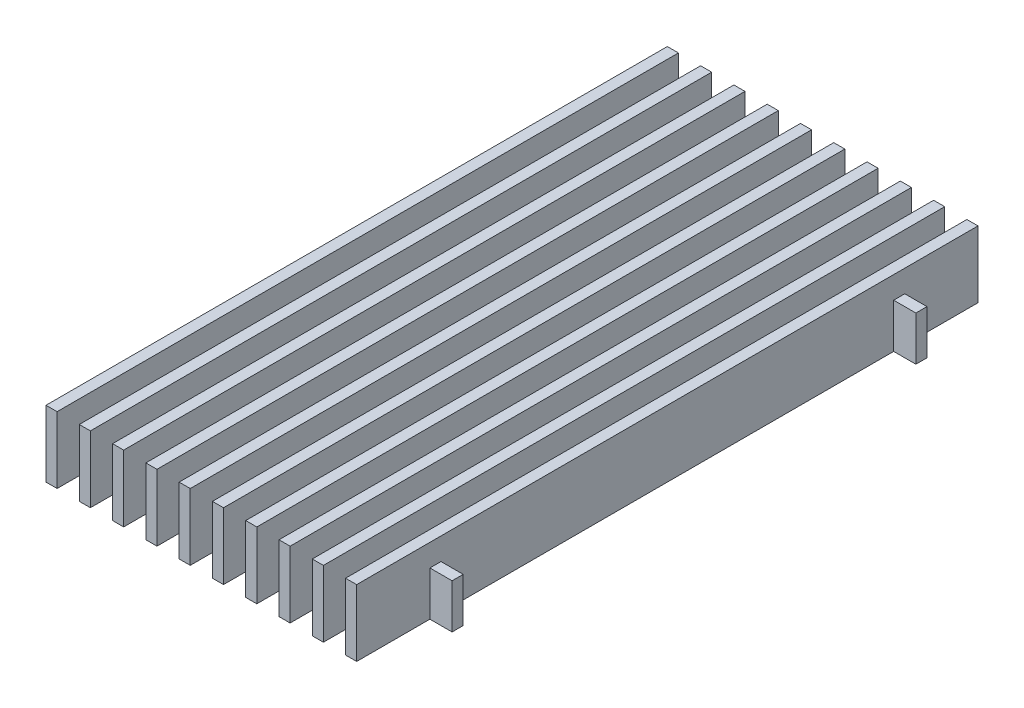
ISO-10303-21;
HEADER;
FILE_DESCRIPTION(('STEP AP214'),'2;1');
FILE_NAME('part.step','',(''),(''),'','','');
FILE_SCHEMA(('AUTOMOTIVE_DESIGN { 1 0 10303 214 1 1 1 1 }'));
ENDSEC;
DATA;
#1=APPLICATION_CONTEXT('core data for automotive mechanical design processes');
#2=APPLICATION_PROTOCOL_DEFINITION('international standard','automotive_design',2000,#1);
#3=PRODUCT_CONTEXT('',#1,'mechanical');
#4=PRODUCT('Part','Part','',(#3));
#5=PRODUCT_RELATED_PRODUCT_CATEGORY('part','',(#4));
#6=PRODUCT_DEFINITION_FORMATION('','',#4);
#7=PRODUCT_DEFINITION_CONTEXT('part definition',#1,'design');
#8=PRODUCT_DEFINITION('design','',#6,#7);
#9=PRODUCT_DEFINITION_SHAPE('','',#8);
#10=(LENGTH_UNIT() NAMED_UNIT(*) SI_UNIT(.MILLI.,.METRE.));
#11=(NAMED_UNIT(*) PLANE_ANGLE_UNIT() SI_UNIT($,.RADIAN.));
#12=(NAMED_UNIT(*) SI_UNIT($,.STERADIAN.) SOLID_ANGLE_UNIT());
#13=UNCERTAINTY_MEASURE_WITH_UNIT(LENGTH_MEASURE(1.E-05),#10,'distance_accuracy_value','');
#14=(GEOMETRIC_REPRESENTATION_CONTEXT(3) GLOBAL_UNCERTAINTY_ASSIGNED_CONTEXT((#13)) GLOBAL_UNIT_ASSIGNED_CONTEXT((#10,
#11,#12)) REPRESENTATION_CONTEXT('',''));
#15=CARTESIAN_POINT('',(0.,0.,0.));
#16=DIRECTION('',(0.,0.,1.));
#17=DIRECTION('',(1.,0.,0.));
#18=AXIS2_PLACEMENT_3D('',#15,#16,#17);
#19=CARTESIAN_POINT('',(-1.5875,-9.525,-177.8));
#20=DIRECTION('',(-1.,0.,0.));
#21=DIRECTION('',(0.,0.,1.));
#22=AXIS2_PLACEMENT_3D('',#19,#20,#21);
#23=PLANE('',#22);
#24=DIRECTION('',(0.,0.,1.));
#25=VECTOR('',#24,1.);
#26=CARTESIAN_POINT('',(-1.5875,3.17499999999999,-177.8));
#27=LINE('',#26,#25);
#28=CARTESIAN_POINT('',(-1.5875,3.17500000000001,-24.13));
#29=VERTEX_POINT('',#28);
#30=CARTESIAN_POINT('',(-1.5875,3.17500000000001,-20.955));
#31=VERTEX_POINT('',#30);
#32=EDGE_CURVE('E1007',#29,#31,#27,.T.);
#33=ORIENTED_EDGE('',*,*,#32,.T.);
#34=DIRECTION('',(0.,-1.,0.));
#35=VECTOR('',#34,1.);
#36=CARTESIAN_POINT('',(-1.5875,-9.525,-20.955));
#37=LINE('',#36,#35);
#38=CARTESIAN_POINT('',(-1.5875,-9.52499999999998,-20.955));
#39=VERTEX_POINT('',#38);
#40=EDGE_CURVE('E942',#31,#39,#37,.T.);
#41=ORIENTED_EDGE('',*,*,#40,.T.);
#42=DIRECTION('',(0.,0.,1.));
#43=VECTOR('',#42,1.);
#44=CARTESIAN_POINT('',(-1.5875,-9.525,-177.8));
#45=LINE('',#44,#43);
#46=CARTESIAN_POINT('',(-1.5875,-9.525,0.));
#47=VERTEX_POINT('',#46);
#48=EDGE_CURVE('E842',#39,#47,#45,.T.);
#49=ORIENTED_EDGE('',*,*,#48,.T.);
#50=DIRECTION('',(0.,-1.,0.));
#51=VECTOR('',#50,1.);
#52=CARTESIAN_POINT('',(-1.5875,-9.525,0.));
#53=LINE('',#52,#51);
#54=CARTESIAN_POINT('',(-1.5875,9.525,0.));
#55=VERTEX_POINT('',#54);
#56=EDGE_CURVE('E1541',#55,#47,#53,.T.);
#57=ORIENTED_EDGE('',*,*,#56,.F.);
#58=DIRECTION('',(0.,0.,1.));
#59=VECTOR('',#58,1.);
#60=CARTESIAN_POINT('',(-1.5875,9.525,-177.8));
#61=LINE('',#60,#59);
#62=CARTESIAN_POINT('',(-1.5875,9.525,-177.8));
#63=VERTEX_POINT('',#62);
#64=EDGE_CURVE('E1565',#63,#55,#61,.T.);
#65=ORIENTED_EDGE('',*,*,#64,.F.);
#66=DIRECTION('',(0.,-1.,0.));
#67=VECTOR('',#66,1.);
#68=CARTESIAN_POINT('',(-1.5875,-9.525,-177.8));
#69=LINE('',#68,#67);
#70=CARTESIAN_POINT('',(-1.5875,-9.525,-177.8));
#71=VERTEX_POINT('',#70);
#72=EDGE_CURVE('E1542',#63,#71,#69,.T.);
#73=ORIENTED_EDGE('',*,*,#72,.T.);
#74=CARTESIAN_POINT('',(-1.5875,-9.525,-156.845));
#75=VERTEX_POINT('',#74);
#76=EDGE_CURVE('E1575',#71,#75,#45,.T.);
#77=ORIENTED_EDGE('',*,*,#76,.T.);
#78=DIRECTION('',(0.,1.,0.));
#79=VECTOR('',#78,1.);
#80=CARTESIAN_POINT('',(-1.5875,-9.525,-156.845));
#81=LINE('',#80,#79);
#82=CARTESIAN_POINT('',(-1.5875,3.17499999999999,-156.845));
#83=VERTEX_POINT('',#82);
#84=EDGE_CURVE('E1535',#75,#83,#81,.T.);
#85=ORIENTED_EDGE('',*,*,#84,.T.);
#86=DIRECTION('',(0.,0.,1.));
#87=VECTOR('',#86,1.);
#88=CARTESIAN_POINT('',(-1.5875,3.17499999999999,-177.8));
#89=LINE('',#88,#87);
#90=CARTESIAN_POINT('',(-1.5875,3.17499999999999,-153.67));
#91=VERTEX_POINT('',#90);
#92=EDGE_CURVE('E1538',#83,#91,#89,.T.);
#93=ORIENTED_EDGE('',*,*,#92,.T.);
#94=DIRECTION('',(0.,-1.,0.));
#95=VECTOR('',#94,1.);
#96=CARTESIAN_POINT('',(-1.5875,-9.525,-153.67));
#97=LINE('',#96,#95);
#98=CARTESIAN_POINT('',(-1.5875,-9.525,-153.67));
#99=VERTEX_POINT('',#98);
#100=EDGE_CURVE('E1529',#91,#99,#97,.T.);
#101=ORIENTED_EDGE('',*,*,#100,.T.);
#102=CARTESIAN_POINT('',(-1.5875,-9.52499999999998,-24.13));
#103=VERTEX_POINT('',#102);
#104=EDGE_CURVE('E1578',#99,#103,#45,.T.);
#105=ORIENTED_EDGE('',*,*,#104,.T.);
#106=DIRECTION('',(0.,1.,0.));
#107=VECTOR('',#106,1.);
#108=CARTESIAN_POINT('',(-1.5875,-9.525,-24.13));
#109=LINE('',#108,#107);
#110=EDGE_CURVE('E1063',#103,#29,#109,.T.);
#111=ORIENTED_EDGE('',*,*,#110,.T.);
#112=EDGE_LOOP('',(#33,#41,#49,#57,#65,#73,#77,#85,#93,#101,#105,#111));
#113=FACE_BOUND('',#112,.T.);
#114=ADVANCED_FACE('F32',(#113),#23,.T.);
#115=CARTESIAN_POINT('',(1.5875,-9.525,-177.8));
#116=DIRECTION('',(1.,0.,0.));
#117=DIRECTION('',(0.,0.,-1.));
#118=AXIS2_PLACEMENT_3D('',#115,#116,#117);
#119=PLANE('',#118);
#120=DIRECTION('',(0.,0.,1.));
#121=VECTOR('',#120,1.);
#122=CARTESIAN_POINT('',(1.5875,-9.525,-177.8));
#123=LINE('',#122,#121);
#124=CARTESIAN_POINT('',(1.5875,-9.52499999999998,-20.955));
#125=VERTEX_POINT('',#124);
#126=CARTESIAN_POINT('',(1.5875,-9.525,0.));
#127=VERTEX_POINT('',#126);
#128=EDGE_CURVE('E1574',#125,#127,#123,.T.);
#129=ORIENTED_EDGE('',*,*,#128,.F.);
#130=DIRECTION('',(0.,1.,0.));
#131=VECTOR('',#130,1.);
#132=CARTESIAN_POINT('',(1.5875,-9.525,-20.955));
#133=LINE('',#132,#131);
#134=CARTESIAN_POINT('',(1.5875,3.17500000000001,-20.955));
#135=VERTEX_POINT('',#134);
#136=EDGE_CURVE('E953',#125,#135,#133,.T.);
#137=ORIENTED_EDGE('',*,*,#136,.T.);
#138=DIRECTION('',(0.,0.,-1.));
#139=VECTOR('',#138,1.);
#140=CARTESIAN_POINT('',(1.5875,3.17499999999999,-177.8));
#141=LINE('',#140,#139);
#142=CARTESIAN_POINT('',(1.5875,3.17500000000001,-24.13));
#143=VERTEX_POINT('',#142);
#144=EDGE_CURVE('E1009',#135,#143,#141,.T.);
#145=ORIENTED_EDGE('',*,*,#144,.T.);
#146=DIRECTION('',(0.,-1.,0.));
#147=VECTOR('',#146,1.);
#148=CARTESIAN_POINT('',(1.5875,-9.525,-24.13));
#149=LINE('',#148,#147);
#150=CARTESIAN_POINT('',(1.5875,-9.525,-24.13));
#151=VERTEX_POINT('',#150);
#152=EDGE_CURVE('E1066',#143,#151,#149,.T.);
#153=ORIENTED_EDGE('',*,*,#152,.T.);
#154=CARTESIAN_POINT('',(1.5875,-9.525,-153.67));
#155=VERTEX_POINT('',#154);
#156=EDGE_CURVE('E1573',#155,#151,#123,.T.);
#157=ORIENTED_EDGE('',*,*,#156,.F.);
#158=DIRECTION('',(0.,1.,0.));
#159=VECTOR('',#158,1.);
#160=CARTESIAN_POINT('',(1.5875,-9.525,-153.67));
#161=LINE('',#160,#159);
#162=CARTESIAN_POINT('',(1.5875,3.17499999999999,-153.67));
#163=VERTEX_POINT('',#162);
#164=EDGE_CURVE('E1525',#155,#163,#161,.T.);
#165=ORIENTED_EDGE('',*,*,#164,.T.);
#166=DIRECTION('',(0.,0.,-1.));
#167=VECTOR('',#166,1.);
#168=CARTESIAN_POINT('',(1.5875,3.17499999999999,-177.8));
#169=LINE('',#168,#167);
#170=CARTESIAN_POINT('',(1.5875,3.17499999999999,-156.845));
#171=VERTEX_POINT('',#170);
#172=EDGE_CURVE('E1567',#163,#171,#169,.T.);
#173=ORIENTED_EDGE('',*,*,#172,.T.);
#174=DIRECTION('',(0.,-1.,0.));
#175=VECTOR('',#174,1.);
#176=CARTESIAN_POINT('',(1.5875,-9.525,-156.845));
#177=LINE('',#176,#175);
#178=CARTESIAN_POINT('',(1.5875,-9.525,-156.845));
#179=VERTEX_POINT('',#178);
#180=EDGE_CURVE('E1532',#171,#179,#177,.T.);
#181=ORIENTED_EDGE('',*,*,#180,.T.);
#182=CARTESIAN_POINT('',(1.5875,-9.525,-177.8));
#183=VERTEX_POINT('',#182);
#184=EDGE_CURVE('E1570',#183,#179,#123,.T.);
#185=ORIENTED_EDGE('',*,*,#184,.F.);
#186=DIRECTION('',(0.,1.,0.));
#187=VECTOR('',#186,1.);
#188=CARTESIAN_POINT('',(1.5875,-9.525,-177.8));
#189=LINE('',#188,#187);
#190=CARTESIAN_POINT('',(1.5875,9.525,-177.8));
#191=VERTEX_POINT('',#190);
#192=EDGE_CURVE('E1549',#183,#191,#189,.T.);
#193=ORIENTED_EDGE('',*,*,#192,.T.);
#194=DIRECTION('',(0.,0.,1.));
#195=VECTOR('',#194,1.);
#196=CARTESIAN_POINT('',(1.5875,9.525,-177.8));
#197=LINE('',#196,#195);
#198=CARTESIAN_POINT('',(1.5875,9.525,0.));
#199=VERTEX_POINT('',#198);
#200=EDGE_CURVE('E1568',#191,#199,#197,.T.);
#201=ORIENTED_EDGE('',*,*,#200,.T.);
#202=DIRECTION('',(0.,1.,0.));
#203=VECTOR('',#202,1.);
#204=CARTESIAN_POINT('',(1.5875,-9.525,0.));
#205=LINE('',#204,#203);
#206=EDGE_CURVE('E1560',#127,#199,#205,.T.);
#207=ORIENTED_EDGE('',*,*,#206,.F.);
#208=EDGE_LOOP('',(#129,#137,#145,#153,#157,#165,#173,#181,#185,#193,#201,#207));
#209=FACE_BOUND('',#208,.T.);
#210=ADVANCED_FACE('F1658',(#209),#119,.T.);
#211=CARTESIAN_POINT('',(7.9375,-9.525,-177.8));
#212=DIRECTION('',(-1.,0.,0.));
#213=DIRECTION('',(0.,0.,1.));
#214=AXIS2_PLACEMENT_3D('',#211,#212,#213);
#215=PLANE('',#214);
#216=DIRECTION('',(0.,0.,1.));
#217=VECTOR('',#216,1.);
#218=CARTESIAN_POINT('',(7.9375,3.17499999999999,-177.8));
#219=LINE('',#218,#217);
#220=CARTESIAN_POINT('',(7.9375,3.17500000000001,-24.13));
#221=VERTEX_POINT('',#220);
#222=CARTESIAN_POINT('',(7.9375,3.17500000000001,-20.955));
#223=VERTEX_POINT('',#222);
#224=EDGE_CURVE('E1012',#221,#223,#219,.T.);
#225=ORIENTED_EDGE('',*,*,#224,.T.);
#226=DIRECTION('',(0.,-1.,0.));
#227=VECTOR('',#226,1.);
#228=CARTESIAN_POINT('',(7.9375,-9.525,-20.955));
#229=LINE('',#228,#227);
#230=CARTESIAN_POINT('',(7.9375,-9.52499999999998,-20.955));
#231=VERTEX_POINT('',#230);
#232=EDGE_CURVE('E956',#223,#231,#229,.T.);
#233=ORIENTED_EDGE('',*,*,#232,.T.);
#234=DIRECTION('',(0.,0.,1.));
#235=VECTOR('',#234,1.);
#236=CARTESIAN_POINT('',(7.9375,-9.525,-177.8));
#237=LINE('',#236,#235);
#238=CARTESIAN_POINT('',(7.9375,-9.525,0.));
#239=VERTEX_POINT('',#238);
#240=EDGE_CURVE('E1453',#231,#239,#237,.T.);
#241=ORIENTED_EDGE('',*,*,#240,.T.);
#242=DIRECTION('',(0.,-1.,0.));
#243=VECTOR('',#242,1.);
#244=CARTESIAN_POINT('',(7.9375,-9.525,0.));
#245=LINE('',#244,#243);
#246=CARTESIAN_POINT('',(7.9375,9.525,0.));
#247=VERTEX_POINT('',#246);
#248=EDGE_CURVE('E1439',#247,#239,#245,.T.);
#249=ORIENTED_EDGE('',*,*,#248,.F.);
#250=DIRECTION('',(0.,0.,1.));
#251=VECTOR('',#250,1.);
#252=CARTESIAN_POINT('',(7.9375,9.525,-177.8));
#253=LINE('',#252,#251);
#254=CARTESIAN_POINT('',(7.9375,9.525,-177.8));
#255=VERTEX_POINT('',#254);
#256=EDGE_CURVE('E1464',#255,#247,#253,.T.);
#257=ORIENTED_EDGE('',*,*,#256,.F.);
#258=DIRECTION('',(0.,-1.,0.));
#259=VECTOR('',#258,1.);
#260=CARTESIAN_POINT('',(7.9375,-9.525,-177.8));
#261=LINE('',#260,#259);
#262=CARTESIAN_POINT('',(7.9375,-9.525,-177.8));
#263=VERTEX_POINT('',#262);
#264=EDGE_CURVE('E1440',#255,#263,#261,.T.);
#265=ORIENTED_EDGE('',*,*,#264,.T.);
#266=CARTESIAN_POINT('',(7.9375,-9.525,-156.845));
#267=VERTEX_POINT('',#266);
#268=EDGE_CURVE('E1473',#263,#267,#237,.T.);
#269=ORIENTED_EDGE('',*,*,#268,.T.);
#270=DIRECTION('',(0.,-1.,0.));
#271=VECTOR('',#270,1.);
#272=CARTESIAN_POINT('',(7.9375,-9.525,-156.845));
#273=LINE('',#272,#271);
#274=CARTESIAN_POINT('',(7.9375,3.17499999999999,-156.845));
#275=VERTEX_POINT('',#274);
#276=EDGE_CURVE('E1584',#275,#267,#273,.T.);
#277=ORIENTED_EDGE('',*,*,#276,.F.);
#278=DIRECTION('',(0.,0.,-1.));
#279=VECTOR('',#278,1.);
#280=CARTESIAN_POINT('',(7.9375,3.17499999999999,-156.845));
#281=LINE('',#280,#279);
#282=CARTESIAN_POINT('',(7.9375,3.17499999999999,-153.67));
#283=VERTEX_POINT('',#282);
#284=EDGE_CURVE('E1481',#283,#275,#281,.T.);
#285=ORIENTED_EDGE('',*,*,#284,.F.);
#286=DIRECTION('',(0.,1.,0.));
#287=VECTOR('',#286,1.);
#288=CARTESIAN_POINT('',(7.9375,-9.525,-153.67));
#289=LINE('',#288,#287);
#290=CARTESIAN_POINT('',(7.9375,-9.525,-153.67));
#291=VERTEX_POINT('',#290);
#292=EDGE_CURVE('E1484',#291,#283,#289,.T.);
#293=ORIENTED_EDGE('',*,*,#292,.F.);
#294=CARTESIAN_POINT('',(7.9375,-9.52499999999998,-24.13));
#295=VERTEX_POINT('',#294);
#296=EDGE_CURVE('E1475',#291,#295,#237,.T.);
#297=ORIENTED_EDGE('',*,*,#296,.T.);
#298=DIRECTION('',(0.,1.,0.));
#299=VECTOR('',#298,1.);
#300=CARTESIAN_POINT('',(7.9375,-9.525,-24.13));
#301=LINE('',#300,#299);
#302=EDGE_CURVE('E1068',#295,#221,#301,.T.);
#303=ORIENTED_EDGE('',*,*,#302,.T.);
#304=EDGE_LOOP('',(#225,#233,#241,#249,#257,#265,#269,#277,#285,#293,#297,#303));
#305=FACE_BOUND('',#304,.T.);
#306=ADVANCED_FACE('F1663',(#305),#215,.T.);
#307=CARTESIAN_POINT('',(11.1125,-9.525,-177.8));
#308=DIRECTION('',(1.,0.,0.));
#309=DIRECTION('',(0.,0.,-1.));
#310=AXIS2_PLACEMENT_3D('',#307,#308,#309);
#311=PLANE('',#310);
#312=DIRECTION('',(0.,0.,1.));
#313=VECTOR('',#312,1.);
#314=CARTESIAN_POINT('',(11.1125,-9.525,-177.8));
#315=LINE('',#314,#313);
#316=CARTESIAN_POINT('',(11.1125,-9.52499999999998,-20.955));
#317=VERTEX_POINT('',#316);
#318=CARTESIAN_POINT('',(11.1125,-9.525,0.));
#319=VERTEX_POINT('',#318);
#320=EDGE_CURVE('E1472',#317,#319,#315,.T.);
#321=ORIENTED_EDGE('',*,*,#320,.F.);
#322=DIRECTION('',(0.,1.,0.));
#323=VECTOR('',#322,1.);
#324=CARTESIAN_POINT('',(11.1125,-9.525,-20.955));
#325=LINE('',#324,#323);
#326=CARTESIAN_POINT('',(11.1125,3.17500000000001,-20.955));
#327=VERTEX_POINT('',#326);
#328=EDGE_CURVE('E959',#317,#327,#325,.T.);
#329=ORIENTED_EDGE('',*,*,#328,.T.);
#330=DIRECTION('',(0.,0.,-1.));
#331=VECTOR('',#330,1.);
#332=CARTESIAN_POINT('',(11.1125,3.17499999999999,-177.8));
#333=LINE('',#332,#331);
#334=CARTESIAN_POINT('',(11.1125,3.17500000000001,-24.13));
#335=VERTEX_POINT('',#334);
#336=EDGE_CURVE('E1015',#327,#335,#333,.T.);
#337=ORIENTED_EDGE('',*,*,#336,.T.);
#338=DIRECTION('',(0.,-1.,0.));
#339=VECTOR('',#338,1.);
#340=CARTESIAN_POINT('',(11.1125,-9.525,-24.13));
#341=LINE('',#340,#339);
#342=CARTESIAN_POINT('',(11.1125,-9.525,-24.13));
#343=VERTEX_POINT('',#342);
#344=EDGE_CURVE('E1071',#335,#343,#341,.T.);
#345=ORIENTED_EDGE('',*,*,#344,.T.);
#346=CARTESIAN_POINT('',(11.1125,-9.525,-153.67));
#347=VERTEX_POINT('',#346);
#348=EDGE_CURVE('E1471',#347,#343,#315,.T.);
#349=ORIENTED_EDGE('',*,*,#348,.F.);
#350=DIRECTION('',(0.,-1.,0.));
#351=VECTOR('',#350,1.);
#352=CARTESIAN_POINT('',(11.1125,-9.525,-153.67));
#353=LINE('',#352,#351);
#354=CARTESIAN_POINT('',(11.1125,3.17499999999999,-153.67));
#355=VERTEX_POINT('',#354);
#356=EDGE_CURVE('E1478',#355,#347,#353,.T.);
#357=ORIENTED_EDGE('',*,*,#356,.F.);
#358=DIRECTION('',(0.,0.,1.));
#359=VECTOR('',#358,1.);
#360=CARTESIAN_POINT('',(11.1125,3.17499999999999,-156.845));
#361=LINE('',#360,#359);
#362=CARTESIAN_POINT('',(11.1125,3.17499999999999,-156.845));
#363=VERTEX_POINT('',#362);
#364=EDGE_CURVE('E1466',#363,#355,#361,.T.);
#365=ORIENTED_EDGE('',*,*,#364,.F.);
#366=DIRECTION('',(0.,1.,0.));
#367=VECTOR('',#366,1.);
#368=CARTESIAN_POINT('',(11.1125,-9.525,-156.845));
#369=LINE('',#368,#367);
#370=CARTESIAN_POINT('',(11.1125,-9.525,-156.845));
#371=VERTEX_POINT('',#370);
#372=EDGE_CURVE('E1581',#371,#363,#369,.T.);
#373=ORIENTED_EDGE('',*,*,#372,.F.);
#374=CARTESIAN_POINT('',(11.1125,-9.525,-177.8));
#375=VERTEX_POINT('',#374);
#376=EDGE_CURVE('E1469',#375,#371,#315,.T.);
#377=ORIENTED_EDGE('',*,*,#376,.F.);
#378=DIRECTION('',(0.,1.,0.));
#379=VECTOR('',#378,1.);
#380=CARTESIAN_POINT('',(11.1125,-9.525,-177.8));
#381=LINE('',#380,#379);
#382=CARTESIAN_POINT('',(11.1125,9.525,-177.8));
#383=VERTEX_POINT('',#382);
#384=EDGE_CURVE('E1447',#375,#383,#381,.T.);
#385=ORIENTED_EDGE('',*,*,#384,.T.);
#386=DIRECTION('',(0.,0.,1.));
#387=VECTOR('',#386,1.);
#388=CARTESIAN_POINT('',(11.1125,9.525,-177.8));
#389=LINE('',#388,#387);
#390=CARTESIAN_POINT('',(11.1125,9.525,0.));
#391=VERTEX_POINT('',#390);
#392=EDGE_CURVE('E1467',#383,#391,#389,.T.);
#393=ORIENTED_EDGE('',*,*,#392,.T.);
#394=DIRECTION('',(0.,1.,0.));
#395=VECTOR('',#394,1.);
#396=CARTESIAN_POINT('',(11.1125,-9.525,0.));
#397=LINE('',#396,#395);
#398=EDGE_CURVE('E1459',#319,#391,#397,.T.);
#399=ORIENTED_EDGE('',*,*,#398,.F.);
#400=EDGE_LOOP('',(#321,#329,#337,#345,#349,#357,#365,#373,#377,#385,#393,#399));
#401=FACE_BOUND('',#400,.T.);
#402=ADVANCED_FACE('F1844',(#401),#311,.T.);
#403=CARTESIAN_POINT('',(17.4625,-9.525,-177.8));
#404=DIRECTION('',(-1.,0.,0.));
#405=DIRECTION('',(0.,0.,1.));
#406=AXIS2_PLACEMENT_3D('',#403,#404,#405);
#407=PLANE('',#406);
#408=DIRECTION('',(0.,0.,1.));
#409=VECTOR('',#408,1.);
#410=CARTESIAN_POINT('',(17.4625,3.17499999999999,-177.8));
#411=LINE('',#410,#409);
#412=CARTESIAN_POINT('',(17.4625,3.17500000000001,-24.13));
#413=VERTEX_POINT('',#412);
#414=CARTESIAN_POINT('',(17.4625,3.17500000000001,-20.955));
#415=VERTEX_POINT('',#414);
#416=EDGE_CURVE('E1018',#413,#415,#411,.T.);
#417=ORIENTED_EDGE('',*,*,#416,.T.);
#418=DIRECTION('',(0.,-1.,0.));
#419=VECTOR('',#418,1.);
#420=CARTESIAN_POINT('',(17.4625,-9.525,-20.955));
#421=LINE('',#420,#419);
#422=CARTESIAN_POINT('',(17.4625,-9.52499999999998,-20.955));
#423=VERTEX_POINT('',#422);
#424=EDGE_CURVE('E962',#415,#423,#421,.T.);
#425=ORIENTED_EDGE('',*,*,#424,.T.);
#426=DIRECTION('',(0.,0.,1.));
#427=VECTOR('',#426,1.);
#428=CARTESIAN_POINT('',(17.4625,-9.525,-177.8));
#429=LINE('',#428,#427);
#430=CARTESIAN_POINT('',(17.4625,-9.525,0.));
#431=VERTEX_POINT('',#430);
#432=EDGE_CURVE('E1405',#423,#431,#429,.T.);
#433=ORIENTED_EDGE('',*,*,#432,.T.);
#434=DIRECTION('',(0.,-1.,0.));
#435=VECTOR('',#434,1.);
#436=CARTESIAN_POINT('',(17.4625,-9.525,0.));
#437=LINE('',#436,#435);
#438=CARTESIAN_POINT('',(17.4625,9.525,0.));
#439=VERTEX_POINT('',#438);
#440=EDGE_CURVE('E1391',#439,#431,#437,.T.);
#441=ORIENTED_EDGE('',*,*,#440,.F.);
#442=DIRECTION('',(0.,0.,1.));
#443=VECTOR('',#442,1.);
#444=CARTESIAN_POINT('',(17.4625,9.525,-177.8));
#445=LINE('',#444,#443);
#446=CARTESIAN_POINT('',(17.4625,9.525,-177.8));
#447=VERTEX_POINT('',#446);
#448=EDGE_CURVE('E1416',#447,#439,#445,.T.);
#449=ORIENTED_EDGE('',*,*,#448,.F.);
#450=DIRECTION('',(0.,-1.,0.));
#451=VECTOR('',#450,1.);
#452=CARTESIAN_POINT('',(17.4625,-9.525,-177.8));
#453=LINE('',#452,#451);
#454=CARTESIAN_POINT('',(17.4625,-9.525,-177.8));
#455=VERTEX_POINT('',#454);
#456=EDGE_CURVE('E1392',#447,#455,#453,.T.);
#457=ORIENTED_EDGE('',*,*,#456,.T.);
#458=CARTESIAN_POINT('',(17.4625,-9.525,-156.845));
#459=VERTEX_POINT('',#458);
#460=EDGE_CURVE('E1425',#455,#459,#429,.T.);
#461=ORIENTED_EDGE('',*,*,#460,.T.);
#462=DIRECTION('',(0.,-1.,0.));
#463=VECTOR('',#462,1.);
#464=CARTESIAN_POINT('',(17.4625,-9.525,-156.845));
#465=LINE('',#464,#463);
#466=CARTESIAN_POINT('',(17.4625,3.17499999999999,-156.845));
#467=VERTEX_POINT('',#466);
#468=EDGE_CURVE('E1590',#467,#459,#465,.T.);
#469=ORIENTED_EDGE('',*,*,#468,.F.);
#470=DIRECTION('',(0.,0.,-1.));
#471=VECTOR('',#470,1.);
#472=CARTESIAN_POINT('',(17.4625,3.17499999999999,-156.845));
#473=LINE('',#472,#471);
#474=CARTESIAN_POINT('',(17.4625,3.17499999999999,-153.67));
#475=VERTEX_POINT('',#474);
#476=EDGE_CURVE('E1433',#475,#467,#473,.T.);
#477=ORIENTED_EDGE('',*,*,#476,.F.);
#478=DIRECTION('',(0.,1.,0.));
#479=VECTOR('',#478,1.);
#480=CARTESIAN_POINT('',(17.4625,-9.525,-153.67));
#481=LINE('',#480,#479);
#482=CARTESIAN_POINT('',(17.4625,-9.525,-153.67));
#483=VERTEX_POINT('',#482);
#484=EDGE_CURVE('E1436',#483,#475,#481,.T.);
#485=ORIENTED_EDGE('',*,*,#484,.F.);
#486=CARTESIAN_POINT('',(17.4625,-9.52499999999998,-24.13));
#487=VERTEX_POINT('',#486);
#488=EDGE_CURVE('E1427',#483,#487,#429,.T.);
#489=ORIENTED_EDGE('',*,*,#488,.T.);
#490=DIRECTION('',(0.,1.,0.));
#491=VECTOR('',#490,1.);
#492=CARTESIAN_POINT('',(17.4625,-9.525,-24.13));
#493=LINE('',#492,#491);
#494=EDGE_CURVE('E1074',#487,#413,#493,.T.);
#495=ORIENTED_EDGE('',*,*,#494,.T.);
#496=EDGE_LOOP('',(#417,#425,#433,#441,#449,#457,#461,#469,#477,#485,#489,#495));
#497=FACE_BOUND('',#496,.T.);
#498=ADVANCED_FACE('F1840',(#497),#407,.T.);
#499=CARTESIAN_POINT('',(20.6375,-9.525,-177.8));
#500=DIRECTION('',(1.,0.,0.));
#501=DIRECTION('',(0.,0.,-1.));
#502=AXIS2_PLACEMENT_3D('',#499,#500,#501);
#503=PLANE('',#502);
#504=DIRECTION('',(0.,0.,1.));
#505=VECTOR('',#504,1.);
#506=CARTESIAN_POINT('',(20.6375,-9.525,-177.8));
#507=LINE('',#506,#505);
#508=CARTESIAN_POINT('',(20.6375,-9.52499999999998,-20.955));
#509=VERTEX_POINT('',#508);
#510=CARTESIAN_POINT('',(20.6375,-9.525,0.));
#511=VERTEX_POINT('',#510);
#512=EDGE_CURVE('E1424',#509,#511,#507,.T.);
#513=ORIENTED_EDGE('',*,*,#512,.F.);
#514=DIRECTION('',(0.,1.,0.));
#515=VECTOR('',#514,1.);
#516=CARTESIAN_POINT('',(20.6375,-9.525,-20.955));
#517=LINE('',#516,#515);
#518=CARTESIAN_POINT('',(20.6375,3.17500000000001,-20.955));
#519=VERTEX_POINT('',#518);
#520=EDGE_CURVE('E965',#509,#519,#517,.T.);
#521=ORIENTED_EDGE('',*,*,#520,.T.);
#522=DIRECTION('',(0.,0.,-1.));
#523=VECTOR('',#522,1.);
#524=CARTESIAN_POINT('',(20.6375,3.17499999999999,-177.8));
#525=LINE('',#524,#523);
#526=CARTESIAN_POINT('',(20.6375,3.17500000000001,-24.13));
#527=VERTEX_POINT('',#526);
#528=EDGE_CURVE('E1021',#519,#527,#525,.T.);
#529=ORIENTED_EDGE('',*,*,#528,.T.);
#530=DIRECTION('',(0.,-1.,0.));
#531=VECTOR('',#530,1.);
#532=CARTESIAN_POINT('',(20.6375,-9.525,-24.13));
#533=LINE('',#532,#531);
#534=CARTESIAN_POINT('',(20.6375,-9.525,-24.13));
#535=VERTEX_POINT('',#534);
#536=EDGE_CURVE('E1077',#527,#535,#533,.T.);
#537=ORIENTED_EDGE('',*,*,#536,.T.);
#538=CARTESIAN_POINT('',(20.6375,-9.525,-153.67));
#539=VERTEX_POINT('',#538);
#540=EDGE_CURVE('E1423',#539,#535,#507,.T.);
#541=ORIENTED_EDGE('',*,*,#540,.F.);
#542=DIRECTION('',(0.,-1.,0.));
#543=VECTOR('',#542,1.);
#544=CARTESIAN_POINT('',(20.6375,-9.525,-153.67));
#545=LINE('',#544,#543);
#546=CARTESIAN_POINT('',(20.6375,3.17499999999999,-153.67));
#547=VERTEX_POINT('',#546);
#548=EDGE_CURVE('E1430',#547,#539,#545,.T.);
#549=ORIENTED_EDGE('',*,*,#548,.F.);
#550=DIRECTION('',(0.,0.,1.));
#551=VECTOR('',#550,1.);
#552=CARTESIAN_POINT('',(20.6375,3.17499999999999,-156.845));
#553=LINE('',#552,#551);
#554=CARTESIAN_POINT('',(20.6375,3.17499999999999,-156.845));
#555=VERTEX_POINT('',#554);
#556=EDGE_CURVE('E1418',#555,#547,#553,.T.);
#557=ORIENTED_EDGE('',*,*,#556,.F.);
#558=DIRECTION('',(0.,1.,0.));
#559=VECTOR('',#558,1.);
#560=CARTESIAN_POINT('',(20.6375,-9.525,-156.845));
#561=LINE('',#560,#559);
#562=CARTESIAN_POINT('',(20.6375,-9.525,-156.845));
#563=VERTEX_POINT('',#562);
#564=EDGE_CURVE('E1587',#563,#555,#561,.T.);
#565=ORIENTED_EDGE('',*,*,#564,.F.);
#566=CARTESIAN_POINT('',(20.6375,-9.525,-177.8));
#567=VERTEX_POINT('',#566);
#568=EDGE_CURVE('E1421',#567,#563,#507,.T.);
#569=ORIENTED_EDGE('',*,*,#568,.F.);
#570=DIRECTION('',(0.,1.,0.));
#571=VECTOR('',#570,1.);
#572=CARTESIAN_POINT('',(20.6375,-9.525,-177.8));
#573=LINE('',#572,#571);
#574=CARTESIAN_POINT('',(20.6375,9.525,-177.8));
#575=VERTEX_POINT('',#574);
#576=EDGE_CURVE('E1399',#567,#575,#573,.T.);
#577=ORIENTED_EDGE('',*,*,#576,.T.);
#578=DIRECTION('',(0.,0.,1.));
#579=VECTOR('',#578,1.);
#580=CARTESIAN_POINT('',(20.6375,9.525,-177.8));
#581=LINE('',#580,#579);
#582=CARTESIAN_POINT('',(20.6375,9.525,0.));
#583=VERTEX_POINT('',#582);
#584=EDGE_CURVE('E1419',#575,#583,#581,.T.);
#585=ORIENTED_EDGE('',*,*,#584,.T.);
#586=DIRECTION('',(0.,1.,0.));
#587=VECTOR('',#586,1.);
#588=CARTESIAN_POINT('',(20.6375,-9.525,0.));
#589=LINE('',#588,#587);
#590=EDGE_CURVE('E1411',#511,#583,#589,.T.);
#591=ORIENTED_EDGE('',*,*,#590,.F.);
#592=EDGE_LOOP('',(#513,#521,#529,#537,#541,#549,#557,#565,#569,#577,#585,#591));
#593=FACE_BOUND('',#592,.T.);
#594=ADVANCED_FACE('F1824',(#593),#503,.T.);
#595=CARTESIAN_POINT('',(26.9875,-9.525,-177.8));
#596=DIRECTION('',(-1.,0.,0.));
#597=DIRECTION('',(0.,0.,1.));
#598=AXIS2_PLACEMENT_3D('',#595,#596,#597);
#599=PLANE('',#598);
#600=DIRECTION('',(0.,0.,1.));
#601=VECTOR('',#600,1.);
#602=CARTESIAN_POINT('',(26.9875,3.17499999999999,-177.8));
#603=LINE('',#602,#601);
#604=CARTESIAN_POINT('',(26.9875,3.17500000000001,-24.13));
#605=VERTEX_POINT('',#604);
#606=CARTESIAN_POINT('',(26.9875,3.17500000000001,-20.955));
#607=VERTEX_POINT('',#606);
#608=EDGE_CURVE('E1024',#605,#607,#603,.T.);
#609=ORIENTED_EDGE('',*,*,#608,.T.);
#610=DIRECTION('',(0.,-1.,0.));
#611=VECTOR('',#610,1.);
#612=CARTESIAN_POINT('',(26.9875,-9.525,-20.955));
#613=LINE('',#612,#611);
#614=CARTESIAN_POINT('',(26.9875,-9.52499999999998,-20.955));
#615=VERTEX_POINT('',#614);
#616=EDGE_CURVE('E968',#607,#615,#613,.T.);
#617=ORIENTED_EDGE('',*,*,#616,.T.);
#618=DIRECTION('',(0.,0.,1.));
#619=VECTOR('',#618,1.);
#620=CARTESIAN_POINT('',(26.9875,-9.525,-177.8));
#621=LINE('',#620,#619);
#622=CARTESIAN_POINT('',(26.9875,-9.525,0.));
#623=VERTEX_POINT('',#622);
#624=EDGE_CURVE('E1357',#615,#623,#621,.T.);
#625=ORIENTED_EDGE('',*,*,#624,.T.);
#626=DIRECTION('',(0.,-1.,0.));
#627=VECTOR('',#626,1.);
#628=CARTESIAN_POINT('',(26.9875,-9.525,0.));
#629=LINE('',#628,#627);
#630=CARTESIAN_POINT('',(26.9875,9.525,0.));
#631=VERTEX_POINT('',#630);
#632=EDGE_CURVE('E1343',#631,#623,#629,.T.);
#633=ORIENTED_EDGE('',*,*,#632,.F.);
#634=DIRECTION('',(0.,0.,1.));
#635=VECTOR('',#634,1.);
#636=CARTESIAN_POINT('',(26.9875,9.525,-177.8));
#637=LINE('',#636,#635);
#638=CARTESIAN_POINT('',(26.9875,9.525,-177.8));
#639=VERTEX_POINT('',#638);
#640=EDGE_CURVE('E1368',#639,#631,#637,.T.);
#641=ORIENTED_EDGE('',*,*,#640,.F.);
#642=DIRECTION('',(0.,-1.,0.));
#643=VECTOR('',#642,1.);
#644=CARTESIAN_POINT('',(26.9875,-9.525,-177.8));
#645=LINE('',#644,#643);
#646=CARTESIAN_POINT('',(26.9875,-9.525,-177.8));
#647=VERTEX_POINT('',#646);
#648=EDGE_CURVE('E1344',#639,#647,#645,.T.);
#649=ORIENTED_EDGE('',*,*,#648,.T.);
#650=CARTESIAN_POINT('',(26.9875,-9.525,-156.845));
#651=VERTEX_POINT('',#650);
#652=EDGE_CURVE('E1377',#647,#651,#621,.T.);
#653=ORIENTED_EDGE('',*,*,#652,.T.);
#654=DIRECTION('',(0.,-1.,0.));
#655=VECTOR('',#654,1.);
#656=CARTESIAN_POINT('',(26.9875,-9.525,-156.845));
#657=LINE('',#656,#655);
#658=CARTESIAN_POINT('',(26.9875,3.17499999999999,-156.845));
#659=VERTEX_POINT('',#658);
#660=EDGE_CURVE('E1596',#659,#651,#657,.T.);
#661=ORIENTED_EDGE('',*,*,#660,.F.);
#662=DIRECTION('',(0.,0.,-1.));
#663=VECTOR('',#662,1.);
#664=CARTESIAN_POINT('',(26.9875,3.17499999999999,-156.845));
#665=LINE('',#664,#663);
#666=CARTESIAN_POINT('',(26.9875,3.17499999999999,-153.67));
#667=VERTEX_POINT('',#666);
#668=EDGE_CURVE('E1385',#667,#659,#665,.T.);
#669=ORIENTED_EDGE('',*,*,#668,.F.);
#670=DIRECTION('',(0.,1.,0.));
#671=VECTOR('',#670,1.);
#672=CARTESIAN_POINT('',(26.9875,-9.525,-153.67));
#673=LINE('',#672,#671);
#674=CARTESIAN_POINT('',(26.9875,-9.525,-153.67));
#675=VERTEX_POINT('',#674);
#676=EDGE_CURVE('E1388',#675,#667,#673,.T.);
#677=ORIENTED_EDGE('',*,*,#676,.F.);
#678=CARTESIAN_POINT('',(26.9875,-9.52499999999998,-24.13));
#679=VERTEX_POINT('',#678);
#680=EDGE_CURVE('E1379',#675,#679,#621,.T.);
#681=ORIENTED_EDGE('',*,*,#680,.T.);
#682=DIRECTION('',(0.,1.,0.));
#683=VECTOR('',#682,1.);
#684=CARTESIAN_POINT('',(26.9875,-9.525,-24.13));
#685=LINE('',#684,#683);
#686=EDGE_CURVE('E1080',#679,#605,#685,.T.);
#687=ORIENTED_EDGE('',*,*,#686,.T.);
#688=EDGE_LOOP('',(#609,#617,#625,#633,#641,#649,#653,#661,#669,#677,#681,#687));
#689=FACE_BOUND('',#688,.T.);
#690=ADVANCED_FACE('F1820',(#689),#599,.T.);
#691=CARTESIAN_POINT('',(30.1625,-9.525,-177.8));
#692=DIRECTION('',(1.,0.,0.));
#693=DIRECTION('',(0.,0.,-1.));
#694=AXIS2_PLACEMENT_3D('',#691,#692,#693);
#695=PLANE('',#694);
#696=DIRECTION('',(0.,0.,1.));
#697=VECTOR('',#696,1.);
#698=CARTESIAN_POINT('',(30.1625,-9.525,-177.8));
#699=LINE('',#698,#697);
#700=CARTESIAN_POINT('',(30.1625,-9.52499999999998,-20.955));
#701=VERTEX_POINT('',#700);
#702=CARTESIAN_POINT('',(30.1625,-9.525,0.));
#703=VERTEX_POINT('',#702);
#704=EDGE_CURVE('E1376',#701,#703,#699,.T.);
#705=ORIENTED_EDGE('',*,*,#704,.F.);
#706=DIRECTION('',(0.,1.,0.));
#707=VECTOR('',#706,1.);
#708=CARTESIAN_POINT('',(30.1625,-9.525,-20.955));
#709=LINE('',#708,#707);
#710=CARTESIAN_POINT('',(30.1625,3.17500000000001,-20.955));
#711=VERTEX_POINT('',#710);
#712=EDGE_CURVE('E971',#701,#711,#709,.T.);
#713=ORIENTED_EDGE('',*,*,#712,.T.);
#714=DIRECTION('',(0.,0.,-1.));
#715=VECTOR('',#714,1.);
#716=CARTESIAN_POINT('',(30.1625,3.17499999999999,-177.8));
#717=LINE('',#716,#715);
#718=CARTESIAN_POINT('',(30.1625,3.17500000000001,-24.13));
#719=VERTEX_POINT('',#718);
#720=EDGE_CURVE('E1027',#711,#719,#717,.T.);
#721=ORIENTED_EDGE('',*,*,#720,.T.);
#722=DIRECTION('',(0.,-1.,0.));
#723=VECTOR('',#722,1.);
#724=CARTESIAN_POINT('',(30.1625,-9.525,-24.13));
#725=LINE('',#724,#723);
#726=CARTESIAN_POINT('',(30.1625,-9.525,-24.13));
#727=VERTEX_POINT('',#726);
#728=EDGE_CURVE('E1083',#719,#727,#725,.T.);
#729=ORIENTED_EDGE('',*,*,#728,.T.);
#730=CARTESIAN_POINT('',(30.1625,-9.525,-153.67));
#731=VERTEX_POINT('',#730);
#732=EDGE_CURVE('E1375',#731,#727,#699,.T.);
#733=ORIENTED_EDGE('',*,*,#732,.F.);
#734=DIRECTION('',(0.,-1.,0.));
#735=VECTOR('',#734,1.);
#736=CARTESIAN_POINT('',(30.1625,-9.525,-153.67));
#737=LINE('',#736,#735);
#738=CARTESIAN_POINT('',(30.1625,3.17499999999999,-153.67));
#739=VERTEX_POINT('',#738);
#740=EDGE_CURVE('E1382',#739,#731,#737,.T.);
#741=ORIENTED_EDGE('',*,*,#740,.F.);
#742=DIRECTION('',(0.,0.,1.));
#743=VECTOR('',#742,1.);
#744=CARTESIAN_POINT('',(30.1625,3.17499999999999,-156.845));
#745=LINE('',#744,#743);
#746=CARTESIAN_POINT('',(30.1625,3.17499999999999,-156.845));
#747=VERTEX_POINT('',#746);
#748=EDGE_CURVE('E1370',#747,#739,#745,.T.);
#749=ORIENTED_EDGE('',*,*,#748,.F.);
#750=DIRECTION('',(0.,1.,0.));
#751=VECTOR('',#750,1.);
#752=CARTESIAN_POINT('',(30.1625,-9.525,-156.845));
#753=LINE('',#752,#751);
#754=CARTESIAN_POINT('',(30.1625,-9.525,-156.845));
#755=VERTEX_POINT('',#754);
#756=EDGE_CURVE('E1593',#755,#747,#753,.T.);
#757=ORIENTED_EDGE('',*,*,#756,.F.);
#758=CARTESIAN_POINT('',(30.1625,-9.525,-177.8));
#759=VERTEX_POINT('',#758);
#760=EDGE_CURVE('E1373',#759,#755,#699,.T.);
#761=ORIENTED_EDGE('',*,*,#760,.F.);
#762=DIRECTION('',(0.,1.,0.));
#763=VECTOR('',#762,1.);
#764=CARTESIAN_POINT('',(30.1625,-9.525,-177.8));
#765=LINE('',#764,#763);
#766=CARTESIAN_POINT('',(30.1625,9.525,-177.8));
#767=VERTEX_POINT('',#766);
#768=EDGE_CURVE('E1351',#759,#767,#765,.T.);
#769=ORIENTED_EDGE('',*,*,#768,.T.);
#770=DIRECTION('',(0.,0.,1.));
#771=VECTOR('',#770,1.);
#772=CARTESIAN_POINT('',(30.1625,9.525,-177.8));
#773=LINE('',#772,#771);
#774=CARTESIAN_POINT('',(30.1625,9.525,0.));
#775=VERTEX_POINT('',#774);
#776=EDGE_CURVE('E1371',#767,#775,#773,.T.);
#777=ORIENTED_EDGE('',*,*,#776,.T.);
#778=DIRECTION('',(0.,1.,0.));
#779=VECTOR('',#778,1.);
#780=CARTESIAN_POINT('',(30.1625,-9.525,0.));
#781=LINE('',#780,#779);
#782=EDGE_CURVE('E1363',#703,#775,#781,.T.);
#783=ORIENTED_EDGE('',*,*,#782,.F.);
#784=EDGE_LOOP('',(#705,#713,#721,#729,#733,#741,#749,#757,#761,#769,#777,#783));
#785=FACE_BOUND('',#784,.T.);
#786=ADVANCED_FACE('F1804',(#785),#695,.T.);
#787=CARTESIAN_POINT('',(36.5125,-9.525,-177.8));
#788=DIRECTION('',(-1.,0.,0.));
#789=DIRECTION('',(0.,0.,1.));
#790=AXIS2_PLACEMENT_3D('',#787,#788,#789);
#791=PLANE('',#790);
#792=DIRECTION('',(0.,0.,1.));
#793=VECTOR('',#792,1.);
#794=CARTESIAN_POINT('',(36.5125,3.17499999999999,-177.8));
#795=LINE('',#794,#793);
#796=CARTESIAN_POINT('',(36.5125,3.17500000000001,-24.13));
#797=VERTEX_POINT('',#796);
#798=CARTESIAN_POINT('',(36.5125,3.17500000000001,-20.955));
#799=VERTEX_POINT('',#798);
#800=EDGE_CURVE('E1030',#797,#799,#795,.T.);
#801=ORIENTED_EDGE('',*,*,#800,.T.);
#802=DIRECTION('',(0.,-1.,0.));
#803=VECTOR('',#802,1.);
#804=CARTESIAN_POINT('',(36.5125,-9.525,-20.955));
#805=LINE('',#804,#803);
#806=CARTESIAN_POINT('',(36.5125,-9.52499999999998,-20.955));
#807=VERTEX_POINT('',#806);
#808=EDGE_CURVE('E974',#799,#807,#805,.T.);
#809=ORIENTED_EDGE('',*,*,#808,.T.);
#810=DIRECTION('',(0.,0.,1.));
#811=VECTOR('',#810,1.);
#812=CARTESIAN_POINT('',(36.5125,-9.525,-177.8));
#813=LINE('',#812,#811);
#814=CARTESIAN_POINT('',(36.5125,-9.525,0.));
#815=VERTEX_POINT('',#814);
#816=EDGE_CURVE('E1309',#807,#815,#813,.T.);
#817=ORIENTED_EDGE('',*,*,#816,.T.);
#818=DIRECTION('',(0.,-1.,0.));
#819=VECTOR('',#818,1.);
#820=CARTESIAN_POINT('',(36.5125,-9.525,0.));
#821=LINE('',#820,#819);
#822=CARTESIAN_POINT('',(36.5125,9.525,0.));
#823=VERTEX_POINT('',#822);
#824=EDGE_CURVE('E1295',#823,#815,#821,.T.);
#825=ORIENTED_EDGE('',*,*,#824,.F.);
#826=DIRECTION('',(0.,0.,1.));
#827=VECTOR('',#826,1.);
#828=CARTESIAN_POINT('',(36.5125,9.525,-177.8));
#829=LINE('',#828,#827);
#830=CARTESIAN_POINT('',(36.5125,9.525,-177.8));
#831=VERTEX_POINT('',#830);
#832=EDGE_CURVE('E1320',#831,#823,#829,.T.);
#833=ORIENTED_EDGE('',*,*,#832,.F.);
#834=DIRECTION('',(0.,-1.,0.));
#835=VECTOR('',#834,1.);
#836=CARTESIAN_POINT('',(36.5125,-9.525,-177.8));
#837=LINE('',#836,#835);
#838=CARTESIAN_POINT('',(36.5125,-9.525,-177.8));
#839=VERTEX_POINT('',#838);
#840=EDGE_CURVE('E1296',#831,#839,#837,.T.);
#841=ORIENTED_EDGE('',*,*,#840,.T.);
#842=CARTESIAN_POINT('',(36.5125,-9.525,-156.845));
#843=VERTEX_POINT('',#842);
#844=EDGE_CURVE('E1329',#839,#843,#813,.T.);
#845=ORIENTED_EDGE('',*,*,#844,.T.);
#846=DIRECTION('',(0.,-1.,0.));
#847=VECTOR('',#846,1.);
#848=CARTESIAN_POINT('',(36.5125,-9.525,-156.845));
#849=LINE('',#848,#847);
#850=CARTESIAN_POINT('',(36.5125,3.17499999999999,-156.845));
#851=VERTEX_POINT('',#850);
#852=EDGE_CURVE('E1602',#851,#843,#849,.T.);
#853=ORIENTED_EDGE('',*,*,#852,.F.);
#854=DIRECTION('',(0.,0.,-1.));
#855=VECTOR('',#854,1.);
#856=CARTESIAN_POINT('',(36.5125,3.17499999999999,-156.845));
#857=LINE('',#856,#855);
#858=CARTESIAN_POINT('',(36.5125,3.17499999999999,-153.67));
#859=VERTEX_POINT('',#858);
#860=EDGE_CURVE('E1337',#859,#851,#857,.T.);
#861=ORIENTED_EDGE('',*,*,#860,.F.);
#862=DIRECTION('',(0.,1.,0.));
#863=VECTOR('',#862,1.);
#864=CARTESIAN_POINT('',(36.5125,-9.525,-153.67));
#865=LINE('',#864,#863);
#866=CARTESIAN_POINT('',(36.5125,-9.525,-153.67));
#867=VERTEX_POINT('',#866);
#868=EDGE_CURVE('E1340',#867,#859,#865,.T.);
#869=ORIENTED_EDGE('',*,*,#868,.F.);
#870=CARTESIAN_POINT('',(36.5125,-9.52499999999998,-24.13));
#871=VERTEX_POINT('',#870);
#872=EDGE_CURVE('E1331',#867,#871,#813,.T.);
#873=ORIENTED_EDGE('',*,*,#872,.T.);
#874=DIRECTION('',(0.,1.,0.));
#875=VECTOR('',#874,1.);
#876=CARTESIAN_POINT('',(36.5125,-9.525,-24.13));
#877=LINE('',#876,#875);
#878=EDGE_CURVE('E1086',#871,#797,#877,.T.);
#879=ORIENTED_EDGE('',*,*,#878,.T.);
#880=EDGE_LOOP('',(#801,#809,#817,#825,#833,#841,#845,#853,#861,#869,#873,#879));
#881=FACE_BOUND('',#880,.T.);
#882=ADVANCED_FACE('F1800',(#881),#791,.T.);
#883=CARTESIAN_POINT('',(39.6875,-9.525,-177.8));
#884=DIRECTION('',(1.,0.,0.));
#885=DIRECTION('',(0.,0.,-1.));
#886=AXIS2_PLACEMENT_3D('',#883,#884,#885);
#887=PLANE('',#886);
#888=DIRECTION('',(0.,0.,1.));
#889=VECTOR('',#888,1.);
#890=CARTESIAN_POINT('',(39.6875,-9.525,-177.8));
#891=LINE('',#890,#889);
#892=CARTESIAN_POINT('',(39.6875,-9.52499999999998,-20.955));
#893=VERTEX_POINT('',#892);
#894=CARTESIAN_POINT('',(39.6875,-9.525,0.));
#895=VERTEX_POINT('',#894);
#896=EDGE_CURVE('E1328',#893,#895,#891,.T.);
#897=ORIENTED_EDGE('',*,*,#896,.F.);
#898=DIRECTION('',(0.,1.,0.));
#899=VECTOR('',#898,1.);
#900=CARTESIAN_POINT('',(39.6875,-9.525,-20.955));
#901=LINE('',#900,#899);
#902=CARTESIAN_POINT('',(39.6875,3.17500000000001,-20.955));
#903=VERTEX_POINT('',#902);
#904=EDGE_CURVE('E977',#893,#903,#901,.T.);
#905=ORIENTED_EDGE('',*,*,#904,.T.);
#906=DIRECTION('',(0.,0.,-1.));
#907=VECTOR('',#906,1.);
#908=CARTESIAN_POINT('',(39.6875,3.17499999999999,-177.8));
#909=LINE('',#908,#907);
#910=CARTESIAN_POINT('',(39.6875,3.17500000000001,-24.13));
#911=VERTEX_POINT('',#910);
#912=EDGE_CURVE('E1033',#903,#911,#909,.T.);
#913=ORIENTED_EDGE('',*,*,#912,.T.);
#914=DIRECTION('',(0.,-1.,0.));
#915=VECTOR('',#914,1.);
#916=CARTESIAN_POINT('',(39.6875,-9.525,-24.13));
#917=LINE('',#916,#915);
#918=CARTESIAN_POINT('',(39.6875,-9.525,-24.13));
#919=VERTEX_POINT('',#918);
#920=EDGE_CURVE('E1089',#911,#919,#917,.T.);
#921=ORIENTED_EDGE('',*,*,#920,.T.);
#922=CARTESIAN_POINT('',(39.6875,-9.525,-153.67));
#923=VERTEX_POINT('',#922);
#924=EDGE_CURVE('E1327',#923,#919,#891,.T.);
#925=ORIENTED_EDGE('',*,*,#924,.F.);
#926=DIRECTION('',(0.,-1.,0.));
#927=VECTOR('',#926,1.);
#928=CARTESIAN_POINT('',(39.6875,-9.525,-153.67));
#929=LINE('',#928,#927);
#930=CARTESIAN_POINT('',(39.6875,3.17499999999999,-153.67));
#931=VERTEX_POINT('',#930);
#932=EDGE_CURVE('E1334',#931,#923,#929,.T.);
#933=ORIENTED_EDGE('',*,*,#932,.F.);
#934=DIRECTION('',(0.,0.,1.));
#935=VECTOR('',#934,1.);
#936=CARTESIAN_POINT('',(39.6875,3.17499999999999,-156.845));
#937=LINE('',#936,#935);
#938=CARTESIAN_POINT('',(39.6875,3.17499999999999,-156.845));
#939=VERTEX_POINT('',#938);
#940=EDGE_CURVE('E1322',#939,#931,#937,.T.);
#941=ORIENTED_EDGE('',*,*,#940,.F.);
#942=DIRECTION('',(0.,1.,0.));
#943=VECTOR('',#942,1.);
#944=CARTESIAN_POINT('',(39.6875,-9.525,-156.845));
#945=LINE('',#944,#943);
#946=CARTESIAN_POINT('',(39.6875,-9.525,-156.845));
#947=VERTEX_POINT('',#946);
#948=EDGE_CURVE('E1599',#947,#939,#945,.T.);
#949=ORIENTED_EDGE('',*,*,#948,.F.);
#950=CARTESIAN_POINT('',(39.6875,-9.525,-177.8));
#951=VERTEX_POINT('',#950);
#952=EDGE_CURVE('E1325',#951,#947,#891,.T.);
#953=ORIENTED_EDGE('',*,*,#952,.F.);
#954=DIRECTION('',(0.,1.,0.));
#955=VECTOR('',#954,1.);
#956=CARTESIAN_POINT('',(39.6875,-9.525,-177.8));
#957=LINE('',#956,#955);
#958=CARTESIAN_POINT('',(39.6875,9.525,-177.8));
#959=VERTEX_POINT('',#958);
#960=EDGE_CURVE('E1303',#951,#959,#957,.T.);
#961=ORIENTED_EDGE('',*,*,#960,.T.);
#962=DIRECTION('',(0.,0.,1.));
#963=VECTOR('',#962,1.);
#964=CARTESIAN_POINT('',(39.6875,9.525,-177.8));
#965=LINE('',#964,#963);
#966=CARTESIAN_POINT('',(39.6875,9.525,0.));
#967=VERTEX_POINT('',#966);
#968=EDGE_CURVE('E1323',#959,#967,#965,.T.);
#969=ORIENTED_EDGE('',*,*,#968,.T.);
#970=DIRECTION('',(0.,1.,0.));
#971=VECTOR('',#970,1.);
#972=CARTESIAN_POINT('',(39.6875,-9.525,0.));
#973=LINE('',#972,#971);
#974=EDGE_CURVE('E1315',#895,#967,#973,.T.);
#975=ORIENTED_EDGE('',*,*,#974,.F.);
#976=EDGE_LOOP('',(#897,#905,#913,#921,#925,#933,#941,#949,#953,#961,#969,#975));
#977=FACE_BOUND('',#976,.T.);
#978=ADVANCED_FACE('F1784',(#977),#887,.T.);
#979=CARTESIAN_POINT('',(46.0375,-9.525,-177.8));
#980=DIRECTION('',(-1.,0.,0.));
#981=DIRECTION('',(0.,0.,1.));
#982=AXIS2_PLACEMENT_3D('',#979,#980,#981);
#983=PLANE('',#982);
#984=DIRECTION('',(0.,0.,1.));
#985=VECTOR('',#984,1.);
#986=CARTESIAN_POINT('',(46.0375,3.17499999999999,-177.8));
#987=LINE('',#986,#985);
#988=CARTESIAN_POINT('',(46.0375,3.17500000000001,-24.13));
#989=VERTEX_POINT('',#988);
#990=CARTESIAN_POINT('',(46.0375,3.17500000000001,-20.955));
#991=VERTEX_POINT('',#990);
#992=EDGE_CURVE('E1036',#989,#991,#987,.T.);
#993=ORIENTED_EDGE('',*,*,#992,.T.);
#994=DIRECTION('',(0.,-1.,0.));
#995=VECTOR('',#994,1.);
#996=CARTESIAN_POINT('',(46.0375,-9.525,-20.955));
#997=LINE('',#996,#995);
#998=CARTESIAN_POINT('',(46.0375,-9.52499999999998,-20.955));
#999=VERTEX_POINT('',#998);
#1000=EDGE_CURVE('E980',#991,#999,#997,.T.);
#1001=ORIENTED_EDGE('',*,*,#1000,.T.);
#1002=DIRECTION('',(0.,0.,1.));
#1003=VECTOR('',#1002,1.);
#1004=CARTESIAN_POINT('',(46.0375,-9.525,-177.8));
#1005=LINE('',#1004,#1003);
#1006=CARTESIAN_POINT('',(46.0375,-9.525,0.));
#1007=VERTEX_POINT('',#1006);
#1008=EDGE_CURVE('E1261',#999,#1007,#1005,.T.);
#1009=ORIENTED_EDGE('',*,*,#1008,.T.);
#1010=DIRECTION('',(0.,-1.,0.));
#1011=VECTOR('',#1010,1.);
#1012=CARTESIAN_POINT('',(46.0375,-9.525,0.));
#1013=LINE('',#1012,#1011);
#1014=CARTESIAN_POINT('',(46.0375,9.525,0.));
#1015=VERTEX_POINT('',#1014);
#1016=EDGE_CURVE('E1247',#1015,#1007,#1013,.T.);
#1017=ORIENTED_EDGE('',*,*,#1016,.F.);
#1018=DIRECTION('',(0.,0.,1.));
#1019=VECTOR('',#1018,1.);
#1020=CARTESIAN_POINT('',(46.0375,9.525,-177.8));
#1021=LINE('',#1020,#1019);
#1022=CARTESIAN_POINT('',(46.0375,9.525,-177.8));
#1023=VERTEX_POINT('',#1022);
#1024=EDGE_CURVE('E1272',#1023,#1015,#1021,.T.);
#1025=ORIENTED_EDGE('',*,*,#1024,.F.);
#1026=DIRECTION('',(0.,-1.,0.));
#1027=VECTOR('',#1026,1.);
#1028=CARTESIAN_POINT('',(46.0375,-9.525,-177.8));
#1029=LINE('',#1028,#1027);
#1030=CARTESIAN_POINT('',(46.0375,-9.525,-177.8));
#1031=VERTEX_POINT('',#1030);
#1032=EDGE_CURVE('E1248',#1023,#1031,#1029,.T.);
#1033=ORIENTED_EDGE('',*,*,#1032,.T.);
#1034=CARTESIAN_POINT('',(46.0375,-9.525,-156.845));
#1035=VERTEX_POINT('',#1034);
#1036=EDGE_CURVE('E1281',#1031,#1035,#1005,.T.);
#1037=ORIENTED_EDGE('',*,*,#1036,.T.);
#1038=DIRECTION('',(0.,-1.,0.));
#1039=VECTOR('',#1038,1.);
#1040=CARTESIAN_POINT('',(46.0375,-9.525,-156.845));
#1041=LINE('',#1040,#1039);
#1042=CARTESIAN_POINT('',(46.0375,3.17499999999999,-156.845));
#1043=VERTEX_POINT('',#1042);
#1044=EDGE_CURVE('E1608',#1043,#1035,#1041,.T.);
#1045=ORIENTED_EDGE('',*,*,#1044,.F.);
#1046=DIRECTION('',(0.,0.,-1.));
#1047=VECTOR('',#1046,1.);
#1048=CARTESIAN_POINT('',(46.0375,3.17499999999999,-156.845));
#1049=LINE('',#1048,#1047);
#1050=CARTESIAN_POINT('',(46.0375,3.17499999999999,-153.67));
#1051=VERTEX_POINT('',#1050);
#1052=EDGE_CURVE('E1289',#1051,#1043,#1049,.T.);
#1053=ORIENTED_EDGE('',*,*,#1052,.F.);
#1054=DIRECTION('',(0.,1.,0.));
#1055=VECTOR('',#1054,1.);
#1056=CARTESIAN_POINT('',(46.0375,-9.525,-153.67));
#1057=LINE('',#1056,#1055);
#1058=CARTESIAN_POINT('',(46.0375,-9.525,-153.67));
#1059=VERTEX_POINT('',#1058);
#1060=EDGE_CURVE('E1292',#1059,#1051,#1057,.T.);
#1061=ORIENTED_EDGE('',*,*,#1060,.F.);
#1062=CARTESIAN_POINT('',(46.0375,-9.52499999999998,-24.13));
#1063=VERTEX_POINT('',#1062);
#1064=EDGE_CURVE('E1283',#1059,#1063,#1005,.T.);
#1065=ORIENTED_EDGE('',*,*,#1064,.T.);
#1066=DIRECTION('',(0.,1.,0.));
#1067=VECTOR('',#1066,1.);
#1068=CARTESIAN_POINT('',(46.0375,-9.525,-24.13));
#1069=LINE('',#1068,#1067);
#1070=EDGE_CURVE('E1092',#1063,#989,#1069,.T.);
#1071=ORIENTED_EDGE('',*,*,#1070,.T.);
#1072=EDGE_LOOP('',(#993,#1001,#1009,#1017,#1025,#1033,#1037,#1045,#1053,#1061,#1065,#1071));
#1073=FACE_BOUND('',#1072,.T.);
#1074=ADVANCED_FACE('F1780',(#1073),#983,.T.);
#1075=CARTESIAN_POINT('',(49.2125,-9.525,-177.8));
#1076=DIRECTION('',(1.,0.,0.));
#1077=DIRECTION('',(0.,0.,-1.));
#1078=AXIS2_PLACEMENT_3D('',#1075,#1076,#1077);
#1079=PLANE('',#1078);
#1080=DIRECTION('',(0.,0.,1.));
#1081=VECTOR('',#1080,1.);
#1082=CARTESIAN_POINT('',(49.2125,-9.525,-177.8));
#1083=LINE('',#1082,#1081);
#1084=CARTESIAN_POINT('',(49.2125,-9.52499999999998,-20.955));
#1085=VERTEX_POINT('',#1084);
#1086=CARTESIAN_POINT('',(49.2125,-9.525,0.));
#1087=VERTEX_POINT('',#1086);
#1088=EDGE_CURVE('E1280',#1085,#1087,#1083,.T.);
#1089=ORIENTED_EDGE('',*,*,#1088,.F.);
#1090=DIRECTION('',(0.,1.,0.));
#1091=VECTOR('',#1090,1.);
#1092=CARTESIAN_POINT('',(49.2125,-9.525,-20.955));
#1093=LINE('',#1092,#1091);
#1094=CARTESIAN_POINT('',(49.2125,3.17500000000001,-20.955));
#1095=VERTEX_POINT('',#1094);
#1096=EDGE_CURVE('E983',#1085,#1095,#1093,.T.);
#1097=ORIENTED_EDGE('',*,*,#1096,.T.);
#1098=DIRECTION('',(0.,0.,-1.));
#1099=VECTOR('',#1098,1.);
#1100=CARTESIAN_POINT('',(49.2125,3.17499999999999,-177.8));
#1101=LINE('',#1100,#1099);
#1102=CARTESIAN_POINT('',(49.2125,3.17500000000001,-24.13));
#1103=VERTEX_POINT('',#1102);
#1104=EDGE_CURVE('E1039',#1095,#1103,#1101,.T.);
#1105=ORIENTED_EDGE('',*,*,#1104,.T.);
#1106=DIRECTION('',(0.,-1.,0.));
#1107=VECTOR('',#1106,1.);
#1108=CARTESIAN_POINT('',(49.2125,-9.525,-24.13));
#1109=LINE('',#1108,#1107);
#1110=CARTESIAN_POINT('',(49.2125,-9.525,-24.13));
#1111=VERTEX_POINT('',#1110);
#1112=EDGE_CURVE('E1095',#1103,#1111,#1109,.T.);
#1113=ORIENTED_EDGE('',*,*,#1112,.T.);
#1114=CARTESIAN_POINT('',(49.2125,-9.525,-153.67));
#1115=VERTEX_POINT('',#1114);
#1116=EDGE_CURVE('E1279',#1115,#1111,#1083,.T.);
#1117=ORIENTED_EDGE('',*,*,#1116,.F.);
#1118=DIRECTION('',(0.,-1.,0.));
#1119=VECTOR('',#1118,1.);
#1120=CARTESIAN_POINT('',(49.2125,-9.525,-153.67));
#1121=LINE('',#1120,#1119);
#1122=CARTESIAN_POINT('',(49.2125,3.17499999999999,-153.67));
#1123=VERTEX_POINT('',#1122);
#1124=EDGE_CURVE('E1286',#1123,#1115,#1121,.T.);
#1125=ORIENTED_EDGE('',*,*,#1124,.F.);
#1126=DIRECTION('',(0.,0.,1.));
#1127=VECTOR('',#1126,1.);
#1128=CARTESIAN_POINT('',(49.2125,3.17499999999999,-156.845));
#1129=LINE('',#1128,#1127);
#1130=CARTESIAN_POINT('',(49.2125,3.17499999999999,-156.845));
#1131=VERTEX_POINT('',#1130);
#1132=EDGE_CURVE('E1274',#1131,#1123,#1129,.T.);
#1133=ORIENTED_EDGE('',*,*,#1132,.F.);
#1134=DIRECTION('',(0.,1.,0.));
#1135=VECTOR('',#1134,1.);
#1136=CARTESIAN_POINT('',(49.2125,-9.525,-156.845));
#1137=LINE('',#1136,#1135);
#1138=CARTESIAN_POINT('',(49.2125,-9.525,-156.845));
#1139=VERTEX_POINT('',#1138);
#1140=EDGE_CURVE('E1605',#1139,#1131,#1137,.T.);
#1141=ORIENTED_EDGE('',*,*,#1140,.F.);
#1142=CARTESIAN_POINT('',(49.2125,-9.525,-177.8));
#1143=VERTEX_POINT('',#1142);
#1144=EDGE_CURVE('E1277',#1143,#1139,#1083,.T.);
#1145=ORIENTED_EDGE('',*,*,#1144,.F.);
#1146=DIRECTION('',(0.,1.,0.));
#1147=VECTOR('',#1146,1.);
#1148=CARTESIAN_POINT('',(49.2125,-9.525,-177.8));
#1149=LINE('',#1148,#1147);
#1150=CARTESIAN_POINT('',(49.2125,9.525,-177.8));
#1151=VERTEX_POINT('',#1150);
#1152=EDGE_CURVE('E1255',#1143,#1151,#1149,.T.);
#1153=ORIENTED_EDGE('',*,*,#1152,.T.);
#1154=DIRECTION('',(0.,0.,1.));
#1155=VECTOR('',#1154,1.);
#1156=CARTESIAN_POINT('',(49.2125,9.525,-177.8));
#1157=LINE('',#1156,#1155);
#1158=CARTESIAN_POINT('',(49.2125,9.525,0.));
#1159=VERTEX_POINT('',#1158);
#1160=EDGE_CURVE('E1275',#1151,#1159,#1157,.T.);
#1161=ORIENTED_EDGE('',*,*,#1160,.T.);
#1162=DIRECTION('',(0.,1.,0.));
#1163=VECTOR('',#1162,1.);
#1164=CARTESIAN_POINT('',(49.2125,-9.525,0.));
#1165=LINE('',#1164,#1163);
#1166=EDGE_CURVE('E1267',#1087,#1159,#1165,.T.);
#1167=ORIENTED_EDGE('',*,*,#1166,.F.);
#1168=EDGE_LOOP('',(#1089,#1097,#1105,#1113,#1117,#1125,#1133,#1141,#1145,#1153,#1161,#1167));
#1169=FACE_BOUND('',#1168,.T.);
#1170=ADVANCED_FACE('F1764',(#1169),#1079,.T.);
#1171=CARTESIAN_POINT('',(55.5625,-9.525,-177.8));
#1172=DIRECTION('',(-1.,0.,0.));
#1173=DIRECTION('',(0.,0.,1.));
#1174=AXIS2_PLACEMENT_3D('',#1171,#1172,#1173);
#1175=PLANE('',#1174);
#1176=DIRECTION('',(0.,0.,1.));
#1177=VECTOR('',#1176,1.);
#1178=CARTESIAN_POINT('',(55.5625,3.17499999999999,-177.8));
#1179=LINE('',#1178,#1177);
#1180=CARTESIAN_POINT('',(55.5625,3.17500000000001,-24.13));
#1181=VERTEX_POINT('',#1180);
#1182=CARTESIAN_POINT('',(55.5625,3.17500000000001,-20.955));
#1183=VERTEX_POINT('',#1182);
#1184=EDGE_CURVE('E1042',#1181,#1183,#1179,.T.);
#1185=ORIENTED_EDGE('',*,*,#1184,.T.);
#1186=DIRECTION('',(0.,-1.,0.));
#1187=VECTOR('',#1186,1.);
#1188=CARTESIAN_POINT('',(55.5625,-9.525,-20.955));
#1189=LINE('',#1188,#1187);
#1190=CARTESIAN_POINT('',(55.5625,-9.52499999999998,-20.955));
#1191=VERTEX_POINT('',#1190);
#1192=EDGE_CURVE('E986',#1183,#1191,#1189,.T.);
#1193=ORIENTED_EDGE('',*,*,#1192,.T.);
#1194=DIRECTION('',(0.,0.,1.));
#1195=VECTOR('',#1194,1.);
#1196=CARTESIAN_POINT('',(55.5625,-9.525,-177.8));
#1197=LINE('',#1196,#1195);
#1198=CARTESIAN_POINT('',(55.5625,-9.525,0.));
#1199=VERTEX_POINT('',#1198);
#1200=EDGE_CURVE('E1213',#1191,#1199,#1197,.T.);
#1201=ORIENTED_EDGE('',*,*,#1200,.T.);
#1202=DIRECTION('',(0.,-1.,0.));
#1203=VECTOR('',#1202,1.);
#1204=CARTESIAN_POINT('',(55.5625,-9.525,0.));
#1205=LINE('',#1204,#1203);
#1206=CARTESIAN_POINT('',(55.5625,9.525,0.));
#1207=VERTEX_POINT('',#1206);
#1208=EDGE_CURVE('E1199',#1207,#1199,#1205,.T.);
#1209=ORIENTED_EDGE('',*,*,#1208,.F.);
#1210=DIRECTION('',(0.,0.,1.));
#1211=VECTOR('',#1210,1.);
#1212=CARTESIAN_POINT('',(55.5625,9.525,-177.8));
#1213=LINE('',#1212,#1211);
#1214=CARTESIAN_POINT('',(55.5625,9.525,-177.8));
#1215=VERTEX_POINT('',#1214);
#1216=EDGE_CURVE('E1224',#1215,#1207,#1213,.T.);
#1217=ORIENTED_EDGE('',*,*,#1216,.F.);
#1218=DIRECTION('',(0.,-1.,0.));
#1219=VECTOR('',#1218,1.);
#1220=CARTESIAN_POINT('',(55.5625,-9.525,-177.8));
#1221=LINE('',#1220,#1219);
#1222=CARTESIAN_POINT('',(55.5625,-9.525,-177.8));
#1223=VERTEX_POINT('',#1222);
#1224=EDGE_CURVE('E1200',#1215,#1223,#1221,.T.);
#1225=ORIENTED_EDGE('',*,*,#1224,.T.);
#1226=CARTESIAN_POINT('',(55.5625,-9.525,-156.845));
#1227=VERTEX_POINT('',#1226);
#1228=EDGE_CURVE('E1233',#1223,#1227,#1197,.T.);
#1229=ORIENTED_EDGE('',*,*,#1228,.T.);
#1230=DIRECTION('',(0.,-1.,0.));
#1231=VECTOR('',#1230,1.);
#1232=CARTESIAN_POINT('',(55.5625,-9.525,-156.845));
#1233=LINE('',#1232,#1231);
#1234=CARTESIAN_POINT('',(55.5625,3.17499999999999,-156.845));
#1235=VERTEX_POINT('',#1234);
#1236=EDGE_CURVE('E1614',#1235,#1227,#1233,.T.);
#1237=ORIENTED_EDGE('',*,*,#1236,.F.);
#1238=DIRECTION('',(0.,0.,-1.));
#1239=VECTOR('',#1238,1.);
#1240=CARTESIAN_POINT('',(55.5625,3.17499999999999,-156.845));
#1241=LINE('',#1240,#1239);
#1242=CARTESIAN_POINT('',(55.5625,3.17499999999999,-153.67));
#1243=VERTEX_POINT('',#1242);
#1244=EDGE_CURVE('E1241',#1243,#1235,#1241,.T.);
#1245=ORIENTED_EDGE('',*,*,#1244,.F.);
#1246=DIRECTION('',(0.,1.,0.));
#1247=VECTOR('',#1246,1.);
#1248=CARTESIAN_POINT('',(55.5625,-9.525,-153.67));
#1249=LINE('',#1248,#1247);
#1250=CARTESIAN_POINT('',(55.5625,-9.525,-153.67));
#1251=VERTEX_POINT('',#1250);
#1252=EDGE_CURVE('E1244',#1251,#1243,#1249,.T.);
#1253=ORIENTED_EDGE('',*,*,#1252,.F.);
#1254=CARTESIAN_POINT('',(55.5625,-9.52499999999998,-24.13));
#1255=VERTEX_POINT('',#1254);
#1256=EDGE_CURVE('E1235',#1251,#1255,#1197,.T.);
#1257=ORIENTED_EDGE('',*,*,#1256,.T.);
#1258=DIRECTION('',(0.,1.,0.));
#1259=VECTOR('',#1258,1.);
#1260=CARTESIAN_POINT('',(55.5625,-9.525,-24.13));
#1261=LINE('',#1260,#1259);
#1262=EDGE_CURVE('E1098',#1255,#1181,#1261,.T.);
#1263=ORIENTED_EDGE('',*,*,#1262,.T.);
#1264=EDGE_LOOP('',(#1185,#1193,#1201,#1209,#1217,#1225,#1229,#1237,#1245,#1253,#1257,#1263));
#1265=FACE_BOUND('',#1264,.T.);
#1266=ADVANCED_FACE('F1760',(#1265),#1175,.T.);
#1267=CARTESIAN_POINT('',(58.7375,-9.525,-177.8));
#1268=DIRECTION('',(1.,0.,0.));
#1269=DIRECTION('',(0.,0.,-1.));
#1270=AXIS2_PLACEMENT_3D('',#1267,#1268,#1269);
#1271=PLANE('',#1270);
#1272=DIRECTION('',(0.,0.,1.));
#1273=VECTOR('',#1272,1.);
#1274=CARTESIAN_POINT('',(58.7375,-9.525,-177.8));
#1275=LINE('',#1274,#1273);
#1276=CARTESIAN_POINT('',(58.7375,-9.52499999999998,-20.955));
#1277=VERTEX_POINT('',#1276);
#1278=CARTESIAN_POINT('',(58.7375,-9.525,0.));
#1279=VERTEX_POINT('',#1278);
#1280=EDGE_CURVE('E1232',#1277,#1279,#1275,.T.);
#1281=ORIENTED_EDGE('',*,*,#1280,.F.);
#1282=DIRECTION('',(0.,1.,0.));
#1283=VECTOR('',#1282,1.);
#1284=CARTESIAN_POINT('',(58.7375,-9.525,-20.955));
#1285=LINE('',#1284,#1283);
#1286=CARTESIAN_POINT('',(58.7375,3.17500000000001,-20.955));
#1287=VERTEX_POINT('',#1286);
#1288=EDGE_CURVE('E989',#1277,#1287,#1285,.T.);
#1289=ORIENTED_EDGE('',*,*,#1288,.T.);
#1290=DIRECTION('',(0.,0.,-1.));
#1291=VECTOR('',#1290,1.);
#1292=CARTESIAN_POINT('',(58.7375,3.17499999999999,-177.8));
#1293=LINE('',#1292,#1291);
#1294=CARTESIAN_POINT('',(58.7375,3.17500000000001,-24.13));
#1295=VERTEX_POINT('',#1294);
#1296=EDGE_CURVE('E1045',#1287,#1295,#1293,.T.);
#1297=ORIENTED_EDGE('',*,*,#1296,.T.);
#1298=DIRECTION('',(0.,-1.,0.));
#1299=VECTOR('',#1298,1.);
#1300=CARTESIAN_POINT('',(58.7375,-9.525,-24.13));
#1301=LINE('',#1300,#1299);
#1302=CARTESIAN_POINT('',(58.7375,-9.525,-24.13));
#1303=VERTEX_POINT('',#1302);
#1304=EDGE_CURVE('E1101',#1295,#1303,#1301,.T.);
#1305=ORIENTED_EDGE('',*,*,#1304,.T.);
#1306=CARTESIAN_POINT('',(58.7375,-9.525,-153.67));
#1307=VERTEX_POINT('',#1306);
#1308=EDGE_CURVE('E1231',#1307,#1303,#1275,.T.);
#1309=ORIENTED_EDGE('',*,*,#1308,.F.);
#1310=DIRECTION('',(0.,-1.,0.));
#1311=VECTOR('',#1310,1.);
#1312=CARTESIAN_POINT('',(58.7375,-9.525,-153.67));
#1313=LINE('',#1312,#1311);
#1314=CARTESIAN_POINT('',(58.7375,3.17499999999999,-153.67));
#1315=VERTEX_POINT('',#1314);
#1316=EDGE_CURVE('E1238',#1315,#1307,#1313,.T.);
#1317=ORIENTED_EDGE('',*,*,#1316,.F.);
#1318=DIRECTION('',(0.,0.,1.));
#1319=VECTOR('',#1318,1.);
#1320=CARTESIAN_POINT('',(58.7375,3.17499999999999,-156.845));
#1321=LINE('',#1320,#1319);
#1322=CARTESIAN_POINT('',(58.7375,3.17499999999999,-156.845));
#1323=VERTEX_POINT('',#1322);
#1324=EDGE_CURVE('E1226',#1323,#1315,#1321,.T.);
#1325=ORIENTED_EDGE('',*,*,#1324,.F.);
#1326=DIRECTION('',(0.,1.,0.));
#1327=VECTOR('',#1326,1.);
#1328=CARTESIAN_POINT('',(58.7375,-9.525,-156.845));
#1329=LINE('',#1328,#1327);
#1330=CARTESIAN_POINT('',(58.7375,-9.525,-156.845));
#1331=VERTEX_POINT('',#1330);
#1332=EDGE_CURVE('E1611',#1331,#1323,#1329,.T.);
#1333=ORIENTED_EDGE('',*,*,#1332,.F.);
#1334=CARTESIAN_POINT('',(58.7375,-9.525,-177.8));
#1335=VERTEX_POINT('',#1334);
#1336=EDGE_CURVE('E1229',#1335,#1331,#1275,.T.);
#1337=ORIENTED_EDGE('',*,*,#1336,.F.);
#1338=DIRECTION('',(0.,1.,0.));
#1339=VECTOR('',#1338,1.);
#1340=CARTESIAN_POINT('',(58.7375,-9.525,-177.8));
#1341=LINE('',#1340,#1339);
#1342=CARTESIAN_POINT('',(58.7375,9.525,-177.8));
#1343=VERTEX_POINT('',#1342);
#1344=EDGE_CURVE('E1207',#1335,#1343,#1341,.T.);
#1345=ORIENTED_EDGE('',*,*,#1344,.T.);
#1346=DIRECTION('',(0.,0.,1.));
#1347=VECTOR('',#1346,1.);
#1348=CARTESIAN_POINT('',(58.7375,9.525,-177.8));
#1349=LINE('',#1348,#1347);
#1350=CARTESIAN_POINT('',(58.7375,9.525,0.));
#1351=VERTEX_POINT('',#1350);
#1352=EDGE_CURVE('E1227',#1343,#1351,#1349,.T.);
#1353=ORIENTED_EDGE('',*,*,#1352,.T.);
#1354=DIRECTION('',(0.,1.,0.));
#1355=VECTOR('',#1354,1.);
#1356=CARTESIAN_POINT('',(58.7375,-9.525,0.));
#1357=LINE('',#1356,#1355);
#1358=EDGE_CURVE('E1219',#1279,#1351,#1357,.T.);
#1359=ORIENTED_EDGE('',*,*,#1358,.F.);
#1360=EDGE_LOOP('',(#1281,#1289,#1297,#1305,#1309,#1317,#1325,#1333,#1337,#1345,#1353,#1359));
#1361=FACE_BOUND('',#1360,.T.);
#1362=ADVANCED_FACE('F1744',(#1361),#1271,.T.);
#1363=CARTESIAN_POINT('',(65.0875,-9.525,-177.8));
#1364=DIRECTION('',(-1.,0.,0.));
#1365=DIRECTION('',(0.,0.,1.));
#1366=AXIS2_PLACEMENT_3D('',#1363,#1364,#1365);
#1367=PLANE('',#1366);
#1368=DIRECTION('',(0.,0.,1.));
#1369=VECTOR('',#1368,1.);
#1370=CARTESIAN_POINT('',(65.0875,3.17499999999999,-177.8));
#1371=LINE('',#1370,#1369);
#1372=CARTESIAN_POINT('',(65.0875,3.17500000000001,-24.13));
#1373=VERTEX_POINT('',#1372);
#1374=CARTESIAN_POINT('',(65.0875,3.17500000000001,-20.955));
#1375=VERTEX_POINT('',#1374);
#1376=EDGE_CURVE('E1048',#1373,#1375,#1371,.T.);
#1377=ORIENTED_EDGE('',*,*,#1376,.T.);
#1378=DIRECTION('',(0.,-1.,0.));
#1379=VECTOR('',#1378,1.);
#1380=CARTESIAN_POINT('',(65.0875,-9.525,-20.955));
#1381=LINE('',#1380,#1379);
#1382=CARTESIAN_POINT('',(65.0875,-9.52499999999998,-20.955));
#1383=VERTEX_POINT('',#1382);
#1384=EDGE_CURVE('E992',#1375,#1383,#1381,.T.);
#1385=ORIENTED_EDGE('',*,*,#1384,.T.);
#1386=DIRECTION('',(0.,0.,1.));
#1387=VECTOR('',#1386,1.);
#1388=CARTESIAN_POINT('',(65.0875,-9.525,-177.8));
#1389=LINE('',#1388,#1387);
#1390=CARTESIAN_POINT('',(65.0875,-9.525,0.));
#1391=VERTEX_POINT('',#1390);
#1392=EDGE_CURVE('E1165',#1383,#1391,#1389,.T.);
#1393=ORIENTED_EDGE('',*,*,#1392,.T.);
#1394=DIRECTION('',(0.,-1.,0.));
#1395=VECTOR('',#1394,1.);
#1396=CARTESIAN_POINT('',(65.0875,-9.525,0.));
#1397=LINE('',#1396,#1395);
#1398=CARTESIAN_POINT('',(65.0875,9.525,0.));
#1399=VERTEX_POINT('',#1398);
#1400=EDGE_CURVE('E1151',#1399,#1391,#1397,.T.);
#1401=ORIENTED_EDGE('',*,*,#1400,.F.);
#1402=DIRECTION('',(0.,0.,1.));
#1403=VECTOR('',#1402,1.);
#1404=CARTESIAN_POINT('',(65.0875,9.525,-177.8));
#1405=LINE('',#1404,#1403);
#1406=CARTESIAN_POINT('',(65.0875,9.525,-177.8));
#1407=VERTEX_POINT('',#1406);
#1408=EDGE_CURVE('E1176',#1407,#1399,#1405,.T.);
#1409=ORIENTED_EDGE('',*,*,#1408,.F.);
#1410=DIRECTION('',(0.,-1.,0.));
#1411=VECTOR('',#1410,1.);
#1412=CARTESIAN_POINT('',(65.0875,-9.525,-177.8));
#1413=LINE('',#1412,#1411);
#1414=CARTESIAN_POINT('',(65.0875,-9.525,-177.8));
#1415=VERTEX_POINT('',#1414);
#1416=EDGE_CURVE('E1152',#1407,#1415,#1413,.T.);
#1417=ORIENTED_EDGE('',*,*,#1416,.T.);
#1418=CARTESIAN_POINT('',(65.0875,-9.525,-156.845));
#1419=VERTEX_POINT('',#1418);
#1420=EDGE_CURVE('E1185',#1415,#1419,#1389,.T.);
#1421=ORIENTED_EDGE('',*,*,#1420,.T.);
#1422=DIRECTION('',(0.,-1.,0.));
#1423=VECTOR('',#1422,1.);
#1424=CARTESIAN_POINT('',(65.0875,-9.525,-156.845));
#1425=LINE('',#1424,#1423);
#1426=CARTESIAN_POINT('',(65.0875,3.17499999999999,-156.845));
#1427=VERTEX_POINT('',#1426);
#1428=EDGE_CURVE('E1620',#1427,#1419,#1425,.T.);
#1429=ORIENTED_EDGE('',*,*,#1428,.F.);
#1430=DIRECTION('',(0.,0.,-1.));
#1431=VECTOR('',#1430,1.);
#1432=CARTESIAN_POINT('',(65.0875,3.17499999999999,-156.845));
#1433=LINE('',#1432,#1431);
#1434=CARTESIAN_POINT('',(65.0875,3.17499999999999,-153.67));
#1435=VERTEX_POINT('',#1434);
#1436=EDGE_CURVE('E1193',#1435,#1427,#1433,.T.);
#1437=ORIENTED_EDGE('',*,*,#1436,.F.);
#1438=DIRECTION('',(0.,1.,0.));
#1439=VECTOR('',#1438,1.);
#1440=CARTESIAN_POINT('',(65.0875,-9.525,-153.67));
#1441=LINE('',#1440,#1439);
#1442=CARTESIAN_POINT('',(65.0875,-9.525,-153.67));
#1443=VERTEX_POINT('',#1442);
#1444=EDGE_CURVE('E1196',#1443,#1435,#1441,.T.);
#1445=ORIENTED_EDGE('',*,*,#1444,.F.);
#1446=CARTESIAN_POINT('',(65.0875,-9.52499999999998,-24.13));
#1447=VERTEX_POINT('',#1446);
#1448=EDGE_CURVE('E1187',#1443,#1447,#1389,.T.);
#1449=ORIENTED_EDGE('',*,*,#1448,.T.);
#1450=DIRECTION('',(0.,1.,0.));
#1451=VECTOR('',#1450,1.);
#1452=CARTESIAN_POINT('',(65.0875,-9.525,-24.13));
#1453=LINE('',#1452,#1451);
#1454=EDGE_CURVE('E1104',#1447,#1373,#1453,.T.);
#1455=ORIENTED_EDGE('',*,*,#1454,.T.);
#1456=EDGE_LOOP('',(#1377,#1385,#1393,#1401,#1409,#1417,#1421,#1429,#1437,#1445,#1449,#1455));
#1457=FACE_BOUND('',#1456,.T.);
#1458=ADVANCED_FACE('F1740',(#1457),#1367,.T.);
#1459=CARTESIAN_POINT('',(68.2625,-9.525,-177.8));
#1460=DIRECTION('',(1.,0.,0.));
#1461=DIRECTION('',(0.,0.,-1.));
#1462=AXIS2_PLACEMENT_3D('',#1459,#1460,#1461);
#1463=PLANE('',#1462);
#1464=DIRECTION('',(0.,0.,1.));
#1465=VECTOR('',#1464,1.);
#1466=CARTESIAN_POINT('',(68.2625,-9.525,-177.8));
#1467=LINE('',#1466,#1465);
#1468=CARTESIAN_POINT('',(68.2625,-9.52499999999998,-20.955));
#1469=VERTEX_POINT('',#1468);
#1470=CARTESIAN_POINT('',(68.2625,-9.525,0.));
#1471=VERTEX_POINT('',#1470);
#1472=EDGE_CURVE('E1184',#1469,#1471,#1467,.T.);
#1473=ORIENTED_EDGE('',*,*,#1472,.F.);
#1474=DIRECTION('',(0.,1.,0.));
#1475=VECTOR('',#1474,1.);
#1476=CARTESIAN_POINT('',(68.2625,-9.525,-20.955));
#1477=LINE('',#1476,#1475);
#1478=CARTESIAN_POINT('',(68.2625,3.17500000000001,-20.955));
#1479=VERTEX_POINT('',#1478);
#1480=EDGE_CURVE('E995',#1469,#1479,#1477,.T.);
#1481=ORIENTED_EDGE('',*,*,#1480,.T.);
#1482=DIRECTION('',(0.,0.,-1.));
#1483=VECTOR('',#1482,1.);
#1484=CARTESIAN_POINT('',(68.2625,3.17499999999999,-177.8));
#1485=LINE('',#1484,#1483);
#1486=CARTESIAN_POINT('',(68.2625,3.17500000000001,-24.13));
#1487=VERTEX_POINT('',#1486);
#1488=EDGE_CURVE('E1051',#1479,#1487,#1485,.T.);
#1489=ORIENTED_EDGE('',*,*,#1488,.T.);
#1490=DIRECTION('',(0.,-1.,0.));
#1491=VECTOR('',#1490,1.);
#1492=CARTESIAN_POINT('',(68.2625,-9.525,-24.13));
#1493=LINE('',#1492,#1491);
#1494=CARTESIAN_POINT('',(68.2625,-9.525,-24.13));
#1495=VERTEX_POINT('',#1494);
#1496=EDGE_CURVE('E1107',#1487,#1495,#1493,.T.);
#1497=ORIENTED_EDGE('',*,*,#1496,.T.);
#1498=CARTESIAN_POINT('',(68.2625,-9.525,-153.67));
#1499=VERTEX_POINT('',#1498);
#1500=EDGE_CURVE('E1183',#1499,#1495,#1467,.T.);
#1501=ORIENTED_EDGE('',*,*,#1500,.F.);
#1502=DIRECTION('',(0.,-1.,0.));
#1503=VECTOR('',#1502,1.);
#1504=CARTESIAN_POINT('',(68.2625,-9.525,-153.67));
#1505=LINE('',#1504,#1503);
#1506=CARTESIAN_POINT('',(68.2625,3.17499999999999,-153.67));
#1507=VERTEX_POINT('',#1506);
#1508=EDGE_CURVE('E1190',#1507,#1499,#1505,.T.);
#1509=ORIENTED_EDGE('',*,*,#1508,.F.);
#1510=DIRECTION('',(0.,0.,1.));
#1511=VECTOR('',#1510,1.);
#1512=CARTESIAN_POINT('',(68.2625,3.17499999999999,-156.845));
#1513=LINE('',#1512,#1511);
#1514=CARTESIAN_POINT('',(68.2625,3.17499999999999,-156.845));
#1515=VERTEX_POINT('',#1514);
#1516=EDGE_CURVE('E1178',#1515,#1507,#1513,.T.);
#1517=ORIENTED_EDGE('',*,*,#1516,.F.);
#1518=DIRECTION('',(0.,1.,0.));
#1519=VECTOR('',#1518,1.);
#1520=CARTESIAN_POINT('',(68.2625,-9.525,-156.845));
#1521=LINE('',#1520,#1519);
#1522=CARTESIAN_POINT('',(68.2625,-9.525,-156.845));
#1523=VERTEX_POINT('',#1522);
#1524=EDGE_CURVE('E1617',#1523,#1515,#1521,.T.);
#1525=ORIENTED_EDGE('',*,*,#1524,.F.);
#1526=CARTESIAN_POINT('',(68.2625,-9.525,-177.8));
#1527=VERTEX_POINT('',#1526);
#1528=EDGE_CURVE('E1181',#1527,#1523,#1467,.T.);
#1529=ORIENTED_EDGE('',*,*,#1528,.F.);
#1530=DIRECTION('',(0.,1.,0.));
#1531=VECTOR('',#1530,1.);
#1532=CARTESIAN_POINT('',(68.2625,-9.525,-177.8));
#1533=LINE('',#1532,#1531);
#1534=CARTESIAN_POINT('',(68.2625,9.525,-177.8));
#1535=VERTEX_POINT('',#1534);
#1536=EDGE_CURVE('E1159',#1527,#1535,#1533,.T.);
#1537=ORIENTED_EDGE('',*,*,#1536,.T.);
#1538=DIRECTION('',(0.,0.,1.));
#1539=VECTOR('',#1538,1.);
#1540=CARTESIAN_POINT('',(68.2625,9.525,-177.8));
#1541=LINE('',#1540,#1539);
#1542=CARTESIAN_POINT('',(68.2625,9.525,0.));
#1543=VERTEX_POINT('',#1542);
#1544=EDGE_CURVE('E1179',#1535,#1543,#1541,.T.);
#1545=ORIENTED_EDGE('',*,*,#1544,.T.);
#1546=DIRECTION('',(0.,1.,0.));
#1547=VECTOR('',#1546,1.);
#1548=CARTESIAN_POINT('',(68.2625,-9.525,0.));
#1549=LINE('',#1548,#1547);
#1550=EDGE_CURVE('E1171',#1471,#1543,#1549,.T.);
#1551=ORIENTED_EDGE('',*,*,#1550,.F.);
#1552=EDGE_LOOP('',(#1473,#1481,#1489,#1497,#1501,#1509,#1517,#1525,#1529,#1537,#1545,#1551));
#1553=FACE_BOUND('',#1552,.T.);
#1554=ADVANCED_FACE('F1724',(#1553),#1463,.T.);
#1555=CARTESIAN_POINT('',(74.6125,-9.525,-177.8));
#1556=DIRECTION('',(-1.,0.,0.));
#1557=DIRECTION('',(0.,0.,1.));
#1558=AXIS2_PLACEMENT_3D('',#1555,#1556,#1557);
#1559=PLANE('',#1558);
#1560=DIRECTION('',(0.,0.,1.));
#1561=VECTOR('',#1560,1.);
#1562=CARTESIAN_POINT('',(74.6125,3.17499999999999,-177.8));
#1563=LINE('',#1562,#1561);
#1564=CARTESIAN_POINT('',(74.6125,3.17500000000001,-24.13));
#1565=VERTEX_POINT('',#1564);
#1566=CARTESIAN_POINT('',(74.6125,3.17500000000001,-20.955));
#1567=VERTEX_POINT('',#1566);
#1568=EDGE_CURVE('E1054',#1565,#1567,#1563,.T.);
#1569=ORIENTED_EDGE('',*,*,#1568,.T.);
#1570=DIRECTION('',(0.,-1.,0.));
#1571=VECTOR('',#1570,1.);
#1572=CARTESIAN_POINT('',(74.6125,-9.525,-20.955));
#1573=LINE('',#1572,#1571);
#1574=CARTESIAN_POINT('',(74.6125,-9.52499999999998,-20.955));
#1575=VERTEX_POINT('',#1574);
#1576=EDGE_CURVE('E998',#1567,#1575,#1573,.T.);
#1577=ORIENTED_EDGE('',*,*,#1576,.T.);
#1578=DIRECTION('',(0.,0.,1.));
#1579=VECTOR('',#1578,1.);
#1580=CARTESIAN_POINT('',(74.6125,-9.525,-177.8));
#1581=LINE('',#1580,#1579);
#1582=CARTESIAN_POINT('',(74.6125,-9.525,0.));
#1583=VERTEX_POINT('',#1582);
#1584=EDGE_CURVE('E1138',#1575,#1583,#1581,.T.);
#1585=ORIENTED_EDGE('',*,*,#1584,.T.);
#1586=DIRECTION('',(0.,-1.,0.));
#1587=VECTOR('',#1586,1.);
#1588=CARTESIAN_POINT('',(74.6125,-9.525,0.));
#1589=LINE('',#1588,#1587);
#1590=CARTESIAN_POINT('',(74.6125,9.525,0.));
#1591=VERTEX_POINT('',#1590);
#1592=EDGE_CURVE('E2471',#1591,#1583,#1589,.T.);
#1593=ORIENTED_EDGE('',*,*,#1592,.F.);
#1594=DIRECTION('',(0.,0.,1.));
#1595=VECTOR('',#1594,1.);
#1596=CARTESIAN_POINT('',(74.6125,9.525,-177.8));
#1597=LINE('',#1596,#1595);
#1598=CARTESIAN_POINT('',(74.6125,9.525,-177.8));
#1599=VERTEX_POINT('',#1598);
#1600=EDGE_CURVE('E1143',#1599,#1591,#1597,.T.);
#1601=ORIENTED_EDGE('',*,*,#1600,.F.);
#1602=DIRECTION('',(0.,-1.,0.));
#1603=VECTOR('',#1602,1.);
#1604=CARTESIAN_POINT('',(74.6125,-9.525,-177.8));
#1605=LINE('',#1604,#1603);
#1606=CARTESIAN_POINT('',(74.6125,-9.525,-177.8));
#1607=VERTEX_POINT('',#1606);
#1608=EDGE_CURVE('E2480',#1599,#1607,#1605,.T.);
#1609=ORIENTED_EDGE('',*,*,#1608,.T.);
#1610=CARTESIAN_POINT('',(74.6125,-9.525,-156.845));
#1611=VERTEX_POINT('',#1610);
#1612=EDGE_CURVE('E1132',#1607,#1611,#1581,.T.);
#1613=ORIENTED_EDGE('',*,*,#1612,.T.);
#1614=DIRECTION('',(0.,-1.,0.));
#1615=VECTOR('',#1614,1.);
#1616=CARTESIAN_POINT('',(74.6125,-9.525,-156.845));
#1617=LINE('',#1616,#1615);
#1618=CARTESIAN_POINT('',(74.6125,3.17499999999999,-156.845));
#1619=VERTEX_POINT('',#1618);
#1620=EDGE_CURVE('E1626',#1619,#1611,#1617,.T.);
#1621=ORIENTED_EDGE('',*,*,#1620,.F.);
#1622=DIRECTION('',(0.,0.,-1.));
#1623=VECTOR('',#1622,1.);
#1624=CARTESIAN_POINT('',(74.6125,3.17499999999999,-156.845));
#1625=LINE('',#1624,#1623);
#1626=CARTESIAN_POINT('',(74.6125,3.17499999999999,-153.67));
#1627=VERTEX_POINT('',#1626);
#1628=EDGE_CURVE('E1145',#1627,#1619,#1625,.T.);
#1629=ORIENTED_EDGE('',*,*,#1628,.F.);
#1630=DIRECTION('',(0.,1.,0.));
#1631=VECTOR('',#1630,1.);
#1632=CARTESIAN_POINT('',(74.6125,-9.525,-153.67));
#1633=LINE('',#1632,#1631);
#1634=CARTESIAN_POINT('',(74.6125,-9.525,-153.67));
#1635=VERTEX_POINT('',#1634);
#1636=EDGE_CURVE('E1148',#1635,#1627,#1633,.T.);
#1637=ORIENTED_EDGE('',*,*,#1636,.F.);
#1638=CARTESIAN_POINT('',(74.6125,-9.52499999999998,-24.13));
#1639=VERTEX_POINT('',#1638);
#1640=EDGE_CURVE('E1137',#1635,#1639,#1581,.T.);
#1641=ORIENTED_EDGE('',*,*,#1640,.T.);
#1642=DIRECTION('',(0.,1.,0.));
#1643=VECTOR('',#1642,1.);
#1644=CARTESIAN_POINT('',(74.6125,-9.525,-24.13));
#1645=LINE('',#1644,#1643);
#1646=EDGE_CURVE('E1110',#1639,#1565,#1645,.T.);
#1647=ORIENTED_EDGE('',*,*,#1646,.T.);
#1648=EDGE_LOOP('',(#1569,#1577,#1585,#1593,#1601,#1609,#1613,#1621,#1629,#1637,#1641,#1647));
#1649=FACE_BOUND('',#1648,.T.);
#1650=ADVANCED_FACE('F1721',(#1649),#1559,.T.);
#1651=CARTESIAN_POINT('',(77.7875,-9.525,-177.8));
#1652=DIRECTION('',(1.,0.,0.));
#1653=DIRECTION('',(0.,0.,-1.));
#1654=AXIS2_PLACEMENT_3D('',#1651,#1652,#1653);
#1655=PLANE('',#1654);
#1656=DIRECTION('',(0.,0.,1.));
#1657=VECTOR('',#1656,1.);
#1658=CARTESIAN_POINT('',(77.7875,-9.525,-177.8));
#1659=LINE('',#1658,#1657);
#1660=CARTESIAN_POINT('',(77.7875,-9.52499999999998,-20.955));
#1661=VERTEX_POINT('',#1660);
#1662=CARTESIAN_POINT('',(77.7875,-9.525,0.));
#1663=VERTEX_POINT('',#1662);
#1664=EDGE_CURVE('E1129',#1661,#1663,#1659,.T.);
#1665=ORIENTED_EDGE('',*,*,#1664,.F.);
#1666=DIRECTION('',(0.,1.,0.));
#1667=VECTOR('',#1666,1.);
#1668=CARTESIAN_POINT('',(77.7875,-9.525,-20.955));
#1669=LINE('',#1668,#1667);
#1670=CARTESIAN_POINT('',(77.7875,3.17500000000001,-20.955));
#1671=VERTEX_POINT('',#1670);
#1672=EDGE_CURVE('E1001',#1661,#1671,#1669,.T.);
#1673=ORIENTED_EDGE('',*,*,#1672,.T.);
#1674=DIRECTION('',(0.,0.,-1.));
#1675=VECTOR('',#1674,1.);
#1676=CARTESIAN_POINT('',(77.7875,3.17499999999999,-177.8));
#1677=LINE('',#1676,#1675);
#1678=CARTESIAN_POINT('',(77.7875,3.17500000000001,-24.13));
#1679=VERTEX_POINT('',#1678);
#1680=EDGE_CURVE('E1057',#1671,#1679,#1677,.T.);
#1681=ORIENTED_EDGE('',*,*,#1680,.T.);
#1682=DIRECTION('',(0.,-1.,0.));
#1683=VECTOR('',#1682,1.);
#1684=CARTESIAN_POINT('',(77.7875,-9.525,-24.13));
#1685=LINE('',#1684,#1683);
#1686=CARTESIAN_POINT('',(77.7875,-9.525,-24.13));
#1687=VERTEX_POINT('',#1686);
#1688=EDGE_CURVE('E848',#1679,#1687,#1685,.T.);
#1689=ORIENTED_EDGE('',*,*,#1688,.T.);
#1690=CARTESIAN_POINT('',(77.7875,-9.525,-153.67));
#1691=VERTEX_POINT('',#1690);
#1692=EDGE_CURVE('E1118',#1691,#1687,#1659,.T.);
#1693=ORIENTED_EDGE('',*,*,#1692,.F.);
#1694=DIRECTION('',(0.,-1.,0.));
#1695=VECTOR('',#1694,1.);
#1696=CARTESIAN_POINT('',(77.7875,-9.525,-153.67));
#1697=LINE('',#1696,#1695);
#1698=CARTESIAN_POINT('',(77.7875,3.17499999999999,-153.67));
#1699=VERTEX_POINT('',#1698);
#1700=EDGE_CURVE('E1142',#1699,#1691,#1697,.T.);
#1701=ORIENTED_EDGE('',*,*,#1700,.F.);
#1702=DIRECTION('',(0.,0.,1.));
#1703=VECTOR('',#1702,1.);
#1704=CARTESIAN_POINT('',(77.7875,3.17499999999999,-156.845));
#1705=LINE('',#1704,#1703);
#1706=CARTESIAN_POINT('',(77.7875,3.17499999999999,-156.845));
#1707=VERTEX_POINT('',#1706);
#1708=EDGE_CURVE('E1139',#1707,#1699,#1705,.T.);
#1709=ORIENTED_EDGE('',*,*,#1708,.F.);
#1710=DIRECTION('',(0.,1.,0.));
#1711=VECTOR('',#1710,1.);
#1712=CARTESIAN_POINT('',(77.7875,-9.525,-156.845));
#1713=LINE('',#1712,#1711);
#1714=CARTESIAN_POINT('',(77.7875,-9.525,-156.845));
#1715=VERTEX_POINT('',#1714);
#1716=EDGE_CURVE('E1623',#1715,#1707,#1713,.T.);
#1717=ORIENTED_EDGE('',*,*,#1716,.F.);
#1718=CARTESIAN_POINT('',(77.7875,-9.525,-177.8));
#1719=VERTEX_POINT('',#1718);
#1720=EDGE_CURVE('E1128',#1719,#1715,#1659,.T.);
#1721=ORIENTED_EDGE('',*,*,#1720,.F.);
#1722=DIRECTION('',(0.,1.,0.));
#1723=VECTOR('',#1722,1.);
#1724=CARTESIAN_POINT('',(77.7875,-9.525,-177.8));
#1725=LINE('',#1724,#1723);
#1726=CARTESIAN_POINT('',(77.7875,9.525,-177.8));
#1727=VERTEX_POINT('',#1726);
#1728=EDGE_CURVE('E2487',#1719,#1727,#1725,.T.);
#1729=ORIENTED_EDGE('',*,*,#1728,.T.);
#1730=DIRECTION('',(0.,0.,1.));
#1731=VECTOR('',#1730,1.);
#1732=CARTESIAN_POINT('',(77.7875,9.525,-177.8));
#1733=LINE('',#1732,#1731);
#1734=CARTESIAN_POINT('',(77.7875,9.525,0.));
#1735=VERTEX_POINT('',#1734);
#1736=EDGE_CURVE('E1131',#1727,#1735,#1733,.T.);
#1737=ORIENTED_EDGE('',*,*,#1736,.T.);
#1738=DIRECTION('',(0.,1.,0.));
#1739=VECTOR('',#1738,1.);
#1740=CARTESIAN_POINT('',(77.7875,-9.525,0.));
#1741=LINE('',#1740,#1739);
#1742=EDGE_CURVE('E2495',#1663,#1735,#1741,.T.);
#1743=ORIENTED_EDGE('',*,*,#1742,.F.);
#1744=EDGE_LOOP('',(#1665,#1673,#1681,#1689,#1693,#1701,#1709,#1717,#1721,#1729,#1737,#1743));
#1745=FACE_BOUND('',#1744,.T.);
#1746=ADVANCED_FACE('F1117',(#1745),#1655,.T.);
#1747=CARTESIAN_POINT('',(84.1375,-9.525,-177.8));
#1748=DIRECTION('',(-1.,0.,0.));
#1749=DIRECTION('',(0.,0.,1.));
#1750=AXIS2_PLACEMENT_3D('',#1747,#1748,#1749);
#1751=PLANE('',#1750);
#1752=DIRECTION('',(0.,0.,1.));
#1753=VECTOR('',#1752,1.);
#1754=CARTESIAN_POINT('',(84.1375,3.17499999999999,-177.8));
#1755=LINE('',#1754,#1753);
#1756=CARTESIAN_POINT('',(84.1375,3.17500000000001,-24.13));
#1757=VERTEX_POINT('',#1756);
#1758=CARTESIAN_POINT('',(84.1375,3.17500000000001,-20.955));
#1759=VERTEX_POINT('',#1758);
#1760=EDGE_CURVE('E1060',#1757,#1759,#1755,.T.);
#1761=ORIENTED_EDGE('',*,*,#1760,.T.);
#1762=DIRECTION('',(0.,-1.,0.));
#1763=VECTOR('',#1762,1.);
#1764=CARTESIAN_POINT('',(84.1375,-9.525,-20.955));
#1765=LINE('',#1764,#1763);
#1766=CARTESIAN_POINT('',(84.1375,-9.52499999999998,-20.955));
#1767=VERTEX_POINT('',#1766);
#1768=EDGE_CURVE('E1004',#1759,#1767,#1765,.T.);
#1769=ORIENTED_EDGE('',*,*,#1768,.T.);
#1770=DIRECTION('',(0.,0.,1.));
#1771=VECTOR('',#1770,1.);
#1772=CARTESIAN_POINT('',(84.1375,-9.525,-177.8));
#1773=LINE('',#1772,#1771);
#1774=CARTESIAN_POINT('',(84.1375,-9.525,0.));
#1775=VERTEX_POINT('',#1774);
#1776=EDGE_CURVE('E922',#1767,#1775,#1773,.T.);
#1777=ORIENTED_EDGE('',*,*,#1776,.T.);
#1778=DIRECTION('',(0.,-1.,0.));
#1779=VECTOR('',#1778,1.);
#1780=CARTESIAN_POINT('',(84.1375,-9.525,0.));
#1781=LINE('',#1780,#1779);
#1782=CARTESIAN_POINT('',(84.1375,9.525,0.));
#1783=VERTEX_POINT('',#1782);
#1784=EDGE_CURVE('E939',#1783,#1775,#1781,.T.);
#1785=ORIENTED_EDGE('',*,*,#1784,.F.);
#1786=DIRECTION('',(0.,0.,1.));
#1787=VECTOR('',#1786,1.);
#1788=CARTESIAN_POINT('',(84.1375,9.525,-177.8));
#1789=LINE('',#1788,#1787);
#1790=CARTESIAN_POINT('',(84.1375,9.525,-177.8));
#1791=VERTEX_POINT('',#1790);
#1792=EDGE_CURVE('E927',#1791,#1783,#1789,.T.);
#1793=ORIENTED_EDGE('',*,*,#1792,.F.);
#1794=DIRECTION('',(0.,-1.,0.));
#1795=VECTOR('',#1794,1.);
#1796=CARTESIAN_POINT('',(84.1375,-9.525,-177.8));
#1797=LINE('',#1796,#1795);
#1798=CARTESIAN_POINT('',(84.1375,-9.525,-177.8));
#1799=VERTEX_POINT('',#1798);
#1800=EDGE_CURVE('E935',#1791,#1799,#1797,.T.);
#1801=ORIENTED_EDGE('',*,*,#1800,.T.);
#1802=CARTESIAN_POINT('',(84.1375,-9.525,-156.845));
#1803=VERTEX_POINT('',#1802);
#1804=EDGE_CURVE('E917',#1799,#1803,#1773,.T.);
#1805=ORIENTED_EDGE('',*,*,#1804,.T.);
#1806=DIRECTION('',(0.,-1.,0.));
#1807=VECTOR('',#1806,1.);
#1808=CARTESIAN_POINT('',(84.1375,-9.525,-156.845));
#1809=LINE('',#1808,#1807);
#1810=CARTESIAN_POINT('',(84.1375,3.17499999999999,-156.845));
#1811=VERTEX_POINT('',#1810);
#1812=EDGE_CURVE('E1632',#1811,#1803,#1809,.T.);
#1813=ORIENTED_EDGE('',*,*,#1812,.F.);
#1814=DIRECTION('',(0.,0.,-1.));
#1815=VECTOR('',#1814,1.);
#1816=CARTESIAN_POINT('',(84.1375,3.17499999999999,-156.845));
#1817=LINE('',#1816,#1815);
#1818=CARTESIAN_POINT('',(84.1375,3.17499999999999,-153.67));
#1819=VERTEX_POINT('',#1818);
#1820=EDGE_CURVE('E2467',#1819,#1811,#1817,.T.);
#1821=ORIENTED_EDGE('',*,*,#1820,.F.);
#1822=DIRECTION('',(0.,1.,0.));
#1823=VECTOR('',#1822,1.);
#1824=CARTESIAN_POINT('',(84.1375,-9.525,-153.67));
#1825=LINE('',#1824,#1823);
#1826=CARTESIAN_POINT('',(84.1375,-9.525,-153.67));
#1827=VERTEX_POINT('',#1826);
#1828=EDGE_CURVE('E2470',#1827,#1819,#1825,.T.);
#1829=ORIENTED_EDGE('',*,*,#1828,.F.);
#1830=CARTESIAN_POINT('',(84.1375,-9.52499999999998,-24.13));
#1831=VERTEX_POINT('',#1830);
#1832=EDGE_CURVE('E920',#1827,#1831,#1773,.T.);
#1833=ORIENTED_EDGE('',*,*,#1832,.T.);
#1834=DIRECTION('',(0.,1.,0.));
#1835=VECTOR('',#1834,1.);
#1836=CARTESIAN_POINT('',(84.1375,-9.525,-24.13));
#1837=LINE('',#1836,#1835);
#1838=EDGE_CURVE('E843',#1831,#1757,#1837,.T.);
#1839=ORIENTED_EDGE('',*,*,#1838,.T.);
#1840=EDGE_LOOP('',(#1761,#1769,#1777,#1785,#1793,#1801,#1805,#1813,#1821,#1829,#1833,#1839));
#1841=FACE_BOUND('',#1840,.T.);
#1842=ADVANCED_FACE('F1703',(#1841),#1751,.T.);
#1843=CARTESIAN_POINT('',(87.3125,-9.525,-177.8));
#1844=DIRECTION('',(1.,0.,0.));
#1845=DIRECTION('',(0.,0.,-1.));
#1846=AXIS2_PLACEMENT_3D('',#1843,#1844,#1845);
#1847=PLANE('',#1846);
#1848=DIRECTION('',(0.,0.,1.));
#1849=VECTOR('',#1848,1.);
#1850=CARTESIAN_POINT('',(87.3125,-9.525,-177.8));
#1851=LINE('',#1850,#1849);
#1852=CARTESIAN_POINT('',(87.3125,-9.52499999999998,-20.955));
#1853=VERTEX_POINT('',#1852);
#1854=CARTESIAN_POINT('',(87.3125,-9.525,0.));
#1855=VERTEX_POINT('',#1854);
#1856=EDGE_CURVE('E908',#1853,#1855,#1851,.T.);
#1857=ORIENTED_EDGE('',*,*,#1856,.F.);
#1858=DIRECTION('',(0.,1.,0.));
#1859=VECTOR('',#1858,1.);
#1860=CARTESIAN_POINT('',(87.3125,-9.525,-20.955));
#1861=LINE('',#1860,#1859);
#1862=CARTESIAN_POINT('',(87.3125,3.17500000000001,-20.955));
#1863=VERTEX_POINT('',#1862);
#1864=EDGE_CURVE('E11',#1853,#1863,#1861,.T.);
#1865=ORIENTED_EDGE('',*,*,#1864,.T.);
#1866=DIRECTION('',(0.,0.,-1.));
#1867=VECTOR('',#1866,1.);
#1868=CARTESIAN_POINT('',(87.3125,3.17499999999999,-177.8));
#1869=LINE('',#1868,#1867);
#1870=CARTESIAN_POINT('',(87.3125,3.17500000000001,-24.13));
#1871=VERTEX_POINT('',#1870);
#1872=EDGE_CURVE('E39',#1863,#1871,#1869,.T.);
#1873=ORIENTED_EDGE('',*,*,#1872,.T.);
#1874=DIRECTION('',(0.,-1.,0.));
#1875=VECTOR('',#1874,1.);
#1876=CARTESIAN_POINT('',(87.3125,-9.525,-24.13));
#1877=LINE('',#1876,#1875);
#1878=CARTESIAN_POINT('',(87.3125,-9.525,-24.13));
#1879=VERTEX_POINT('',#1878);
#1880=EDGE_CURVE('E1635',#1871,#1879,#1877,.T.);
#1881=ORIENTED_EDGE('',*,*,#1880,.T.);
#1882=CARTESIAN_POINT('',(87.3125,-9.525,-153.67));
#1883=VERTEX_POINT('',#1882);
#1884=EDGE_CURVE('E916',#1883,#1879,#1851,.T.);
#1885=ORIENTED_EDGE('',*,*,#1884,.F.);
#1886=DIRECTION('',(0.,-1.,0.));
#1887=VECTOR('',#1886,1.);
#1888=CARTESIAN_POINT('',(87.3125,-9.525,-153.67));
#1889=LINE('',#1888,#1887);
#1890=CARTESIAN_POINT('',(87.3125,3.17499999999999,-153.67));
#1891=VERTEX_POINT('',#1890);
#1892=EDGE_CURVE('E2476',#1891,#1883,#1889,.T.);
#1893=ORIENTED_EDGE('',*,*,#1892,.F.);
#1894=DIRECTION('',(0.,0.,1.));
#1895=VECTOR('',#1894,1.);
#1896=CARTESIAN_POINT('',(87.3125,3.17499999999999,-156.845));
#1897=LINE('',#1896,#1895);
#1898=CARTESIAN_POINT('',(87.3125,3.17499999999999,-156.845));
#1899=VERTEX_POINT('',#1898);
#1900=EDGE_CURVE('E929',#1899,#1891,#1897,.T.);
#1901=ORIENTED_EDGE('',*,*,#1900,.F.);
#1902=DIRECTION('',(0.,1.,0.));
#1903=VECTOR('',#1902,1.);
#1904=CARTESIAN_POINT('',(87.3125,-9.525,-156.845));
#1905=LINE('',#1904,#1903);
#1906=CARTESIAN_POINT('',(87.3125,-9.525,-156.845));
#1907=VERTEX_POINT('',#1906);
#1908=EDGE_CURVE('E1629',#1907,#1899,#1905,.T.);
#1909=ORIENTED_EDGE('',*,*,#1908,.F.);
#1910=CARTESIAN_POINT('',(87.3125,-9.525,-177.8));
#1911=VERTEX_POINT('',#1910);
#1912=EDGE_CURVE('E919',#1911,#1907,#1851,.T.);
#1913=ORIENTED_EDGE('',*,*,#1912,.F.);
#1914=DIRECTION('',(0.,1.,0.));
#1915=VECTOR('',#1914,1.);
#1916=CARTESIAN_POINT('',(87.3125,-9.525,-177.8));
#1917=LINE('',#1916,#1915);
#1918=CARTESIAN_POINT('',(87.3125,9.525,-177.8));
#1919=VERTEX_POINT('',#1918);
#1920=EDGE_CURVE('E946',#1911,#1919,#1917,.T.);
#1921=ORIENTED_EDGE('',*,*,#1920,.T.);
#1922=DIRECTION('',(0.,0.,1.));
#1923=VECTOR('',#1922,1.);
#1924=CARTESIAN_POINT('',(87.3125,9.525,-177.8));
#1925=LINE('',#1924,#1923);
#1926=CARTESIAN_POINT('',(87.3125,9.525,0.));
#1927=VERTEX_POINT('',#1926);
#1928=EDGE_CURVE('E924',#1919,#1927,#1925,.T.);
#1929=ORIENTED_EDGE('',*,*,#1928,.T.);
#1930=DIRECTION('',(0.,1.,0.));
#1931=VECTOR('',#1930,1.);
#1932=CARTESIAN_POINT('',(87.3125,-9.525,0.));
#1933=LINE('',#1932,#1931);
#1934=EDGE_CURVE('E914',#1855,#1927,#1933,.T.);
#1935=ORIENTED_EDGE('',*,*,#1934,.F.);
#1936=EDGE_LOOP('',(#1857,#1865,#1873,#1881,#1885,#1893,#1901,#1909,#1913,#1921,#1929,#1935));
#1937=FACE_BOUND('',#1936,.T.);
#1938=ADVANCED_FACE('F911',(#1937),#1847,.T.);
#1939=CARTESIAN_POINT('',(-7.93749999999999,3.17499999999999,-156.845));
#1940=DIRECTION('',(0.,-1.,0.));
#1941=DIRECTION('',(0.,0.,-1.));
#1942=AXIS2_PLACEMENT_3D('',#1939,#1940,#1941);
#1943=PLANE('',#1942);
#1944=DIRECTION('',(1.,0.,0.));
#1945=VECTOR('',#1944,1.);
#1946=CARTESIAN_POINT('',(-7.93749999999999,3.17499999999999,-153.67));
#1947=LINE('',#1946,#1945);
#1948=EDGE_CURVE('E2460',#1699,#1819,#1947,.T.);
#1949=ORIENTED_EDGE('',*,*,#1948,.T.);
#1950=ORIENTED_EDGE('',*,*,#1820,.T.);
#1951=DIRECTION('',(1.,0.,0.));
#1952=VECTOR('',#1951,1.);
#1953=CARTESIAN_POINT('',(-7.93749999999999,3.17499999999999,-156.845));
#1954=LINE('',#1953,#1952);
#1955=EDGE_CURVE('E2391',#1707,#1811,#1954,.T.);
#1956=ORIENTED_EDGE('',*,*,#1955,.F.);
#1957=ORIENTED_EDGE('',*,*,#1708,.T.);
#1958=EDGE_LOOP('',(#1949,#1950,#1956,#1957));
#1959=FACE_BOUND('',#1958,.T.);
#1960=ADVANCED_FACE('F1702',(#1959),#1943,.F.);
#1961=CARTESIAN_POINT('',(-7.93749999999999,-9.525,-153.67));
#1962=DIRECTION('',(0.,0.,-1.));
#1963=DIRECTION('',(-1.,0.,0.));
#1964=AXIS2_PLACEMENT_3D('',#1961,#1962,#1963);
#1965=PLANE('',#1964);
#1966=DIRECTION('',(1.,0.,0.));
#1967=VECTOR('',#1966,1.);
#1968=CARTESIAN_POINT('',(-7.93749999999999,-9.525,-153.67));
#1969=LINE('',#1968,#1967);
#1970=EDGE_CURVE('E1127',#1691,#1827,#1969,.T.);
#1971=ORIENTED_EDGE('',*,*,#1970,.T.);
#1972=ORIENTED_EDGE('',*,*,#1828,.T.);
#1973=ORIENTED_EDGE('',*,*,#1948,.F.);
#1974=ORIENTED_EDGE('',*,*,#1700,.T.);
#1975=EDGE_LOOP('',(#1971,#1972,#1973,#1974));
#1976=FACE_BOUND('',#1975,.T.);
#1977=ADVANCED_FACE('F1883',(#1976),#1965,.F.);
#1978=CARTESIAN_POINT('',(-7.93749999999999,-9.525,-156.845));
#1979=DIRECTION('',(0.,0.,1.));
#1980=DIRECTION('',(1.,0.,0.));
#1981=AXIS2_PLACEMENT_3D('',#1978,#1979,#1980);
#1982=PLANE('',#1981);
#1983=ORIENTED_EDGE('',*,*,#1955,.T.);
#1984=ORIENTED_EDGE('',*,*,#1812,.T.);
#1985=DIRECTION('',(1.,0.,0.));
#1986=VECTOR('',#1985,1.);
#1987=CARTESIAN_POINT('',(-7.93749999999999,-9.525,-156.845));
#1988=LINE('',#1987,#1986);
#1989=EDGE_CURVE('E2406',#1715,#1803,#1988,.T.);
#1990=ORIENTED_EDGE('',*,*,#1989,.F.);
#1991=ORIENTED_EDGE('',*,*,#1716,.T.);
#1992=EDGE_LOOP('',(#1983,#1984,#1990,#1991));
#1993=FACE_BOUND('',#1992,.T.);
#1994=ADVANCED_FACE('F1887',(#1993),#1982,.F.);
#1995=EDGE_CURVE('E2456',#1507,#1627,#1947,.T.);
#1996=ORIENTED_EDGE('',*,*,#1995,.T.);
#1997=ORIENTED_EDGE('',*,*,#1628,.T.);
#1998=EDGE_CURVE('E2387',#1515,#1619,#1954,.T.);
#1999=ORIENTED_EDGE('',*,*,#1998,.F.);
#2000=ORIENTED_EDGE('',*,*,#1516,.T.);
#2001=EDGE_LOOP('',(#1996,#1997,#1999,#2000));
#2002=FACE_BOUND('',#2001,.T.);
#2003=ADVANCED_FACE('F2522',(#2002),#1943,.F.);
#2004=EDGE_CURVE('E2529',#1499,#1635,#1969,.T.);
#2005=ORIENTED_EDGE('',*,*,#2004,.T.);
#2006=ORIENTED_EDGE('',*,*,#1636,.T.);
#2007=ORIENTED_EDGE('',*,*,#1995,.F.);
#2008=ORIENTED_EDGE('',*,*,#1508,.T.);
#2009=EDGE_LOOP('',(#2005,#2006,#2007,#2008));
#2010=FACE_BOUND('',#2009,.T.);
#2011=ADVANCED_FACE('F2527',(#2010),#1965,.F.);
#2012=ORIENTED_EDGE('',*,*,#1998,.T.);
#2013=ORIENTED_EDGE('',*,*,#1620,.T.);
#2014=EDGE_CURVE('E2408',#1523,#1611,#1988,.T.);
#2015=ORIENTED_EDGE('',*,*,#2014,.F.);
#2016=ORIENTED_EDGE('',*,*,#1524,.T.);
#2017=EDGE_LOOP('',(#2012,#2013,#2015,#2016));
#2018=FACE_BOUND('',#2017,.T.);
#2019=ADVANCED_FACE('F2520',(#2018),#1982,.F.);
#2020=EDGE_CURVE('E2452',#1315,#1435,#1947,.T.);
#2021=ORIENTED_EDGE('',*,*,#2020,.T.);
#2022=ORIENTED_EDGE('',*,*,#1436,.T.);
#2023=EDGE_CURVE('E2383',#1323,#1427,#1954,.T.);
#2024=ORIENTED_EDGE('',*,*,#2023,.F.);
#2025=ORIENTED_EDGE('',*,*,#1324,.T.);
#2026=EDGE_LOOP('',(#2021,#2022,#2024,#2025));
#2027=FACE_BOUND('',#2026,.T.);
#2028=ADVANCED_FACE('F2610',(#2027),#1943,.F.);
#2029=EDGE_CURVE('E2531',#1307,#1443,#1969,.T.);
#2030=ORIENTED_EDGE('',*,*,#2029,.T.);
#2031=ORIENTED_EDGE('',*,*,#1444,.T.);
#2032=ORIENTED_EDGE('',*,*,#2020,.F.);
#2033=ORIENTED_EDGE('',*,*,#1316,.T.);
#2034=EDGE_LOOP('',(#2030,#2031,#2032,#2033));
#2035=FACE_BOUND('',#2034,.T.);
#2036=ADVANCED_FACE('F2615',(#2035),#1965,.F.);
#2037=ORIENTED_EDGE('',*,*,#2023,.T.);
#2038=ORIENTED_EDGE('',*,*,#1428,.T.);
#2039=EDGE_CURVE('E2411',#1331,#1419,#1988,.T.);
#2040=ORIENTED_EDGE('',*,*,#2039,.F.);
#2041=ORIENTED_EDGE('',*,*,#1332,.T.);
#2042=EDGE_LOOP('',(#2037,#2038,#2040,#2041));
#2043=FACE_BOUND('',#2042,.T.);
#2044=ADVANCED_FACE('F2608',(#2043),#1982,.F.);
#2045=EDGE_CURVE('E2448',#1123,#1243,#1947,.T.);
#2046=ORIENTED_EDGE('',*,*,#2045,.T.);
#2047=ORIENTED_EDGE('',*,*,#1244,.T.);
#2048=EDGE_CURVE('E2379',#1131,#1235,#1954,.T.);
#2049=ORIENTED_EDGE('',*,*,#2048,.F.);
#2050=ORIENTED_EDGE('',*,*,#1132,.T.);
#2051=EDGE_LOOP('',(#2046,#2047,#2049,#2050));
#2052=FACE_BOUND('',#2051,.T.);
#2053=ADVANCED_FACE('F2602',(#2052),#1943,.F.);
#2054=EDGE_CURVE('E2533',#1115,#1251,#1969,.T.);
#2055=ORIENTED_EDGE('',*,*,#2054,.T.);
#2056=ORIENTED_EDGE('',*,*,#1252,.T.);
#2057=ORIENTED_EDGE('',*,*,#2045,.F.);
#2058=ORIENTED_EDGE('',*,*,#1124,.T.);
#2059=EDGE_LOOP('',(#2055,#2056,#2057,#2058));
#2060=FACE_BOUND('',#2059,.T.);
#2061=ADVANCED_FACE('F2607',(#2060),#1965,.F.);
#2062=ORIENTED_EDGE('',*,*,#2048,.T.);
#2063=ORIENTED_EDGE('',*,*,#1236,.T.);
#2064=EDGE_CURVE('E2414',#1139,#1227,#1988,.T.);
#2065=ORIENTED_EDGE('',*,*,#2064,.F.);
#2066=ORIENTED_EDGE('',*,*,#1140,.T.);
#2067=EDGE_LOOP('',(#2062,#2063,#2065,#2066));
#2068=FACE_BOUND('',#2067,.T.);
#2069=ADVANCED_FACE('F2600',(#2068),#1982,.F.);
#2070=EDGE_CURVE('E2444',#931,#1051,#1947,.T.);
#2071=ORIENTED_EDGE('',*,*,#2070,.T.);
#2072=ORIENTED_EDGE('',*,*,#1052,.T.);
#2073=EDGE_CURVE('E2375',#939,#1043,#1954,.T.);
#2074=ORIENTED_EDGE('',*,*,#2073,.F.);
#2075=ORIENTED_EDGE('',*,*,#940,.T.);
#2076=EDGE_LOOP('',(#2071,#2072,#2074,#2075));
#2077=FACE_BOUND('',#2076,.T.);
#2078=ADVANCED_FACE('F2594',(#2077),#1943,.F.);
#2079=EDGE_CURVE('E2537',#923,#1059,#1969,.T.);
#2080=ORIENTED_EDGE('',*,*,#2079,.T.);
#2081=ORIENTED_EDGE('',*,*,#1060,.T.);
#2082=ORIENTED_EDGE('',*,*,#2070,.F.);
#2083=ORIENTED_EDGE('',*,*,#932,.T.);
#2084=EDGE_LOOP('',(#2080,#2081,#2082,#2083));
#2085=FACE_BOUND('',#2084,.T.);
#2086=ADVANCED_FACE('F2599',(#2085),#1965,.F.);
#2087=ORIENTED_EDGE('',*,*,#2073,.T.);
#2088=ORIENTED_EDGE('',*,*,#1044,.T.);
#2089=EDGE_CURVE('E2417',#947,#1035,#1988,.T.);
#2090=ORIENTED_EDGE('',*,*,#2089,.F.);
#2091=ORIENTED_EDGE('',*,*,#948,.T.);
#2092=EDGE_LOOP('',(#2087,#2088,#2090,#2091));
#2093=FACE_BOUND('',#2092,.T.);
#2094=ADVANCED_FACE('F2592',(#2093),#1982,.F.);
#2095=EDGE_CURVE('E2440',#739,#859,#1947,.T.);
#2096=ORIENTED_EDGE('',*,*,#2095,.T.);
#2097=ORIENTED_EDGE('',*,*,#860,.T.);
#2098=EDGE_CURVE('E2371',#747,#851,#1954,.T.);
#2099=ORIENTED_EDGE('',*,*,#2098,.F.);
#2100=ORIENTED_EDGE('',*,*,#748,.T.);
#2101=EDGE_LOOP('',(#2096,#2097,#2099,#2100));
#2102=FACE_BOUND('',#2101,.T.);
#2103=ADVANCED_FACE('F2586',(#2102),#1943,.F.);
#2104=EDGE_CURVE('E2541',#731,#867,#1969,.T.);
#2105=ORIENTED_EDGE('',*,*,#2104,.T.);
#2106=ORIENTED_EDGE('',*,*,#868,.T.);
#2107=ORIENTED_EDGE('',*,*,#2095,.F.);
#2108=ORIENTED_EDGE('',*,*,#740,.T.);
#2109=EDGE_LOOP('',(#2105,#2106,#2107,#2108));
#2110=FACE_BOUND('',#2109,.T.);
#2111=ADVANCED_FACE('F2591',(#2110),#1965,.F.);
#2112=ORIENTED_EDGE('',*,*,#2098,.T.);
#2113=ORIENTED_EDGE('',*,*,#852,.T.);
#2114=EDGE_CURVE('E2420',#755,#843,#1988,.T.);
#2115=ORIENTED_EDGE('',*,*,#2114,.F.);
#2116=ORIENTED_EDGE('',*,*,#756,.T.);
#2117=EDGE_LOOP('',(#2112,#2113,#2115,#2116));
#2118=FACE_BOUND('',#2117,.T.);
#2119=ADVANCED_FACE('F2584',(#2118),#1982,.F.);
#2120=EDGE_CURVE('E2437',#547,#667,#1947,.T.);
#2121=ORIENTED_EDGE('',*,*,#2120,.T.);
#2122=ORIENTED_EDGE('',*,*,#668,.T.);
#2123=EDGE_CURVE('E2367',#555,#659,#1954,.T.);
#2124=ORIENTED_EDGE('',*,*,#2123,.F.);
#2125=ORIENTED_EDGE('',*,*,#556,.T.);
#2126=EDGE_LOOP('',(#2121,#2122,#2124,#2125));
#2127=FACE_BOUND('',#2126,.T.);
#2128=ADVANCED_FACE('F2578',(#2127),#1943,.F.);
#2129=EDGE_CURVE('E2545',#539,#675,#1969,.T.);
#2130=ORIENTED_EDGE('',*,*,#2129,.T.);
#2131=ORIENTED_EDGE('',*,*,#676,.T.);
#2132=ORIENTED_EDGE('',*,*,#2120,.F.);
#2133=ORIENTED_EDGE('',*,*,#548,.T.);
#2134=EDGE_LOOP('',(#2130,#2131,#2132,#2133));
#2135=FACE_BOUND('',#2134,.T.);
#2136=ADVANCED_FACE('F2583',(#2135),#1965,.F.);
#2137=ORIENTED_EDGE('',*,*,#2123,.T.);
#2138=ORIENTED_EDGE('',*,*,#660,.T.);
#2139=EDGE_CURVE('E2423',#563,#651,#1988,.T.);
#2140=ORIENTED_EDGE('',*,*,#2139,.F.);
#2141=ORIENTED_EDGE('',*,*,#564,.T.);
#2142=EDGE_LOOP('',(#2137,#2138,#2140,#2141));
#2143=FACE_BOUND('',#2142,.T.);
#2144=ADVANCED_FACE('F2576',(#2143),#1982,.F.);
#2145=EDGE_CURVE('E2435',#355,#475,#1947,.T.);
#2146=ORIENTED_EDGE('',*,*,#2145,.T.);
#2147=ORIENTED_EDGE('',*,*,#476,.T.);
#2148=EDGE_CURVE('E2365',#363,#467,#1954,.T.);
#2149=ORIENTED_EDGE('',*,*,#2148,.F.);
#2150=ORIENTED_EDGE('',*,*,#364,.T.);
#2151=EDGE_LOOP('',(#2146,#2147,#2149,#2150));
#2152=FACE_BOUND('',#2151,.T.);
#2153=ADVANCED_FACE('F2433',(#2152),#1943,.F.);
#2154=EDGE_CURVE('E2549',#347,#483,#1969,.T.);
#2155=ORIENTED_EDGE('',*,*,#2154,.T.);
#2156=ORIENTED_EDGE('',*,*,#484,.T.);
#2157=ORIENTED_EDGE('',*,*,#2145,.F.);
#2158=ORIENTED_EDGE('',*,*,#356,.T.);
#2159=EDGE_LOOP('',(#2155,#2156,#2157,#2158));
#2160=FACE_BOUND('',#2159,.T.);
#2161=ADVANCED_FACE('F2575',(#2160),#1965,.F.);
#2162=ORIENTED_EDGE('',*,*,#2148,.T.);
#2163=ORIENTED_EDGE('',*,*,#468,.T.);
#2164=EDGE_CURVE('E2426',#371,#459,#1988,.T.);
#2165=ORIENTED_EDGE('',*,*,#2164,.F.);
#2166=ORIENTED_EDGE('',*,*,#372,.T.);
#2167=EDGE_LOOP('',(#2162,#2163,#2165,#2166));
#2168=FACE_BOUND('',#2167,.T.);
#2169=ADVANCED_FACE('F2430',(#2168),#1982,.F.);
#2170=EDGE_CURVE('E1517',#163,#283,#1947,.T.);
#2171=ORIENTED_EDGE('',*,*,#2170,.T.);
#2172=ORIENTED_EDGE('',*,*,#284,.T.);
#2173=EDGE_CURVE('E1513',#171,#275,#1954,.T.);
#2174=ORIENTED_EDGE('',*,*,#2173,.F.);
#2175=ORIENTED_EDGE('',*,*,#172,.F.);
#2176=EDGE_LOOP('',(#2171,#2172,#2174,#2175));
#2177=FACE_BOUND('',#2176,.T.);
#2178=ADVANCED_FACE('F1938',(#2177),#1943,.F.);
#2179=EDGE_CURVE('E1521',#155,#291,#1969,.T.);
#2180=ORIENTED_EDGE('',*,*,#2179,.T.);
#2181=ORIENTED_EDGE('',*,*,#292,.T.);
#2182=ORIENTED_EDGE('',*,*,#2170,.F.);
#2183=ORIENTED_EDGE('',*,*,#164,.F.);
#2184=EDGE_LOOP('',(#2180,#2181,#2182,#2183));
#2185=FACE_BOUND('',#2184,.T.);
#2186=ADVANCED_FACE('F1950',(#2185),#1965,.F.);
#2187=ORIENTED_EDGE('',*,*,#2173,.T.);
#2188=ORIENTED_EDGE('',*,*,#276,.T.);
#2189=EDGE_CURVE('E1526',#179,#267,#1988,.T.);
#2190=ORIENTED_EDGE('',*,*,#2189,.F.);
#2191=ORIENTED_EDGE('',*,*,#180,.F.);
#2192=EDGE_LOOP('',(#2187,#2188,#2190,#2191));
#2193=FACE_BOUND('',#2192,.T.);
#2194=ADVANCED_FACE('F1898',(#2193),#1982,.F.);
#2195=CARTESIAN_POINT('',(1.5875,9.525,-177.8));
#2196=DIRECTION('',(0.,1.,0.));
#2197=DIRECTION('',(0.,0.,1.));
#2198=AXIS2_PLACEMENT_3D('',#2195,#2196,#2197);
#2199=PLANE('',#2198);
#2200=DIRECTION('',(-1.,0.,0.));
#2201=VECTOR('',#2200,1.);
#2202=CARTESIAN_POINT('',(1.5875,9.525,0.));
#2203=LINE('',#2202,#2201);
#2204=EDGE_CURVE('E1546',#199,#55,#2203,.T.);
#2205=ORIENTED_EDGE('',*,*,#2204,.F.);
#2206=ORIENTED_EDGE('',*,*,#200,.F.);
#2207=DIRECTION('',(-1.,0.,0.));
#2208=VECTOR('',#2207,1.);
#2209=CARTESIAN_POINT('',(1.5875,9.525,-177.8));
#2210=LINE('',#2209,#2208);
#2211=EDGE_CURVE('E1552',#191,#63,#2210,.T.);
#2212=ORIENTED_EDGE('',*,*,#2211,.T.);
#2213=ORIENTED_EDGE('',*,*,#64,.T.);
#2214=EDGE_LOOP('',(#2205,#2206,#2212,#2213));
#2215=FACE_BOUND('',#2214,.T.);
#2216=ADVANCED_FACE('F1896',(#2215),#2199,.T.);
#2217=CARTESIAN_POINT('',(1.5875,-9.525,-177.8));
#2218=DIRECTION('',(0.,-1.,0.));
#2219=DIRECTION('',(0.,0.,-1.));
#2220=AXIS2_PLACEMENT_3D('',#2217,#2218,#2219);
#2221=PLANE('',#2220);
#2222=DIRECTION('',(1.,0.,0.));
#2223=VECTOR('',#2222,1.);
#2224=CARTESIAN_POINT('',(-7.93749999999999,-9.52499999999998,-20.955));
#2225=LINE('',#2224,#2223);
#2226=EDGE_CURVE('E844',#125,#231,#2225,.T.);
#2227=ORIENTED_EDGE('',*,*,#2226,.F.);
#2228=ORIENTED_EDGE('',*,*,#128,.T.);
#2229=DIRECTION('',(1.,0.,0.));
#2230=VECTOR('',#2229,1.);
#2231=CARTESIAN_POINT('',(1.5875,-9.525,0.));
#2232=LINE('',#2231,#2230);
#2233=EDGE_CURVE('E1557',#47,#127,#2232,.T.);
#2234=ORIENTED_EDGE('',*,*,#2233,.F.);
#2235=ORIENTED_EDGE('',*,*,#48,.F.);
#2236=CARTESIAN_POINT('',(-7.93749999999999,-9.52499999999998,-20.955));
#2237=VERTEX_POINT('',#2236);
#2238=EDGE_CURVE('E820',#2237,#39,#2225,.T.);
#2239=ORIENTED_EDGE('',*,*,#2238,.F.);
#2240=DIRECTION('',(0.,0.,1.));
#2241=VECTOR('',#2240,1.);
#2242=CARTESIAN_POINT('',(-7.93749999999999,-9.52499999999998,-20.955));
#2243=LINE('',#2242,#2241);
#2244=CARTESIAN_POINT('',(-7.93749999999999,-9.52499999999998,-24.13));
#2245=VERTEX_POINT('',#2244);
#2246=EDGE_CURVE('E827',#2245,#2237,#2243,.T.);
#2247=ORIENTED_EDGE('',*,*,#2246,.F.);
#2248=DIRECTION('',(1.,0.,0.));
#2249=VECTOR('',#2248,1.);
#2250=CARTESIAN_POINT('',(-7.93749999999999,-9.52499999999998,-24.13));
#2251=LINE('',#2250,#2249);
#2252=EDGE_CURVE('E876',#2245,#103,#2251,.T.);
#2253=ORIENTED_EDGE('',*,*,#2252,.T.);
#2254=ORIENTED_EDGE('',*,*,#104,.F.);
#2255=CARTESIAN_POINT('',(-7.93749999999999,-9.525,-153.67));
#2256=VERTEX_POINT('',#2255);
#2257=EDGE_CURVE('E1518',#2256,#99,#1969,.T.);
#2258=ORIENTED_EDGE('',*,*,#2257,.F.);
#2259=DIRECTION('',(0.,0.,1.));
#2260=VECTOR('',#2259,1.);
#2261=CARTESIAN_POINT('',(-7.93749999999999,-9.525,-156.845));
#2262=LINE('',#2261,#2260);
#2263=CARTESIAN_POINT('',(-7.93749999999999,-9.525,-156.845));
#2264=VERTEX_POINT('',#2263);
#2265=EDGE_CURVE('E1491',#2264,#2256,#2262,.T.);
#2266=ORIENTED_EDGE('',*,*,#2265,.F.);
#2267=EDGE_CURVE('E1522',#2264,#75,#1988,.T.);
#2268=ORIENTED_EDGE('',*,*,#2267,.T.);
#2269=ORIENTED_EDGE('',*,*,#76,.F.);
#2270=DIRECTION('',(1.,0.,0.));
#2271=VECTOR('',#2270,1.);
#2272=CARTESIAN_POINT('',(1.5875,-9.525,-177.8));
#2273=LINE('',#2272,#2271);
#2274=EDGE_CURVE('E1545',#71,#183,#2273,.T.);
#2275=ORIENTED_EDGE('',*,*,#2274,.T.);
#2276=ORIENTED_EDGE('',*,*,#184,.T.);
#2277=ORIENTED_EDGE('',*,*,#2189,.T.);
#2278=ORIENTED_EDGE('',*,*,#268,.F.);
#2279=DIRECTION('',(1.,0.,0.));
#2280=VECTOR('',#2279,1.);
#2281=CARTESIAN_POINT('',(11.1125,-9.525,-177.8));
#2282=LINE('',#2281,#2280);
#2283=EDGE_CURVE('E1443',#263,#375,#2282,.T.);
#2284=ORIENTED_EDGE('',*,*,#2283,.T.);
#2285=ORIENTED_EDGE('',*,*,#376,.T.);
#2286=ORIENTED_EDGE('',*,*,#2164,.T.);
#2287=ORIENTED_EDGE('',*,*,#460,.F.);
#2288=DIRECTION('',(1.,0.,0.));
#2289=VECTOR('',#2288,1.);
#2290=CARTESIAN_POINT('',(20.6375,-9.525,-177.8));
#2291=LINE('',#2290,#2289);
#2292=EDGE_CURVE('E1395',#455,#567,#2291,.T.);
#2293=ORIENTED_EDGE('',*,*,#2292,.T.);
#2294=ORIENTED_EDGE('',*,*,#568,.T.);
#2295=ORIENTED_EDGE('',*,*,#2139,.T.);
#2296=ORIENTED_EDGE('',*,*,#652,.F.);
#2297=DIRECTION('',(1.,0.,0.));
#2298=VECTOR('',#2297,1.);
#2299=CARTESIAN_POINT('',(30.1625,-9.525,-177.8));
#2300=LINE('',#2299,#2298);
#2301=EDGE_CURVE('E1347',#647,#759,#2300,.T.);
#2302=ORIENTED_EDGE('',*,*,#2301,.T.);
#2303=ORIENTED_EDGE('',*,*,#760,.T.);
#2304=ORIENTED_EDGE('',*,*,#2114,.T.);
#2305=ORIENTED_EDGE('',*,*,#844,.F.);
#2306=DIRECTION('',(1.,0.,0.));
#2307=VECTOR('',#2306,1.);
#2308=CARTESIAN_POINT('',(39.6875,-9.525,-177.8));
#2309=LINE('',#2308,#2307);
#2310=EDGE_CURVE('E1299',#839,#951,#2309,.T.);
#2311=ORIENTED_EDGE('',*,*,#2310,.T.);
#2312=ORIENTED_EDGE('',*,*,#952,.T.);
#2313=ORIENTED_EDGE('',*,*,#2089,.T.);
#2314=ORIENTED_EDGE('',*,*,#1036,.F.);
#2315=DIRECTION('',(1.,0.,0.));
#2316=VECTOR('',#2315,1.);
#2317=CARTESIAN_POINT('',(49.2125,-9.525,-177.8));
#2318=LINE('',#2317,#2316);
#2319=EDGE_CURVE('E1251',#1031,#1143,#2318,.T.);
#2320=ORIENTED_EDGE('',*,*,#2319,.T.);
#2321=ORIENTED_EDGE('',*,*,#1144,.T.);
#2322=ORIENTED_EDGE('',*,*,#2064,.T.);
#2323=ORIENTED_EDGE('',*,*,#1228,.F.);
#2324=DIRECTION('',(1.,0.,0.));
#2325=VECTOR('',#2324,1.);
#2326=CARTESIAN_POINT('',(58.7375,-9.525,-177.8));
#2327=LINE('',#2326,#2325);
#2328=EDGE_CURVE('E1203',#1223,#1335,#2327,.T.);
#2329=ORIENTED_EDGE('',*,*,#2328,.T.);
#2330=ORIENTED_EDGE('',*,*,#1336,.T.);
#2331=ORIENTED_EDGE('',*,*,#2039,.T.);
#2332=ORIENTED_EDGE('',*,*,#1420,.F.);
#2333=DIRECTION('',(1.,0.,0.));
#2334=VECTOR('',#2333,1.);
#2335=CARTESIAN_POINT('',(68.2625,-9.525,-177.8));
#2336=LINE('',#2335,#2334);
#2337=EDGE_CURVE('E1155',#1415,#1527,#2336,.T.);
#2338=ORIENTED_EDGE('',*,*,#2337,.T.);
#2339=ORIENTED_EDGE('',*,*,#1528,.T.);
#2340=ORIENTED_EDGE('',*,*,#2014,.T.);
#2341=ORIENTED_EDGE('',*,*,#1612,.F.);
#2342=DIRECTION('',(1.,0.,0.));
#2343=VECTOR('',#2342,1.);
#2344=CARTESIAN_POINT('',(77.7875,-9.525,-177.8));
#2345=LINE('',#2344,#2343);
#2346=EDGE_CURVE('E2483',#1607,#1719,#2345,.T.);
#2347=ORIENTED_EDGE('',*,*,#2346,.T.);
#2348=ORIENTED_EDGE('',*,*,#1720,.T.);
#2349=ORIENTED_EDGE('',*,*,#1989,.T.);
#2350=ORIENTED_EDGE('',*,*,#1804,.F.);
#2351=DIRECTION('',(1.,0.,0.));
#2352=VECTOR('',#2351,1.);
#2353=CARTESIAN_POINT('',(87.3125,-9.525,-177.8));
#2354=LINE('',#2353,#2352);
#2355=EDGE_CURVE('E948',#1799,#1911,#2354,.T.);
#2356=ORIENTED_EDGE('',*,*,#2355,.T.);
#2357=ORIENTED_EDGE('',*,*,#1912,.T.);
#2358=CARTESIAN_POINT('',(93.6625,-9.525,-156.845));
#2359=VERTEX_POINT('',#2358);
#2360=EDGE_CURVE('E1520',#1907,#2359,#1988,.T.);
#2361=ORIENTED_EDGE('',*,*,#2360,.T.);
#2362=DIRECTION('',(0.,0.,1.));
#2363=VECTOR('',#2362,1.);
#2364=CARTESIAN_POINT('',(93.6625,-9.525,-156.845));
#2365=LINE('',#2364,#2363);
#2366=CARTESIAN_POINT('',(93.6625,-9.525,-153.67));
#2367=VERTEX_POINT('',#2366);
#2368=EDGE_CURVE('E1501',#2359,#2367,#2365,.T.);
#2369=ORIENTED_EDGE('',*,*,#2368,.T.);
#2370=EDGE_CURVE('E1516',#1883,#2367,#1969,.T.);
#2371=ORIENTED_EDGE('',*,*,#2370,.F.);
#2372=ORIENTED_EDGE('',*,*,#1884,.T.);
#2373=CARTESIAN_POINT('',(93.6625,-9.52499999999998,-24.13));
#2374=VERTEX_POINT('',#2373);
#2375=EDGE_CURVE('E881',#1879,#2374,#2251,.T.);
#2376=ORIENTED_EDGE('',*,*,#2375,.T.);
#2377=DIRECTION('',(0.,0.,1.));
#2378=VECTOR('',#2377,1.);
#2379=CARTESIAN_POINT('',(93.6625,-9.52499999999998,-20.955));
#2380=LINE('',#2379,#2378);
#2381=CARTESIAN_POINT('',(93.6625,-9.52499999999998,-20.955));
#2382=VERTEX_POINT('',#2381);
#2383=EDGE_CURVE('E894',#2374,#2382,#2380,.T.);
#2384=ORIENTED_EDGE('',*,*,#2383,.T.);
#2385=EDGE_CURVE('E846',#1853,#2382,#2225,.T.);
#2386=ORIENTED_EDGE('',*,*,#2385,.F.);
#2387=ORIENTED_EDGE('',*,*,#1856,.T.);
#2388=DIRECTION('',(1.,0.,0.));
#2389=VECTOR('',#2388,1.);
#2390=CARTESIAN_POINT('',(87.3125,-9.525,0.));
#2391=LINE('',#2390,#2389);
#2392=EDGE_CURVE('E937',#1775,#1855,#2391,.T.);
#2393=ORIENTED_EDGE('',*,*,#2392,.F.);
#2394=ORIENTED_EDGE('',*,*,#1776,.F.);
#2395=EDGE_CURVE('E852',#1661,#1767,#2225,.T.);
#2396=ORIENTED_EDGE('',*,*,#2395,.F.);
#2397=ORIENTED_EDGE('',*,*,#1664,.T.);
#2398=DIRECTION('',(1.,0.,0.));
#2399=VECTOR('',#2398,1.);
#2400=CARTESIAN_POINT('',(77.7875,-9.525,0.));
#2401=LINE('',#2400,#2399);
#2402=EDGE_CURVE('E2474',#1583,#1663,#2401,.T.);
#2403=ORIENTED_EDGE('',*,*,#2402,.F.);
#2404=ORIENTED_EDGE('',*,*,#1584,.F.);
#2405=EDGE_CURVE('E857',#1469,#1575,#2225,.T.);
#2406=ORIENTED_EDGE('',*,*,#2405,.F.);
#2407=ORIENTED_EDGE('',*,*,#1472,.T.);
#2408=DIRECTION('',(1.,0.,0.));
#2409=VECTOR('',#2408,1.);
#2410=CARTESIAN_POINT('',(68.2625,-9.525,0.));
#2411=LINE('',#2410,#2409);
#2412=EDGE_CURVE('E1168',#1391,#1471,#2411,.T.);
#2413=ORIENTED_EDGE('',*,*,#2412,.F.);
#2414=ORIENTED_EDGE('',*,*,#1392,.F.);
#2415=EDGE_CURVE('E3142',#1277,#1383,#2225,.T.);
#2416=ORIENTED_EDGE('',*,*,#2415,.F.);
#2417=ORIENTED_EDGE('',*,*,#1280,.T.);
#2418=DIRECTION('',(1.,0.,0.));
#2419=VECTOR('',#2418,1.);
#2420=CARTESIAN_POINT('',(58.7375,-9.525,0.));
#2421=LINE('',#2420,#2419);
#2422=EDGE_CURVE('E1216',#1199,#1279,#2421,.T.);
#2423=ORIENTED_EDGE('',*,*,#2422,.F.);
#2424=ORIENTED_EDGE('',*,*,#1200,.F.);
#2425=EDGE_CURVE('E3143',#1085,#1191,#2225,.T.);
#2426=ORIENTED_EDGE('',*,*,#2425,.F.);
#2427=ORIENTED_EDGE('',*,*,#1088,.T.);
#2428=DIRECTION('',(1.,0.,0.));
#2429=VECTOR('',#2428,1.);
#2430=CARTESIAN_POINT('',(49.2125,-9.525,0.));
#2431=LINE('',#2430,#2429);
#2432=EDGE_CURVE('E1264',#1007,#1087,#2431,.T.);
#2433=ORIENTED_EDGE('',*,*,#2432,.F.);
#2434=ORIENTED_EDGE('',*,*,#1008,.F.);
#2435=EDGE_CURVE('E3144',#893,#999,#2225,.T.);
#2436=ORIENTED_EDGE('',*,*,#2435,.F.);
#2437=ORIENTED_EDGE('',*,*,#896,.T.);
#2438=DIRECTION('',(1.,0.,0.));
#2439=VECTOR('',#2438,1.);
#2440=CARTESIAN_POINT('',(39.6875,-9.525,0.));
#2441=LINE('',#2440,#2439);
#2442=EDGE_CURVE('E1312',#815,#895,#2441,.T.);
#2443=ORIENTED_EDGE('',*,*,#2442,.F.);
#2444=ORIENTED_EDGE('',*,*,#816,.F.);
#2445=EDGE_CURVE('E3145',#701,#807,#2225,.T.);
#2446=ORIENTED_EDGE('',*,*,#2445,.F.);
#2447=ORIENTED_EDGE('',*,*,#704,.T.);
#2448=DIRECTION('',(1.,0.,0.));
#2449=VECTOR('',#2448,1.);
#2450=CARTESIAN_POINT('',(30.1625,-9.525,0.));
#2451=LINE('',#2450,#2449);
#2452=EDGE_CURVE('E1360',#623,#703,#2451,.T.);
#2453=ORIENTED_EDGE('',*,*,#2452,.F.);
#2454=ORIENTED_EDGE('',*,*,#624,.F.);
#2455=EDGE_CURVE('E3146',#509,#615,#2225,.T.);
#2456=ORIENTED_EDGE('',*,*,#2455,.F.);
#2457=ORIENTED_EDGE('',*,*,#512,.T.);
#2458=DIRECTION('',(1.,0.,0.));
#2459=VECTOR('',#2458,1.);
#2460=CARTESIAN_POINT('',(20.6375,-9.525,0.));
#2461=LINE('',#2460,#2459);
#2462=EDGE_CURVE('E1408',#431,#511,#2461,.T.);
#2463=ORIENTED_EDGE('',*,*,#2462,.F.);
#2464=ORIENTED_EDGE('',*,*,#432,.F.);
#2465=EDGE_CURVE('E850',#317,#423,#2225,.T.);
#2466=ORIENTED_EDGE('',*,*,#2465,.F.);
#2467=ORIENTED_EDGE('',*,*,#320,.T.);
#2468=DIRECTION('',(1.,0.,0.));
#2469=VECTOR('',#2468,1.);
#2470=CARTESIAN_POINT('',(11.1125,-9.525,0.));
#2471=LINE('',#2470,#2469);
#2472=EDGE_CURVE('E1456',#239,#319,#2471,.T.);
#2473=ORIENTED_EDGE('',*,*,#2472,.F.);
#2474=ORIENTED_EDGE('',*,*,#240,.F.);
#2475=EDGE_LOOP('',(#2227,#2228,#2234,#2235,#2239,#2247,#2253,#2254,#2258,#2266,#2268,#2269,
#2275,#2276,#2277,#2278,#2284,#2285,#2286,#2287,#2293,#2294,#2295,#2296,#2302,#2303,#2304,#2305,
#2311,#2312,#2313,#2314,#2320,#2321,#2322,#2323,#2329,#2330,#2331,#2332,#2338,#2339,#2340,#2341,
#2347,#2348,#2349,#2350,#2356,#2357,#2361,#2369,#2371,#2372,#2376,#2384,#2386,#2387,#2393,#2394,
#2396,#2397,#2403,#2404,#2406,#2407,#2413,#2414,#2416,#2417,#2423,#2424,#2426,#2427,#2433,#2434,
#2436,#2437,#2443,#2444,#2446,#2447,#2453,#2454,#2456,#2457,#2463,#2464,#2466,#2467,#2473,#2474));
#2476=FACE_BOUND('',#2475,.T.);
#2477=EDGE_CURVE('E886',#1687,#1831,#2251,.T.);
#2478=ORIENTED_EDGE('',*,*,#2477,.T.);
#2479=ORIENTED_EDGE('',*,*,#1832,.F.);
#2480=ORIENTED_EDGE('',*,*,#1970,.F.);
#2481=ORIENTED_EDGE('',*,*,#1692,.T.);
#2482=EDGE_LOOP('',(#2478,#2479,#2480,#2481));
#2483=FACE_BOUND('',#2482,.T.);
#2484=EDGE_CURVE('E890',#1495,#1639,#2251,.T.);
#2485=ORIENTED_EDGE('',*,*,#2484,.T.);
#2486=ORIENTED_EDGE('',*,*,#1640,.F.);
#2487=ORIENTED_EDGE('',*,*,#2004,.F.);
#2488=ORIENTED_EDGE('',*,*,#1500,.T.);
#2489=EDGE_LOOP('',(#2485,#2486,#2487,#2488));
#2490=FACE_BOUND('',#2489,.T.);
#2491=EDGE_CURVE('E3092',#1303,#1447,#2251,.T.);
#2492=ORIENTED_EDGE('',*,*,#2491,.T.);
#2493=ORIENTED_EDGE('',*,*,#1448,.F.);
#2494=ORIENTED_EDGE('',*,*,#2029,.F.);
#2495=ORIENTED_EDGE('',*,*,#1308,.T.);
#2496=EDGE_LOOP('',(#2492,#2493,#2494,#2495));
#2497=FACE_BOUND('',#2496,.T.);
#2498=EDGE_CURVE('E3074',#1111,#1255,#2251,.T.);
#2499=ORIENTED_EDGE('',*,*,#2498,.T.);
#2500=ORIENTED_EDGE('',*,*,#1256,.F.);
#2501=ORIENTED_EDGE('',*,*,#2054,.F.);
#2502=ORIENTED_EDGE('',*,*,#1116,.T.);
#2503=EDGE_LOOP('',(#2499,#2500,#2501,#2502));
#2504=FACE_BOUND('',#2503,.T.);
#2505=EDGE_CURVE('E3056',#919,#1063,#2251,.T.);
#2506=ORIENTED_EDGE('',*,*,#2505,.T.);
#2507=ORIENTED_EDGE('',*,*,#1064,.F.);
#2508=ORIENTED_EDGE('',*,*,#2079,.F.);
#2509=ORIENTED_EDGE('',*,*,#924,.T.);
#2510=EDGE_LOOP('',(#2506,#2507,#2508,#2509));
#2511=FACE_BOUND('',#2510,.T.);
#2512=EDGE_CURVE('E3038',#727,#871,#2251,.T.);
#2513=ORIENTED_EDGE('',*,*,#2512,.T.);
#2514=ORIENTED_EDGE('',*,*,#872,.F.);
#2515=ORIENTED_EDGE('',*,*,#2104,.F.);
#2516=ORIENTED_EDGE('',*,*,#732,.T.);
#2517=EDGE_LOOP('',(#2513,#2514,#2515,#2516));
#2518=FACE_BOUND('',#2517,.T.);
#2519=EDGE_CURVE('E3020',#535,#679,#2251,.T.);
#2520=ORIENTED_EDGE('',*,*,#2519,.T.);
#2521=ORIENTED_EDGE('',*,*,#680,.F.);
#2522=ORIENTED_EDGE('',*,*,#2129,.F.);
#2523=ORIENTED_EDGE('',*,*,#540,.T.);
#2524=EDGE_LOOP('',(#2520,#2521,#2522,#2523));
#2525=FACE_BOUND('',#2524,.T.);
#2526=EDGE_CURVE('E884',#343,#487,#2251,.T.);
#2527=ORIENTED_EDGE('',*,*,#2526,.T.);
#2528=ORIENTED_EDGE('',*,*,#488,.F.);
#2529=ORIENTED_EDGE('',*,*,#2154,.F.);
#2530=ORIENTED_EDGE('',*,*,#348,.T.);
#2531=EDGE_LOOP('',(#2527,#2528,#2529,#2530));
#2532=FACE_BOUND('',#2531,.T.);
#2533=ORIENTED_EDGE('',*,*,#156,.T.);
#2534=EDGE_CURVE('E54',#151,#295,#2251,.T.);
#2535=ORIENTED_EDGE('',*,*,#2534,.T.);
#2536=ORIENTED_EDGE('',*,*,#296,.F.);
#2537=ORIENTED_EDGE('',*,*,#2179,.F.);
#2538=EDGE_LOOP('',(#2533,#2535,#2536,#2537));
#2539=FACE_BOUND('',#2538,.T.);
#2540=ADVANCED_FACE('F839',(#2476,#2483,#2490,#2497,#2504,#2511,#2518,#2525,#2532,#2539),#2221,.T.);
#2541=CARTESIAN_POINT('',(0.,0.,-177.8));
#2542=DIRECTION('',(0.,0.,1.));
#2543=DIRECTION('',(1.,0.,0.));
#2544=AXIS2_PLACEMENT_3D('',#2541,#2542,#2543);
#2545=PLANE('',#2544);
#2546=ORIENTED_EDGE('',*,*,#72,.F.);
#2547=ORIENTED_EDGE('',*,*,#2211,.F.);
#2548=ORIENTED_EDGE('',*,*,#192,.F.);
#2549=ORIENTED_EDGE('',*,*,#2274,.F.);
#2550=EDGE_LOOP('',(#2546,#2547,#2548,#2549));
#2551=FACE_BOUND('',#2550,.T.);
#2552=ADVANCED_FACE('F1889',(#2551),#2545,.F.);
#2553=CARTESIAN_POINT('',(0.,0.,0.));
#2554=DIRECTION('',(0.,0.,1.));
#2555=DIRECTION('',(1.,0.,0.));
#2556=AXIS2_PLACEMENT_3D('',#2553,#2554,#2555);
#2557=PLANE('',#2556);
#2558=ORIENTED_EDGE('',*,*,#56,.T.);
#2559=ORIENTED_EDGE('',*,*,#2233,.T.);
#2560=ORIENTED_EDGE('',*,*,#206,.T.);
#2561=ORIENTED_EDGE('',*,*,#2204,.T.);
#2562=EDGE_LOOP('',(#2558,#2559,#2560,#2561));
#2563=FACE_BOUND('',#2562,.T.);
#2564=ADVANCED_FACE('F1872',(#2563),#2557,.T.);
#2565=CARTESIAN_POINT('',(93.6625,0.,0.));
#2566=DIRECTION('',(1.,0.,0.));
#2567=DIRECTION('',(0.,0.,-1.));
#2568=AXIS2_PLACEMENT_3D('',#2565,#2566,#2567);
#2569=PLANE('',#2568);
#2570=DIRECTION('',(0.,-1.,0.));
#2571=VECTOR('',#2570,1.);
#2572=CARTESIAN_POINT('',(93.6625,-9.525,-156.845));
#2573=LINE('',#2572,#2571);
#2574=CARTESIAN_POINT('',(93.6625,3.17499999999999,-156.845));
#2575=VERTEX_POINT('',#2574);
#2576=EDGE_CURVE('E1487',#2575,#2359,#2573,.T.);
#2577=ORIENTED_EDGE('',*,*,#2576,.F.);
#2578=DIRECTION('',(0.,0.,-1.));
#2579=VECTOR('',#2578,1.);
#2580=CARTESIAN_POINT('',(93.6625,3.17499999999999,-156.845));
#2581=LINE('',#2580,#2579);
#2582=CARTESIAN_POINT('',(93.6625,3.17499999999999,-153.67));
#2583=VERTEX_POINT('',#2582);
#2584=EDGE_CURVE('E1492',#2583,#2575,#2581,.T.);
#2585=ORIENTED_EDGE('',*,*,#2584,.F.);
#2586=DIRECTION('',(0.,1.,0.));
#2587=VECTOR('',#2586,1.);
#2588=CARTESIAN_POINT('',(93.6625,-9.525,-153.67));
#2589=LINE('',#2588,#2587);
#2590=EDGE_CURVE('E1504',#2367,#2583,#2589,.T.);
#2591=ORIENTED_EDGE('',*,*,#2590,.F.);
#2592=ORIENTED_EDGE('',*,*,#2368,.F.);
#2593=EDGE_LOOP('',(#2577,#2585,#2591,#2592));
#2594=FACE_BOUND('',#2593,.T.);
#2595=ADVANCED_FACE('F1868',(#2594),#2569,.T.);
#2596=EDGE_CURVE('E1498',#1899,#2575,#1954,.T.);
#2597=ORIENTED_EDGE('',*,*,#2596,.F.);
#2598=ORIENTED_EDGE('',*,*,#1900,.T.);
#2599=EDGE_CURVE('E1512',#1891,#2583,#1947,.T.);
#2600=ORIENTED_EDGE('',*,*,#2599,.T.);
#2601=ORIENTED_EDGE('',*,*,#2584,.T.);
#2602=EDGE_LOOP('',(#2597,#2598,#2600,#2601));
#2603=FACE_BOUND('',#2602,.T.);
#2604=ADVANCED_FACE('F1871',(#2603),#1943,.F.);
#2605=ORIENTED_EDGE('',*,*,#2599,.F.);
#2606=ORIENTED_EDGE('',*,*,#1892,.T.);
#2607=ORIENTED_EDGE('',*,*,#2370,.T.);
#2608=ORIENTED_EDGE('',*,*,#2590,.T.);
#2609=EDGE_LOOP('',(#2605,#2606,#2607,#2608));
#2610=FACE_BOUND('',#2609,.T.);
#2611=ADVANCED_FACE('F1876',(#2610),#1965,.F.);
#2612=ORIENTED_EDGE('',*,*,#2360,.F.);
#2613=ORIENTED_EDGE('',*,*,#1908,.T.);
#2614=ORIENTED_EDGE('',*,*,#2596,.T.);
#2615=ORIENTED_EDGE('',*,*,#2576,.T.);
#2616=EDGE_LOOP('',(#2612,#2613,#2614,#2615));
#2617=FACE_BOUND('',#2616,.T.);
#2618=ADVANCED_FACE('F1881',(#2617),#1982,.F.);
#2619=ORIENTED_EDGE('',*,*,#92,.F.);
#2620=CARTESIAN_POINT('',(-7.93749999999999,3.17499999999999,-156.845));
#2621=VERTEX_POINT('',#2620);
#2622=EDGE_CURVE('E1509',#2621,#83,#1954,.T.);
#2623=ORIENTED_EDGE('',*,*,#2622,.F.);
#2624=DIRECTION('',(0.,0.,-1.));
#2625=VECTOR('',#2624,1.);
#2626=CARTESIAN_POINT('',(-7.93749999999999,3.17499999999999,-156.845));
#2627=LINE('',#2626,#2625);
#2628=CARTESIAN_POINT('',(-7.93749999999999,3.17499999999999,-153.67));
#2629=VERTEX_POINT('',#2628);
#2630=EDGE_CURVE('E1496',#2629,#2621,#2627,.T.);
#2631=ORIENTED_EDGE('',*,*,#2630,.F.);
#2632=EDGE_CURVE('E1514',#2629,#91,#1947,.T.);
#2633=ORIENTED_EDGE('',*,*,#2632,.T.);
#2634=EDGE_LOOP('',(#2619,#2623,#2631,#2633));
#2635=FACE_BOUND('',#2634,.T.);
#2636=ADVANCED_FACE('F1878',(#2635),#1943,.F.);
#2637=ORIENTED_EDGE('',*,*,#84,.F.);
#2638=ORIENTED_EDGE('',*,*,#2267,.F.);
#2639=DIRECTION('',(0.,-1.,0.));
#2640=VECTOR('',#2639,1.);
#2641=CARTESIAN_POINT('',(-7.93749999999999,-9.525,-156.845));
#2642=LINE('',#2641,#2640);
#2643=EDGE_CURVE('E1488',#2621,#2264,#2642,.T.);
#2644=ORIENTED_EDGE('',*,*,#2643,.F.);
#2645=ORIENTED_EDGE('',*,*,#2622,.T.);
#2646=EDGE_LOOP('',(#2637,#2638,#2644,#2645));
#2647=FACE_BOUND('',#2646,.T.);
#2648=ADVANCED_FACE('F1888',(#2647),#1982,.F.);
#2649=ORIENTED_EDGE('',*,*,#100,.F.);
#2650=ORIENTED_EDGE('',*,*,#2632,.F.);
#2651=DIRECTION('',(0.,1.,0.));
#2652=VECTOR('',#2651,1.);
#2653=CARTESIAN_POINT('',(-7.93749999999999,-9.525,-153.67));
#2654=LINE('',#2653,#2652);
#2655=EDGE_CURVE('E1494',#2256,#2629,#2654,.T.);
#2656=ORIENTED_EDGE('',*,*,#2655,.F.);
#2657=ORIENTED_EDGE('',*,*,#2257,.T.);
#2658=EDGE_LOOP('',(#2649,#2650,#2656,#2657));
#2659=FACE_BOUND('',#2658,.T.);
#2660=ADVANCED_FACE('F1866',(#2659),#1965,.F.);
#2661=CARTESIAN_POINT('',(-7.93749999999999,0.,0.));
#2662=DIRECTION('',(1.,0.,0.));
#2663=DIRECTION('',(0.,0.,-1.));
#2664=AXIS2_PLACEMENT_3D('',#2661,#2662,#2663);
#2665=PLANE('',#2664);
#2666=ORIENTED_EDGE('',*,*,#2643,.T.);
#2667=ORIENTED_EDGE('',*,*,#2265,.T.);
#2668=ORIENTED_EDGE('',*,*,#2655,.T.);
#2669=ORIENTED_EDGE('',*,*,#2630,.T.);
#2670=EDGE_LOOP('',(#2666,#2667,#2668,#2669));
#2671=FACE_BOUND('',#2670,.T.);
#2672=ADVANCED_FACE('F1856',(#2671),#2665,.F.);
#2673=CARTESIAN_POINT('',(11.1125,9.525,-177.8));
#2674=DIRECTION('',(0.,1.,0.));
#2675=DIRECTION('',(0.,0.,1.));
#2676=AXIS2_PLACEMENT_3D('',#2673,#2674,#2675);
#2677=PLANE('',#2676);
#2678=DIRECTION('',(-1.,0.,0.));
#2679=VECTOR('',#2678,1.);
#2680=CARTESIAN_POINT('',(11.1125,9.525,0.));
#2681=LINE('',#2680,#2679);
#2682=EDGE_CURVE('E1444',#391,#247,#2681,.T.);
#2683=ORIENTED_EDGE('',*,*,#2682,.F.);
#2684=ORIENTED_EDGE('',*,*,#392,.F.);
#2685=DIRECTION('',(-1.,0.,0.));
#2686=VECTOR('',#2685,1.);
#2687=CARTESIAN_POINT('',(11.1125,9.525,-177.8));
#2688=LINE('',#2687,#2686);
#2689=EDGE_CURVE('E1450',#383,#255,#2688,.T.);
#2690=ORIENTED_EDGE('',*,*,#2689,.T.);
#2691=ORIENTED_EDGE('',*,*,#256,.T.);
#2692=EDGE_LOOP('',(#2683,#2684,#2690,#2691));
#2693=FACE_BOUND('',#2692,.T.);
#2694=ADVANCED_FACE('F1849',(#2693),#2677,.T.);
#2695=CARTESIAN_POINT('',(9.525,0.,-177.8));
#2696=DIRECTION('',(0.,0.,1.));
#2697=DIRECTION('',(1.,0.,0.));
#2698=AXIS2_PLACEMENT_3D('',#2695,#2696,#2697);
#2699=PLANE('',#2698);
#2700=ORIENTED_EDGE('',*,*,#264,.F.);
#2701=ORIENTED_EDGE('',*,*,#2689,.F.);
#2702=ORIENTED_EDGE('',*,*,#384,.F.);
#2703=ORIENTED_EDGE('',*,*,#2283,.F.);
#2704=EDGE_LOOP('',(#2700,#2701,#2702,#2703));
#2705=FACE_BOUND('',#2704,.T.);
#2706=ADVANCED_FACE('F1846',(#2705),#2699,.F.);
#2707=CARTESIAN_POINT('',(9.525,0.,0.));
#2708=DIRECTION('',(0.,0.,1.));
#2709=DIRECTION('',(1.,0.,0.));
#2710=AXIS2_PLACEMENT_3D('',#2707,#2708,#2709);
#2711=PLANE('',#2710);
#2712=ORIENTED_EDGE('',*,*,#248,.T.);
#2713=ORIENTED_EDGE('',*,*,#2472,.T.);
#2714=ORIENTED_EDGE('',*,*,#398,.T.);
#2715=ORIENTED_EDGE('',*,*,#2682,.T.);
#2716=EDGE_LOOP('',(#2712,#2713,#2714,#2715));
#2717=FACE_BOUND('',#2716,.T.);
#2718=ADVANCED_FACE('F1836',(#2717),#2711,.T.);
#2719=CARTESIAN_POINT('',(20.6375,9.525,-177.8));
#2720=DIRECTION('',(0.,1.,0.));
#2721=DIRECTION('',(0.,0.,1.));
#2722=AXIS2_PLACEMENT_3D('',#2719,#2720,#2721);
#2723=PLANE('',#2722);
#2724=DIRECTION('',(-1.,0.,0.));
#2725=VECTOR('',#2724,1.);
#2726=CARTESIAN_POINT('',(20.6375,9.525,0.));
#2727=LINE('',#2726,#2725);
#2728=EDGE_CURVE('E1396',#583,#439,#2727,.T.);
#2729=ORIENTED_EDGE('',*,*,#2728,.F.);
#2730=ORIENTED_EDGE('',*,*,#584,.F.);
#2731=DIRECTION('',(-1.,0.,0.));
#2732=VECTOR('',#2731,1.);
#2733=CARTESIAN_POINT('',(20.6375,9.525,-177.8));
#2734=LINE('',#2733,#2732);
#2735=EDGE_CURVE('E1402',#575,#447,#2734,.T.);
#2736=ORIENTED_EDGE('',*,*,#2735,.T.);
#2737=ORIENTED_EDGE('',*,*,#448,.T.);
#2738=EDGE_LOOP('',(#2729,#2730,#2736,#2737));
#2739=FACE_BOUND('',#2738,.T.);
#2740=ADVANCED_FACE('F1829',(#2739),#2723,.T.);
#2741=CARTESIAN_POINT('',(19.05,0.,-177.8));
#2742=DIRECTION('',(0.,0.,1.));
#2743=DIRECTION('',(1.,0.,0.));
#2744=AXIS2_PLACEMENT_3D('',#2741,#2742,#2743);
#2745=PLANE('',#2744);
#2746=ORIENTED_EDGE('',*,*,#456,.F.);
#2747=ORIENTED_EDGE('',*,*,#2735,.F.);
#2748=ORIENTED_EDGE('',*,*,#576,.F.);
#2749=ORIENTED_EDGE('',*,*,#2292,.F.);
#2750=EDGE_LOOP('',(#2746,#2747,#2748,#2749));
#2751=FACE_BOUND('',#2750,.T.);
#2752=ADVANCED_FACE('F1826',(#2751),#2745,.F.);
#2753=CARTESIAN_POINT('',(19.05,0.,0.));
#2754=DIRECTION('',(0.,0.,1.));
#2755=DIRECTION('',(1.,0.,0.));
#2756=AXIS2_PLACEMENT_3D('',#2753,#2754,#2755);
#2757=PLANE('',#2756);
#2758=ORIENTED_EDGE('',*,*,#440,.T.);
#2759=ORIENTED_EDGE('',*,*,#2462,.T.);
#2760=ORIENTED_EDGE('',*,*,#590,.T.);
#2761=ORIENTED_EDGE('',*,*,#2728,.T.);
#2762=EDGE_LOOP('',(#2758,#2759,#2760,#2761));
#2763=FACE_BOUND('',#2762,.T.);
#2764=ADVANCED_FACE('F1816',(#2763),#2757,.T.);
#2765=CARTESIAN_POINT('',(30.1625,9.525,-177.8));
#2766=DIRECTION('',(0.,1.,0.));
#2767=DIRECTION('',(0.,0.,1.));
#2768=AXIS2_PLACEMENT_3D('',#2765,#2766,#2767);
#2769=PLANE('',#2768);
#2770=DIRECTION('',(-1.,0.,0.));
#2771=VECTOR('',#2770,1.);
#2772=CARTESIAN_POINT('',(30.1625,9.525,0.));
#2773=LINE('',#2772,#2771);
#2774=EDGE_CURVE('E1348',#775,#631,#2773,.T.);
#2775=ORIENTED_EDGE('',*,*,#2774,.F.);
#2776=ORIENTED_EDGE('',*,*,#776,.F.);
#2777=DIRECTION('',(-1.,0.,0.));
#2778=VECTOR('',#2777,1.);
#2779=CARTESIAN_POINT('',(30.1625,9.525,-177.8));
#2780=LINE('',#2779,#2778);
#2781=EDGE_CURVE('E1354',#767,#639,#2780,.T.);
#2782=ORIENTED_EDGE('',*,*,#2781,.T.);
#2783=ORIENTED_EDGE('',*,*,#640,.T.);
#2784=EDGE_LOOP('',(#2775,#2776,#2782,#2783));
#2785=FACE_BOUND('',#2784,.T.);
#2786=ADVANCED_FACE('F1809',(#2785),#2769,.T.);
#2787=CARTESIAN_POINT('',(28.575,0.,-177.8));
#2788=DIRECTION('',(0.,0.,1.));
#2789=DIRECTION('',(1.,0.,0.));
#2790=AXIS2_PLACEMENT_3D('',#2787,#2788,#2789);
#2791=PLANE('',#2790);
#2792=ORIENTED_EDGE('',*,*,#648,.F.);
#2793=ORIENTED_EDGE('',*,*,#2781,.F.);
#2794=ORIENTED_EDGE('',*,*,#768,.F.);
#2795=ORIENTED_EDGE('',*,*,#2301,.F.);
#2796=EDGE_LOOP('',(#2792,#2793,#2794,#2795));
#2797=FACE_BOUND('',#2796,.T.);
#2798=ADVANCED_FACE('F1806',(#2797),#2791,.F.);
#2799=CARTESIAN_POINT('',(28.575,0.,0.));
#2800=DIRECTION('',(0.,0.,1.));
#2801=DIRECTION('',(1.,0.,0.));
#2802=AXIS2_PLACEMENT_3D('',#2799,#2800,#2801);
#2803=PLANE('',#2802);
#2804=ORIENTED_EDGE('',*,*,#632,.T.);
#2805=ORIENTED_EDGE('',*,*,#2452,.T.);
#2806=ORIENTED_EDGE('',*,*,#782,.T.);
#2807=ORIENTED_EDGE('',*,*,#2774,.T.);
#2808=EDGE_LOOP('',(#2804,#2805,#2806,#2807));
#2809=FACE_BOUND('',#2808,.T.);
#2810=ADVANCED_FACE('F1796',(#2809),#2803,.T.);
#2811=CARTESIAN_POINT('',(39.6875,9.525,-177.8));
#2812=DIRECTION('',(0.,1.,0.));
#2813=DIRECTION('',(0.,0.,1.));
#2814=AXIS2_PLACEMENT_3D('',#2811,#2812,#2813);
#2815=PLANE('',#2814);
#2816=DIRECTION('',(-1.,0.,0.));
#2817=VECTOR('',#2816,1.);
#2818=CARTESIAN_POINT('',(39.6875,9.525,0.));
#2819=LINE('',#2818,#2817);
#2820=EDGE_CURVE('E1300',#967,#823,#2819,.T.);
#2821=ORIENTED_EDGE('',*,*,#2820,.F.);
#2822=ORIENTED_EDGE('',*,*,#968,.F.);
#2823=DIRECTION('',(-1.,0.,0.));
#2824=VECTOR('',#2823,1.);
#2825=CARTESIAN_POINT('',(39.6875,9.525,-177.8));
#2826=LINE('',#2825,#2824);
#2827=EDGE_CURVE('E1306',#959,#831,#2826,.T.);
#2828=ORIENTED_EDGE('',*,*,#2827,.T.);
#2829=ORIENTED_EDGE('',*,*,#832,.T.);
#2830=EDGE_LOOP('',(#2821,#2822,#2828,#2829));
#2831=FACE_BOUND('',#2830,.T.);
#2832=ADVANCED_FACE('F1789',(#2831),#2815,.T.);
#2833=CARTESIAN_POINT('',(38.1,0.,-177.8));
#2834=DIRECTION('',(0.,0.,1.));
#2835=DIRECTION('',(1.,0.,0.));
#2836=AXIS2_PLACEMENT_3D('',#2833,#2834,#2835);
#2837=PLANE('',#2836);
#2838=ORIENTED_EDGE('',*,*,#840,.F.);
#2839=ORIENTED_EDGE('',*,*,#2827,.F.);
#2840=ORIENTED_EDGE('',*,*,#960,.F.);
#2841=ORIENTED_EDGE('',*,*,#2310,.F.);
#2842=EDGE_LOOP('',(#2838,#2839,#2840,#2841));
#2843=FACE_BOUND('',#2842,.T.);
#2844=ADVANCED_FACE('F1786',(#2843),#2837,.F.);
#2845=CARTESIAN_POINT('',(38.1,0.,0.));
#2846=DIRECTION('',(0.,0.,1.));
#2847=DIRECTION('',(1.,0.,0.));
#2848=AXIS2_PLACEMENT_3D('',#2845,#2846,#2847);
#2849=PLANE('',#2848);
#2850=ORIENTED_EDGE('',*,*,#824,.T.);
#2851=ORIENTED_EDGE('',*,*,#2442,.T.);
#2852=ORIENTED_EDGE('',*,*,#974,.T.);
#2853=ORIENTED_EDGE('',*,*,#2820,.T.);
#2854=EDGE_LOOP('',(#2850,#2851,#2852,#2853));
#2855=FACE_BOUND('',#2854,.T.);
#2856=ADVANCED_FACE('F1776',(#2855),#2849,.T.);
#2857=CARTESIAN_POINT('',(49.2125,9.525,-177.8));
#2858=DIRECTION('',(0.,1.,0.));
#2859=DIRECTION('',(0.,0.,1.));
#2860=AXIS2_PLACEMENT_3D('',#2857,#2858,#2859);
#2861=PLANE('',#2860);
#2862=DIRECTION('',(-1.,0.,0.));
#2863=VECTOR('',#2862,1.);
#2864=CARTESIAN_POINT('',(49.2125,9.525,0.));
#2865=LINE('',#2864,#2863);
#2866=EDGE_CURVE('E1252',#1159,#1015,#2865,.T.);
#2867=ORIENTED_EDGE('',*,*,#2866,.F.);
#2868=ORIENTED_EDGE('',*,*,#1160,.F.);
#2869=DIRECTION('',(-1.,0.,0.));
#2870=VECTOR('',#2869,1.);
#2871=CARTESIAN_POINT('',(49.2125,9.525,-177.8));
#2872=LINE('',#2871,#2870);
#2873=EDGE_CURVE('E1258',#1151,#1023,#2872,.T.);
#2874=ORIENTED_EDGE('',*,*,#2873,.T.);
#2875=ORIENTED_EDGE('',*,*,#1024,.T.);
#2876=EDGE_LOOP('',(#2867,#2868,#2874,#2875));
#2877=FACE_BOUND('',#2876,.T.);
#2878=ADVANCED_FACE('F1769',(#2877),#2861,.T.);
#2879=CARTESIAN_POINT('',(47.625,0.,-177.8));
#2880=DIRECTION('',(0.,0.,1.));
#2881=DIRECTION('',(1.,0.,0.));
#2882=AXIS2_PLACEMENT_3D('',#2879,#2880,#2881);
#2883=PLANE('',#2882);
#2884=ORIENTED_EDGE('',*,*,#1032,.F.);
#2885=ORIENTED_EDGE('',*,*,#2873,.F.);
#2886=ORIENTED_EDGE('',*,*,#1152,.F.);
#2887=ORIENTED_EDGE('',*,*,#2319,.F.);
#2888=EDGE_LOOP('',(#2884,#2885,#2886,#2887));
#2889=FACE_BOUND('',#2888,.T.);
#2890=ADVANCED_FACE('F1766',(#2889),#2883,.F.);
#2891=CARTESIAN_POINT('',(47.625,0.,0.));
#2892=DIRECTION('',(0.,0.,1.));
#2893=DIRECTION('',(1.,0.,0.));
#2894=AXIS2_PLACEMENT_3D('',#2891,#2892,#2893);
#2895=PLANE('',#2894);
#2896=ORIENTED_EDGE('',*,*,#1016,.T.);
#2897=ORIENTED_EDGE('',*,*,#2432,.T.);
#2898=ORIENTED_EDGE('',*,*,#1166,.T.);
#2899=ORIENTED_EDGE('',*,*,#2866,.T.);
#2900=EDGE_LOOP('',(#2896,#2897,#2898,#2899));
#2901=FACE_BOUND('',#2900,.T.);
#2902=ADVANCED_FACE('F1756',(#2901),#2895,.T.);
#2903=CARTESIAN_POINT('',(58.7375,9.525,-177.8));
#2904=DIRECTION('',(0.,1.,0.));
#2905=DIRECTION('',(0.,0.,1.));
#2906=AXIS2_PLACEMENT_3D('',#2903,#2904,#2905);
#2907=PLANE('',#2906);
#2908=DIRECTION('',(-1.,0.,0.));
#2909=VECTOR('',#2908,1.);
#2910=CARTESIAN_POINT('',(58.7375,9.525,0.));
#2911=LINE('',#2910,#2909);
#2912=EDGE_CURVE('E1204',#1351,#1207,#2911,.T.);
#2913=ORIENTED_EDGE('',*,*,#2912,.F.);
#2914=ORIENTED_EDGE('',*,*,#1352,.F.);
#2915=DIRECTION('',(-1.,0.,0.));
#2916=VECTOR('',#2915,1.);
#2917=CARTESIAN_POINT('',(58.7375,9.525,-177.8));
#2918=LINE('',#2917,#2916);
#2919=EDGE_CURVE('E1210',#1343,#1215,#2918,.T.);
#2920=ORIENTED_EDGE('',*,*,#2919,.T.);
#2921=ORIENTED_EDGE('',*,*,#1216,.T.);
#2922=EDGE_LOOP('',(#2913,#2914,#2920,#2921));
#2923=FACE_BOUND('',#2922,.T.);
#2924=ADVANCED_FACE('F1749',(#2923),#2907,.T.);
#2925=CARTESIAN_POINT('',(57.15,0.,-177.8));
#2926=DIRECTION('',(0.,0.,1.));
#2927=DIRECTION('',(1.,0.,0.));
#2928=AXIS2_PLACEMENT_3D('',#2925,#2926,#2927);
#2929=PLANE('',#2928);
#2930=ORIENTED_EDGE('',*,*,#1224,.F.);
#2931=ORIENTED_EDGE('',*,*,#2919,.F.);
#2932=ORIENTED_EDGE('',*,*,#1344,.F.);
#2933=ORIENTED_EDGE('',*,*,#2328,.F.);
#2934=EDGE_LOOP('',(#2930,#2931,#2932,#2933));
#2935=FACE_BOUND('',#2934,.T.);
#2936=ADVANCED_FACE('F1746',(#2935),#2929,.F.);
#2937=CARTESIAN_POINT('',(57.15,0.,0.));
#2938=DIRECTION('',(0.,0.,1.));
#2939=DIRECTION('',(1.,0.,0.));
#2940=AXIS2_PLACEMENT_3D('',#2937,#2938,#2939);
#2941=PLANE('',#2940);
#2942=ORIENTED_EDGE('',*,*,#1208,.T.);
#2943=ORIENTED_EDGE('',*,*,#2422,.T.);
#2944=ORIENTED_EDGE('',*,*,#1358,.T.);
#2945=ORIENTED_EDGE('',*,*,#2912,.T.);
#2946=EDGE_LOOP('',(#2942,#2943,#2944,#2945));
#2947=FACE_BOUND('',#2946,.T.);
#2948=ADVANCED_FACE('F1736',(#2947),#2941,.T.);
#2949=CARTESIAN_POINT('',(68.2625,9.525,-177.8));
#2950=DIRECTION('',(0.,1.,0.));
#2951=DIRECTION('',(0.,0.,1.));
#2952=AXIS2_PLACEMENT_3D('',#2949,#2950,#2951);
#2953=PLANE('',#2952);
#2954=DIRECTION('',(-1.,0.,0.));
#2955=VECTOR('',#2954,1.);
#2956=CARTESIAN_POINT('',(68.2625,9.525,0.));
#2957=LINE('',#2956,#2955);
#2958=EDGE_CURVE('E1156',#1543,#1399,#2957,.T.);
#2959=ORIENTED_EDGE('',*,*,#2958,.F.);
#2960=ORIENTED_EDGE('',*,*,#1544,.F.);
#2961=DIRECTION('',(-1.,0.,0.));
#2962=VECTOR('',#2961,1.);
#2963=CARTESIAN_POINT('',(68.2625,9.525,-177.8));
#2964=LINE('',#2963,#2962);
#2965=EDGE_CURVE('E1162',#1535,#1407,#2964,.T.);
#2966=ORIENTED_EDGE('',*,*,#2965,.T.);
#2967=ORIENTED_EDGE('',*,*,#1408,.T.);
#2968=EDGE_LOOP('',(#2959,#2960,#2966,#2967));
#2969=FACE_BOUND('',#2968,.T.);
#2970=ADVANCED_FACE('F1729',(#2969),#2953,.T.);
#2971=CARTESIAN_POINT('',(66.675,0.,-177.8));
#2972=DIRECTION('',(0.,0.,1.));
#2973=DIRECTION('',(1.,0.,0.));
#2974=AXIS2_PLACEMENT_3D('',#2971,#2972,#2973);
#2975=PLANE('',#2974);
#2976=ORIENTED_EDGE('',*,*,#1416,.F.);
#2977=ORIENTED_EDGE('',*,*,#2965,.F.);
#2978=ORIENTED_EDGE('',*,*,#1536,.F.);
#2979=ORIENTED_EDGE('',*,*,#2337,.F.);
#2980=EDGE_LOOP('',(#2976,#2977,#2978,#2979));
#2981=FACE_BOUND('',#2980,.T.);
#2982=ADVANCED_FACE('F1726',(#2981),#2975,.F.);
#2983=CARTESIAN_POINT('',(66.675,0.,0.));
#2984=DIRECTION('',(0.,0.,1.));
#2985=DIRECTION('',(1.,0.,0.));
#2986=AXIS2_PLACEMENT_3D('',#2983,#2984,#2985);
#2987=PLANE('',#2986);
#2988=ORIENTED_EDGE('',*,*,#1400,.T.);
#2989=ORIENTED_EDGE('',*,*,#2412,.T.);
#2990=ORIENTED_EDGE('',*,*,#1550,.T.);
#2991=ORIENTED_EDGE('',*,*,#2958,.T.);
#2992=EDGE_LOOP('',(#2988,#2989,#2990,#2991));
#2993=FACE_BOUND('',#2992,.T.);
#2994=ADVANCED_FACE('F1717',(#2993),#2987,.T.);
#2995=CARTESIAN_POINT('',(77.7875,9.525,-177.8));
#2996=DIRECTION('',(0.,1.,0.));
#2997=DIRECTION('',(0.,0.,1.));
#2998=AXIS2_PLACEMENT_3D('',#2995,#2996,#2997);
#2999=PLANE('',#2998);
#3000=DIRECTION('',(-1.,0.,0.));
#3001=VECTOR('',#3000,1.);
#3002=CARTESIAN_POINT('',(77.7875,9.525,0.));
#3003=LINE('',#3002,#3001);
#3004=EDGE_CURVE('E2484',#1735,#1591,#3003,.T.);
#3005=ORIENTED_EDGE('',*,*,#3004,.F.);
#3006=ORIENTED_EDGE('',*,*,#1736,.F.);
#3007=DIRECTION('',(-1.,0.,0.));
#3008=VECTOR('',#3007,1.);
#3009=CARTESIAN_POINT('',(77.7875,9.525,-177.8));
#3010=LINE('',#3009,#3008);
#3011=EDGE_CURVE('E2490',#1727,#1599,#3010,.T.);
#3012=ORIENTED_EDGE('',*,*,#3011,.T.);
#3013=ORIENTED_EDGE('',*,*,#1600,.T.);
#3014=EDGE_LOOP('',(#3005,#3006,#3012,#3013));
#3015=FACE_BOUND('',#3014,.T.);
#3016=ADVANCED_FACE('F1710',(#3015),#2999,.T.);
#3017=CARTESIAN_POINT('',(76.2,0.,-177.8));
#3018=DIRECTION('',(0.,0.,1.));
#3019=DIRECTION('',(1.,0.,0.));
#3020=AXIS2_PLACEMENT_3D('',#3017,#3018,#3019);
#3021=PLANE('',#3020);
#3022=ORIENTED_EDGE('',*,*,#1608,.F.);
#3023=ORIENTED_EDGE('',*,*,#3011,.F.);
#3024=ORIENTED_EDGE('',*,*,#1728,.F.);
#3025=ORIENTED_EDGE('',*,*,#2346,.F.);
#3026=EDGE_LOOP('',(#3022,#3023,#3024,#3025));
#3027=FACE_BOUND('',#3026,.T.);
#3028=ADVANCED_FACE('F1707',(#3027),#3021,.F.);
#3029=CARTESIAN_POINT('',(76.2,0.,0.));
#3030=DIRECTION('',(0.,0.,1.));
#3031=DIRECTION('',(1.,0.,0.));
#3032=AXIS2_PLACEMENT_3D('',#3029,#3030,#3031);
#3033=PLANE('',#3032);
#3034=ORIENTED_EDGE('',*,*,#1592,.T.);
#3035=ORIENTED_EDGE('',*,*,#2402,.T.);
#3036=ORIENTED_EDGE('',*,*,#1742,.T.);
#3037=ORIENTED_EDGE('',*,*,#3004,.T.);
#3038=EDGE_LOOP('',(#3034,#3035,#3036,#3037));
#3039=FACE_BOUND('',#3038,.T.);
#3040=ADVANCED_FACE('F1698',(#3039),#3033,.T.);
#3041=CARTESIAN_POINT('',(87.3125,9.525,-177.8));
#3042=DIRECTION('',(0.,1.,0.));
#3043=DIRECTION('',(0.,0.,1.));
#3044=AXIS2_PLACEMENT_3D('',#3041,#3042,#3043);
#3045=PLANE('',#3044);
#3046=DIRECTION('',(-1.,0.,0.));
#3047=VECTOR('',#3046,1.);
#3048=CARTESIAN_POINT('',(87.3125,9.525,0.));
#3049=LINE('',#3048,#3047);
#3050=EDGE_CURVE('E932',#1927,#1783,#3049,.T.);
#3051=ORIENTED_EDGE('',*,*,#3050,.F.);
#3052=ORIENTED_EDGE('',*,*,#1928,.F.);
#3053=DIRECTION('',(-1.,0.,0.));
#3054=VECTOR('',#3053,1.);
#3055=CARTESIAN_POINT('',(87.3125,9.525,-177.8));
#3056=LINE('',#3055,#3054);
#3057=EDGE_CURVE('E943',#1919,#1791,#3056,.T.);
#3058=ORIENTED_EDGE('',*,*,#3057,.T.);
#3059=ORIENTED_EDGE('',*,*,#1792,.T.);
#3060=EDGE_LOOP('',(#3051,#3052,#3058,#3059));
#3061=FACE_BOUND('',#3060,.T.);
#3062=ADVANCED_FACE('F1693',(#3061),#3045,.T.);
#3063=CARTESIAN_POINT('',(85.725,0.,-177.8));
#3064=DIRECTION('',(0.,0.,1.));
#3065=DIRECTION('',(1.,0.,0.));
#3066=AXIS2_PLACEMENT_3D('',#3063,#3064,#3065);
#3067=PLANE('',#3066);
#3068=ORIENTED_EDGE('',*,*,#1800,.F.);
#3069=ORIENTED_EDGE('',*,*,#3057,.F.);
#3070=ORIENTED_EDGE('',*,*,#1920,.F.);
#3071=ORIENTED_EDGE('',*,*,#2355,.F.);
#3072=EDGE_LOOP('',(#3068,#3069,#3070,#3071));
#3073=FACE_BOUND('',#3072,.T.);
#3074=ADVANCED_FACE('F1687',(#3073),#3067,.F.);
#3075=CARTESIAN_POINT('',(85.725,0.,0.));
#3076=DIRECTION('',(0.,0.,1.));
#3077=DIRECTION('',(1.,0.,0.));
#3078=AXIS2_PLACEMENT_3D('',#3075,#3076,#3077);
#3079=PLANE('',#3078);
#3080=ORIENTED_EDGE('',*,*,#1784,.T.);
#3081=ORIENTED_EDGE('',*,*,#2392,.T.);
#3082=ORIENTED_EDGE('',*,*,#1934,.T.);
#3083=ORIENTED_EDGE('',*,*,#3050,.T.);
#3084=EDGE_LOOP('',(#3080,#3081,#3082,#3083));
#3085=FACE_BOUND('',#3084,.T.);
#3086=ADVANCED_FACE('F1683',(#3085),#3079,.T.);
#3087=CARTESIAN_POINT('',(93.6625,0.,0.));
#3088=DIRECTION('',(1.,0.,0.));
#3089=DIRECTION('',(0.,0.,-1.));
#3090=AXIS2_PLACEMENT_3D('',#3087,#3088,#3089);
#3091=PLANE('',#3090);
#3092=ORIENTED_EDGE('',*,*,#2383,.F.);
#3093=DIRECTION('',(0.,-1.,0.));
#3094=VECTOR('',#3093,1.);
#3095=CARTESIAN_POINT('',(93.6625,-9.52499999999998,-24.13));
#3096=LINE('',#3095,#3094);
#3097=CARTESIAN_POINT('',(93.6625,3.17500000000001,-24.13));
#3098=VERTEX_POINT('',#3097);
#3099=EDGE_CURVE('E835',#3098,#2374,#3096,.T.);
#3100=ORIENTED_EDGE('',*,*,#3099,.F.);
#3101=DIRECTION('',(0.,0.,-1.));
#3102=VECTOR('',#3101,1.);
#3103=CARTESIAN_POINT('',(93.6625,3.17500000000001,-20.955));
#3104=LINE('',#3103,#3102);
#3105=CARTESIAN_POINT('',(93.6625,3.17500000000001,-20.955));
#3106=VERTEX_POINT('',#3105);
#3107=EDGE_CURVE('E898',#3106,#3098,#3104,.T.);
#3108=ORIENTED_EDGE('',*,*,#3107,.F.);
#3109=DIRECTION('',(0.,1.,0.));
#3110=VECTOR('',#3109,1.);
#3111=CARTESIAN_POINT('',(93.6625,-9.52499999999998,-20.955));
#3112=LINE('',#3111,#3110);
#3113=EDGE_CURVE('E896',#2382,#3106,#3112,.T.);
#3114=ORIENTED_EDGE('',*,*,#3113,.F.);
#3115=EDGE_LOOP('',(#3092,#3100,#3108,#3114));
#3116=FACE_BOUND('',#3115,.T.);
#3117=ADVANCED_FACE('F905',(#3116),#3091,.T.);
#3118=CARTESIAN_POINT('',(-7.93749999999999,-9.52499999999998,-24.13));
#3119=DIRECTION('',(0.,0.,1.));
#3120=DIRECTION('',(1.,0.,0.));
#3121=AXIS2_PLACEMENT_3D('',#3118,#3119,#3120);
#3122=PLANE('',#3121);
#3123=ORIENTED_EDGE('',*,*,#1880,.F.);
#3124=DIRECTION('',(1.,0.,0.));
#3125=VECTOR('',#3124,1.);
#3126=CARTESIAN_POINT('',(-7.93749999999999,3.17500000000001,-24.13));
#3127=LINE('',#3126,#3125);
#3128=EDGE_CURVE('E872',#1871,#3098,#3127,.T.);
#3129=ORIENTED_EDGE('',*,*,#3128,.T.);
#3130=ORIENTED_EDGE('',*,*,#3099,.T.);
#3131=ORIENTED_EDGE('',*,*,#2375,.F.);
#3132=EDGE_LOOP('',(#3123,#3129,#3130,#3131));
#3133=FACE_BOUND('',#3132,.T.);
#3134=ADVANCED_FACE('F901',(#3133),#3122,.F.);
#3135=CARTESIAN_POINT('',(-7.93749999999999,3.17500000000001,-20.955));
#3136=DIRECTION('',(0.,-1.,0.));
#3137=DIRECTION('',(0.,0.,-1.));
#3138=AXIS2_PLACEMENT_3D('',#3135,#3136,#3137);
#3139=PLANE('',#3138);
#3140=ORIENTED_EDGE('',*,*,#1872,.F.);
#3141=DIRECTION('',(1.,0.,0.));
#3142=VECTOR('',#3141,1.);
#3143=CARTESIAN_POINT('',(-7.93749999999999,3.17500000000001,-20.955));
#3144=LINE('',#3143,#3142);
#3145=EDGE_CURVE('E859',#1863,#3106,#3144,.T.);
#3146=ORIENTED_EDGE('',*,*,#3145,.T.);
#3147=ORIENTED_EDGE('',*,*,#3107,.T.);
#3148=ORIENTED_EDGE('',*,*,#3128,.F.);
#3149=EDGE_LOOP('',(#3140,#3146,#3147,#3148));
#3150=FACE_BOUND('',#3149,.T.);
#3151=ADVANCED_FACE('F1636',(#3150),#3139,.F.);
#3152=CARTESIAN_POINT('',(-7.93749999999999,-9.52499999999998,-20.955));
#3153=DIRECTION('',(0.,0.,-1.));
#3154=DIRECTION('',(-1.,0.,0.));
#3155=AXIS2_PLACEMENT_3D('',#3152,#3153,#3154);
#3156=PLANE('',#3155);
#3157=ORIENTED_EDGE('',*,*,#1864,.F.);
#3158=ORIENTED_EDGE('',*,*,#2385,.T.);
#3159=ORIENTED_EDGE('',*,*,#3113,.T.);
#3160=ORIENTED_EDGE('',*,*,#3145,.F.);
#3161=EDGE_LOOP('',(#3157,#3158,#3159,#3160));
#3162=FACE_BOUND('',#3161,.T.);
#3163=ADVANCED_FACE('F1637',(#3162),#3156,.F.);
#3164=ORIENTED_EDGE('',*,*,#1688,.F.);
#3165=EDGE_CURVE('E875',#1679,#1757,#3127,.T.);
#3166=ORIENTED_EDGE('',*,*,#3165,.T.);
#3167=ORIENTED_EDGE('',*,*,#1838,.F.);
#3168=ORIENTED_EDGE('',*,*,#2477,.F.);
#3169=EDGE_LOOP('',(#3164,#3166,#3167,#3168));
#3170=FACE_BOUND('',#3169,.T.);
#3171=ADVANCED_FACE('F1639',(#3170),#3122,.F.);
#3172=ORIENTED_EDGE('',*,*,#1680,.F.);
#3173=EDGE_CURVE('E865',#1671,#1759,#3144,.T.);
#3174=ORIENTED_EDGE('',*,*,#3173,.T.);
#3175=ORIENTED_EDGE('',*,*,#1760,.F.);
#3176=ORIENTED_EDGE('',*,*,#3165,.F.);
#3177=EDGE_LOOP('',(#3172,#3174,#3175,#3176));
#3178=FACE_BOUND('',#3177,.T.);
#3179=ADVANCED_FACE('F1646',(#3178),#3139,.F.);
#3180=ORIENTED_EDGE('',*,*,#1672,.F.);
#3181=ORIENTED_EDGE('',*,*,#2395,.T.);
#3182=ORIENTED_EDGE('',*,*,#1768,.F.);
#3183=ORIENTED_EDGE('',*,*,#3173,.F.);
#3184=EDGE_LOOP('',(#3180,#3181,#3182,#3183));
#3185=FACE_BOUND('',#3184,.T.);
#3186=ADVANCED_FACE('F1641',(#3185),#3156,.F.);
#3187=ORIENTED_EDGE('',*,*,#1496,.F.);
#3188=EDGE_CURVE('E880',#1487,#1565,#3127,.T.);
#3189=ORIENTED_EDGE('',*,*,#3188,.T.);
#3190=ORIENTED_EDGE('',*,*,#1646,.F.);
#3191=ORIENTED_EDGE('',*,*,#2484,.F.);
#3192=EDGE_LOOP('',(#3187,#3189,#3190,#3191));
#3193=FACE_BOUND('',#3192,.T.);
#3194=ADVANCED_FACE('F1648',(#3193),#3122,.F.);
#3195=ORIENTED_EDGE('',*,*,#1488,.F.);
#3196=EDGE_CURVE('E870',#1479,#1567,#3144,.T.);
#3197=ORIENTED_EDGE('',*,*,#3196,.T.);
#3198=ORIENTED_EDGE('',*,*,#1568,.F.);
#3199=ORIENTED_EDGE('',*,*,#3188,.F.);
#3200=EDGE_LOOP('',(#3195,#3197,#3198,#3199));
#3201=FACE_BOUND('',#3200,.T.);
#3202=ADVANCED_FACE('F2098',(#3201),#3139,.F.);
#3203=ORIENTED_EDGE('',*,*,#1480,.F.);
#3204=ORIENTED_EDGE('',*,*,#2405,.T.);
#3205=ORIENTED_EDGE('',*,*,#1576,.F.);
#3206=ORIENTED_EDGE('',*,*,#3196,.F.);
#3207=EDGE_LOOP('',(#3203,#3204,#3205,#3206));
#3208=FACE_BOUND('',#3207,.T.);
#3209=ADVANCED_FACE('F1656',(#3208),#3156,.F.);
#3210=ORIENTED_EDGE('',*,*,#1304,.F.);
#3211=EDGE_CURVE('E3108',#1295,#1373,#3127,.T.);
#3212=ORIENTED_EDGE('',*,*,#3211,.T.);
#3213=ORIENTED_EDGE('',*,*,#1454,.F.);
#3214=ORIENTED_EDGE('',*,*,#2491,.F.);
#3215=EDGE_LOOP('',(#3210,#3212,#3213,#3214));
#3216=FACE_BOUND('',#3215,.T.);
#3217=ADVANCED_FACE('F2113',(#3216),#3122,.F.);
#3218=ORIENTED_EDGE('',*,*,#1296,.F.);
#3219=EDGE_CURVE('E3138',#1287,#1375,#3144,.T.);
#3220=ORIENTED_EDGE('',*,*,#3219,.T.);
#3221=ORIENTED_EDGE('',*,*,#1376,.F.);
#3222=ORIENTED_EDGE('',*,*,#3211,.F.);
#3223=EDGE_LOOP('',(#3218,#3220,#3221,#3222));
#3224=FACE_BOUND('',#3223,.T.);
#3225=ADVANCED_FACE('F2122',(#3224),#3139,.F.);
#3226=ORIENTED_EDGE('',*,*,#1288,.F.);
#3227=ORIENTED_EDGE('',*,*,#2415,.T.);
#3228=ORIENTED_EDGE('',*,*,#1384,.F.);
#3229=ORIENTED_EDGE('',*,*,#3219,.F.);
#3230=EDGE_LOOP('',(#3226,#3227,#3228,#3229));
#3231=FACE_BOUND('',#3230,.T.);
#3232=ADVANCED_FACE('F2131',(#3231),#3156,.F.);
#3233=ORIENTED_EDGE('',*,*,#1112,.F.);
#3234=EDGE_CURVE('E3109',#1103,#1181,#3127,.T.);
#3235=ORIENTED_EDGE('',*,*,#3234,.T.);
#3236=ORIENTED_EDGE('',*,*,#1262,.F.);
#3237=ORIENTED_EDGE('',*,*,#2498,.F.);
#3238=EDGE_LOOP('',(#3233,#3235,#3236,#3237));
#3239=FACE_BOUND('',#3238,.T.);
#3240=ADVANCED_FACE('F2140',(#3239),#3122,.F.);
#3241=ORIENTED_EDGE('',*,*,#1104,.F.);
#3242=EDGE_CURVE('E3135',#1095,#1183,#3144,.T.);
#3243=ORIENTED_EDGE('',*,*,#3242,.T.);
#3244=ORIENTED_EDGE('',*,*,#1184,.F.);
#3245=ORIENTED_EDGE('',*,*,#3234,.F.);
#3246=EDGE_LOOP('',(#3241,#3243,#3244,#3245));
#3247=FACE_BOUND('',#3246,.T.);
#3248=ADVANCED_FACE('F2149',(#3247),#3139,.F.);
#3249=ORIENTED_EDGE('',*,*,#1096,.F.);
#3250=ORIENTED_EDGE('',*,*,#2425,.T.);
#3251=ORIENTED_EDGE('',*,*,#1192,.F.);
#3252=ORIENTED_EDGE('',*,*,#3242,.F.);
#3253=EDGE_LOOP('',(#3249,#3250,#3251,#3252));
#3254=FACE_BOUND('',#3253,.T.);
#3255=ADVANCED_FACE('F2158',(#3254),#3156,.F.);
#3256=ORIENTED_EDGE('',*,*,#920,.F.);
#3257=EDGE_CURVE('E3112',#911,#989,#3127,.T.);
#3258=ORIENTED_EDGE('',*,*,#3257,.T.);
#3259=ORIENTED_EDGE('',*,*,#1070,.F.);
#3260=ORIENTED_EDGE('',*,*,#2505,.F.);
#3261=EDGE_LOOP('',(#3256,#3258,#3259,#3260));
#3262=FACE_BOUND('',#3261,.T.);
#3263=ADVANCED_FACE('F2167',(#3262),#3122,.F.);
#3264=ORIENTED_EDGE('',*,*,#912,.F.);
#3265=EDGE_CURVE('E3132',#903,#991,#3144,.T.);
#3266=ORIENTED_EDGE('',*,*,#3265,.T.);
#3267=ORIENTED_EDGE('',*,*,#992,.F.);
#3268=ORIENTED_EDGE('',*,*,#3257,.F.);
#3269=EDGE_LOOP('',(#3264,#3266,#3267,#3268));
#3270=FACE_BOUND('',#3269,.T.);
#3271=ADVANCED_FACE('F2176',(#3270),#3139,.F.);
#3272=ORIENTED_EDGE('',*,*,#904,.F.);
#3273=ORIENTED_EDGE('',*,*,#2435,.T.);
#3274=ORIENTED_EDGE('',*,*,#1000,.F.);
#3275=ORIENTED_EDGE('',*,*,#3265,.F.);
#3276=EDGE_LOOP('',(#3272,#3273,#3274,#3275));
#3277=FACE_BOUND('',#3276,.T.);
#3278=ADVANCED_FACE('F2185',(#3277),#3156,.F.);
#3279=ORIENTED_EDGE('',*,*,#728,.F.);
#3280=EDGE_CURVE('E3115',#719,#797,#3127,.T.);
#3281=ORIENTED_EDGE('',*,*,#3280,.T.);
#3282=ORIENTED_EDGE('',*,*,#878,.F.);
#3283=ORIENTED_EDGE('',*,*,#2512,.F.);
#3284=EDGE_LOOP('',(#3279,#3281,#3282,#3283));
#3285=FACE_BOUND('',#3284,.T.);
#3286=ADVANCED_FACE('F2194',(#3285),#3122,.F.);
#3287=ORIENTED_EDGE('',*,*,#720,.F.);
#3288=EDGE_CURVE('E3129',#711,#799,#3144,.T.);
#3289=ORIENTED_EDGE('',*,*,#3288,.T.);
#3290=ORIENTED_EDGE('',*,*,#800,.F.);
#3291=ORIENTED_EDGE('',*,*,#3280,.F.);
#3292=EDGE_LOOP('',(#3287,#3289,#3290,#3291));
#3293=FACE_BOUND('',#3292,.T.);
#3294=ADVANCED_FACE('F2203',(#3293),#3139,.F.);
#3295=ORIENTED_EDGE('',*,*,#712,.F.);
#3296=ORIENTED_EDGE('',*,*,#2445,.T.);
#3297=ORIENTED_EDGE('',*,*,#808,.F.);
#3298=ORIENTED_EDGE('',*,*,#3288,.F.);
#3299=EDGE_LOOP('',(#3295,#3296,#3297,#3298));
#3300=FACE_BOUND('',#3299,.T.);
#3301=ADVANCED_FACE('F2212',(#3300),#3156,.F.);
#3302=ORIENTED_EDGE('',*,*,#536,.F.);
#3303=EDGE_CURVE('E3118',#527,#605,#3127,.T.);
#3304=ORIENTED_EDGE('',*,*,#3303,.T.);
#3305=ORIENTED_EDGE('',*,*,#686,.F.);
#3306=ORIENTED_EDGE('',*,*,#2519,.F.);
#3307=EDGE_LOOP('',(#3302,#3304,#3305,#3306));
#3308=FACE_BOUND('',#3307,.T.);
#3309=ADVANCED_FACE('F2221',(#3308),#3122,.F.);
#3310=ORIENTED_EDGE('',*,*,#528,.F.);
#3311=EDGE_CURVE('E3127',#519,#607,#3144,.T.);
#3312=ORIENTED_EDGE('',*,*,#3311,.T.);
#3313=ORIENTED_EDGE('',*,*,#608,.F.);
#3314=ORIENTED_EDGE('',*,*,#3303,.F.);
#3315=EDGE_LOOP('',(#3310,#3312,#3313,#3314));
#3316=FACE_BOUND('',#3315,.T.);
#3317=ADVANCED_FACE('F2230',(#3316),#3139,.F.);
#3318=ORIENTED_EDGE('',*,*,#520,.F.);
#3319=ORIENTED_EDGE('',*,*,#2455,.T.);
#3320=ORIENTED_EDGE('',*,*,#616,.F.);
#3321=ORIENTED_EDGE('',*,*,#3311,.F.);
#3322=EDGE_LOOP('',(#3318,#3319,#3320,#3321));
#3323=FACE_BOUND('',#3322,.T.);
#3324=ADVANCED_FACE('F2239',(#3323),#3156,.F.);
#3325=ORIENTED_EDGE('',*,*,#344,.F.);
#3326=EDGE_CURVE('E873',#335,#413,#3127,.T.);
#3327=ORIENTED_EDGE('',*,*,#3326,.T.);
#3328=ORIENTED_EDGE('',*,*,#494,.F.);
#3329=ORIENTED_EDGE('',*,*,#2526,.F.);
#3330=EDGE_LOOP('',(#3325,#3327,#3328,#3329));
#3331=FACE_BOUND('',#3330,.T.);
#3332=ADVANCED_FACE('F1678',(#3331),#3122,.F.);
#3333=ORIENTED_EDGE('',*,*,#336,.F.);
#3334=EDGE_CURVE('E863',#327,#415,#3144,.T.);
#3335=ORIENTED_EDGE('',*,*,#3334,.T.);
#3336=ORIENTED_EDGE('',*,*,#416,.F.);
#3337=ORIENTED_EDGE('',*,*,#3326,.F.);
#3338=EDGE_LOOP('',(#3333,#3335,#3336,#3337));
#3339=FACE_BOUND('',#3338,.T.);
#3340=ADVANCED_FACE('F2256',(#3339),#3139,.F.);
#3341=ORIENTED_EDGE('',*,*,#328,.F.);
#3342=ORIENTED_EDGE('',*,*,#2465,.T.);
#3343=ORIENTED_EDGE('',*,*,#424,.F.);
#3344=ORIENTED_EDGE('',*,*,#3334,.F.);
#3345=EDGE_LOOP('',(#3341,#3342,#3343,#3344));
#3346=FACE_BOUND('',#3345,.T.);
#3347=ADVANCED_FACE('F1677',(#3346),#3156,.F.);
#3348=ORIENTED_EDGE('',*,*,#152,.F.);
#3349=EDGE_CURVE('E871',#143,#221,#3127,.T.);
#3350=ORIENTED_EDGE('',*,*,#3349,.T.);
#3351=ORIENTED_EDGE('',*,*,#302,.F.);
#3352=ORIENTED_EDGE('',*,*,#2534,.F.);
#3353=EDGE_LOOP('',(#3348,#3350,#3351,#3352));
#3354=FACE_BOUND('',#3353,.T.);
#3355=ADVANCED_FACE('F1668',(#3354),#3122,.F.);
#3356=ORIENTED_EDGE('',*,*,#144,.F.);
#3357=EDGE_CURVE('E858',#135,#223,#3144,.T.);
#3358=ORIENTED_EDGE('',*,*,#3357,.T.);
#3359=ORIENTED_EDGE('',*,*,#224,.F.);
#3360=ORIENTED_EDGE('',*,*,#3349,.F.);
#3361=EDGE_LOOP('',(#3356,#3358,#3359,#3360));
#3362=FACE_BOUND('',#3361,.T.);
#3363=ADVANCED_FACE('F1674',(#3362),#3139,.F.);
#3364=ORIENTED_EDGE('',*,*,#136,.F.);
#3365=ORIENTED_EDGE('',*,*,#2226,.T.);
#3366=ORIENTED_EDGE('',*,*,#232,.F.);
#3367=ORIENTED_EDGE('',*,*,#3357,.F.);
#3368=EDGE_LOOP('',(#3364,#3365,#3366,#3367));
#3369=FACE_BOUND('',#3368,.T.);
#3370=ADVANCED_FACE('F1653',(#3369),#3156,.F.);
#3371=ORIENTED_EDGE('',*,*,#40,.F.);
#3372=CARTESIAN_POINT('',(-7.93749999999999,3.17500000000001,-20.955));
#3373=VERTEX_POINT('',#3372);
#3374=EDGE_CURVE('E823',#3373,#31,#3144,.T.);
#3375=ORIENTED_EDGE('',*,*,#3374,.F.);
#3376=DIRECTION('',(0.,1.,0.));
#3377=VECTOR('',#3376,1.);
#3378=CARTESIAN_POINT('',(-7.93749999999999,-9.52499999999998,-20.955));
#3379=LINE('',#3378,#3377);
#3380=EDGE_CURVE('E816',#2237,#3373,#3379,.T.);
#3381=ORIENTED_EDGE('',*,*,#3380,.F.);
#3382=ORIENTED_EDGE('',*,*,#2238,.T.);
#3383=EDGE_LOOP('',(#3371,#3375,#3381,#3382));
#3384=FACE_BOUND('',#3383,.T.);
#3385=ADVANCED_FACE('F818',(#3384),#3156,.F.);
#3386=ORIENTED_EDGE('',*,*,#32,.F.);
#3387=CARTESIAN_POINT('',(-7.93749999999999,3.17500000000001,-24.13));
#3388=VERTEX_POINT('',#3387);
#3389=EDGE_CURVE('E46',#3388,#29,#3127,.T.);
#3390=ORIENTED_EDGE('',*,*,#3389,.F.);
#3391=DIRECTION('',(0.,0.,-1.));
#3392=VECTOR('',#3391,1.);
#3393=CARTESIAN_POINT('',(-7.93749999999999,3.17500000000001,-20.955));
#3394=LINE('',#3393,#3392);
#3395=EDGE_CURVE('E826',#3373,#3388,#3394,.T.);
#3396=ORIENTED_EDGE('',*,*,#3395,.F.);
#3397=ORIENTED_EDGE('',*,*,#3374,.T.);
#3398=EDGE_LOOP('',(#3386,#3390,#3396,#3397));
#3399=FACE_BOUND('',#3398,.T.);
#3400=ADVANCED_FACE('F1650',(#3399),#3139,.F.);
#3401=ORIENTED_EDGE('',*,*,#110,.F.);
#3402=ORIENTED_EDGE('',*,*,#2252,.F.);
#3403=DIRECTION('',(0.,-1.,0.));
#3404=VECTOR('',#3403,1.);
#3405=CARTESIAN_POINT('',(-7.93749999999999,-9.52499999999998,-24.13));
#3406=LINE('',#3405,#3404);
#3407=EDGE_CURVE('E831',#3388,#2245,#3406,.T.);
#3408=ORIENTED_EDGE('',*,*,#3407,.F.);
#3409=ORIENTED_EDGE('',*,*,#3389,.T.);
#3410=EDGE_LOOP('',(#3401,#3402,#3408,#3409));
#3411=FACE_BOUND('',#3410,.T.);
#3412=ADVANCED_FACE('F1666',(#3411),#3122,.F.);
#3413=CARTESIAN_POINT('',(-7.93749999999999,0.,0.));
#3414=DIRECTION('',(1.,0.,0.));
#3415=DIRECTION('',(0.,0.,-1.));
#3416=AXIS2_PLACEMENT_3D('',#3413,#3414,#3415);
#3417=PLANE('',#3416);
#3418=ORIENTED_EDGE('',*,*,#2246,.T.);
#3419=ORIENTED_EDGE('',*,*,#3380,.T.);
#3420=ORIENTED_EDGE('',*,*,#3395,.T.);
#3421=ORIENTED_EDGE('',*,*,#3407,.T.);
#3422=EDGE_LOOP('',(#3418,#3419,#3420,#3421));
#3423=FACE_BOUND('',#3422,.T.);
#3424=ADVANCED_FACE('F830',(#3423),#3417,.F.);
#3425=CLOSED_SHELL('',(#114,#210,#306,#402,#498,#594,#690,#786,#882,#978,#1074,#1170,#1266,
#1362,#1458,#1554,#1650,#1746,#1842,#1938,#1960,#1977,#1994,#2003,#2011,#2019,#2028,#2036,#2044,
#2053,#2061,#2069,#2078,#2086,#2094,#2103,#2111,#2119,#2128,#2136,#2144,#2153,#2161,#2169,#2178,
#2186,#2194,#2216,#2540,#2552,#2564,#2595,#2604,#2611,#2618,#2636,#2648,#2660,#2672,#2694,#2706,
#2718,#2740,#2752,#2764,#2786,#2798,#2810,#2832,#2844,#2856,#2878,#2890,#2902,#2924,#2936,#2948,
#2970,#2982,#2994,#3016,#3028,#3040,#3062,#3074,#3086,#3117,#3134,#3151,#3163,#3171,#3179,#3186,
#3194,#3202,#3209,#3217,#3225,#3232,#3240,#3248,#3255,#3263,#3271,#3278,#3286,#3294,#3301,#3309,
#3317,#3324,#3332,#3340,#3347,#3355,#3363,#3370,#3385,#3400,#3412,#3424));
#3426=MANIFOLD_SOLID_BREP('B2',#3425);
#3427=ADVANCED_BREP_SHAPE_REPRESENTATION('',(#18,#3426),#14);
#3428=SHAPE_DEFINITION_REPRESENTATION(#9,#3427);
ENDSEC;
END-ISO-10303-21;
